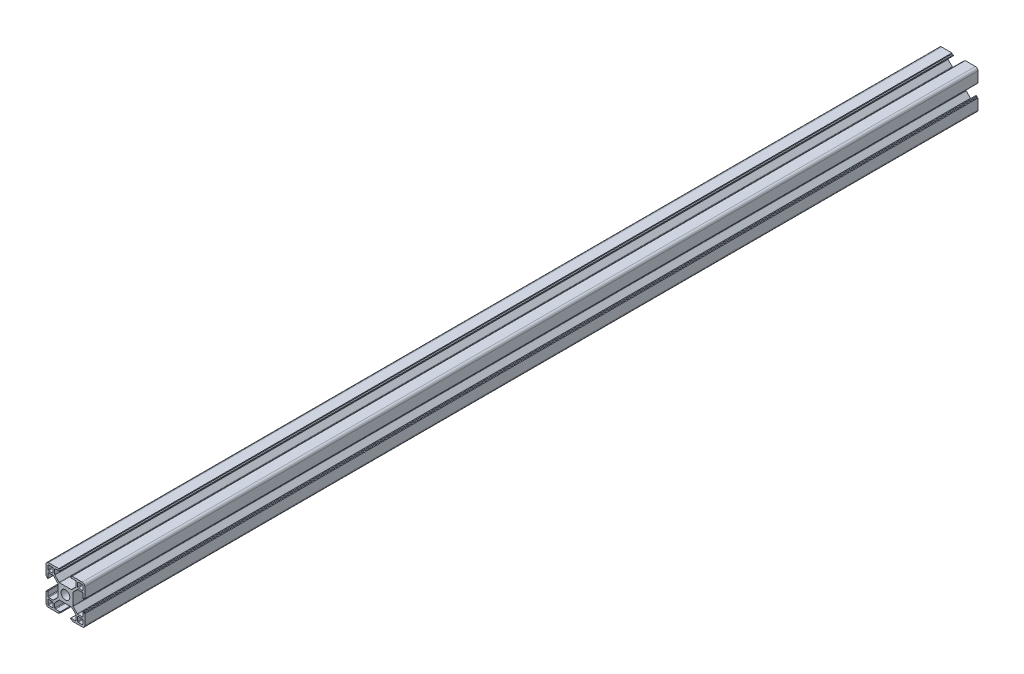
ISO-10303-21;
HEADER;
FILE_DESCRIPTION(('STEP AP214'),'2;1');
FILE_NAME('part.step','',(''),(''),'','','');
FILE_SCHEMA(('AUTOMOTIVE_DESIGN { 1 0 10303 214 1 1 1 1 }'));
ENDSEC;
DATA;
#1=APPLICATION_CONTEXT('core data for automotive mechanical design processes');
#2=APPLICATION_PROTOCOL_DEFINITION('international standard','automotive_design',2000,#1);
#3=PRODUCT_CONTEXT('',#1,'mechanical');
#4=PRODUCT('Part','Part','',(#3));
#5=PRODUCT_RELATED_PRODUCT_CATEGORY('part','',(#4));
#6=PRODUCT_DEFINITION_FORMATION('','',#4);
#7=PRODUCT_DEFINITION_CONTEXT('part definition',#1,'design');
#8=PRODUCT_DEFINITION('design','',#6,#7);
#9=PRODUCT_DEFINITION_SHAPE('','',#8);
#10=(LENGTH_UNIT() NAMED_UNIT(*) SI_UNIT(.MILLI.,.METRE.));
#11=(NAMED_UNIT(*) PLANE_ANGLE_UNIT() SI_UNIT($,.RADIAN.));
#12=(NAMED_UNIT(*) SI_UNIT($,.STERADIAN.) SOLID_ANGLE_UNIT());
#13=UNCERTAINTY_MEASURE_WITH_UNIT(LENGTH_MEASURE(1.E-05),#10,'distance_accuracy_value','');
#14=(GEOMETRIC_REPRESENTATION_CONTEXT(3) GLOBAL_UNCERTAINTY_ASSIGNED_CONTEXT((#13)) GLOBAL_UNIT_ASSIGNED_CONTEXT((#10,
#11,#12)) REPRESENTATION_CONTEXT('',''));
#15=CARTESIAN_POINT('',(0.,0.,0.));
#16=DIRECTION('',(0.,0.,1.));
#17=DIRECTION('',(1.,0.,0.));
#18=AXIS2_PLACEMENT_3D('',#15,#16,#17);
#19=CARTESIAN_POINT('',(19.0797659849,0.689378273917,0.));
#20=DIRECTION('',(0.,-1.,0.));
#21=DIRECTION('',(1.,0.,0.));
#22=AXIS2_PLACEMENT_3D('',#19,#20,#21);
#23=PLANE('',#22);
#24=DIRECTION('',(0.,0.,1.));
#25=VECTOR('',#24,1.);
#26=CARTESIAN_POINT('',(9.87976598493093,0.689378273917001,0.));
#27=LINE('',#26,#25);
#28=CARTESIAN_POINT('',(9.87976598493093,0.689378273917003,-170.));
#29=VERTEX_POINT('',#28);
#30=CARTESIAN_POINT('',(9.87976598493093,0.689378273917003,520.));
#31=VERTEX_POINT('',#30);
#32=EDGE_CURVE('E763',#29,#31,#27,.T.);
#33=ORIENTED_EDGE('',*,*,#32,.F.);
#34=DIRECTION('',(1.,0.,0.));
#35=VECTOR('',#34,1.);
#36=CARTESIAN_POINT('',(19.0797659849,0.689378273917,-170.));
#37=LINE('',#36,#35);
#38=CARTESIAN_POINT('',(10.8797659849,0.689378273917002,-170.));
#39=VERTEX_POINT('',#38);
#40=EDGE_CURVE('E47',#29,#39,#37,.T.);
#41=ORIENTED_EDGE('',*,*,#40,.T.);
#42=DIRECTION('',(0.,0.,-1.));
#43=VECTOR('',#42,1.);
#44=CARTESIAN_POINT('',(10.8797659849,0.689378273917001,0.));
#45=LINE('',#44,#43);
#46=CARTESIAN_POINT('',(10.8797659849,0.689378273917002,520.));
#47=VERTEX_POINT('',#46);
#48=EDGE_CURVE('E760',#47,#39,#45,.T.);
#49=ORIENTED_EDGE('',*,*,#48,.F.);
#50=DIRECTION('',(1.,0.,0.));
#51=VECTOR('',#50,1.);
#52=CARTESIAN_POINT('',(9.87976598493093,0.689378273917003,520.));
#53=LINE('',#52,#51);
#54=EDGE_CURVE('E1260',#31,#47,#53,.T.);
#55=ORIENTED_EDGE('',*,*,#54,.F.);
#56=EDGE_LOOP('',(#33,#41,#49,#55));
#57=FACE_BOUND('',#56,.T.);
#58=ADVANCED_FACE('F44',(#57),#23,.T.);
#59=CARTESIAN_POINT('',(19.0797659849,0.689378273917,0.));
#60=DIRECTION('',(0.,-1.,0.));
#61=DIRECTION('',(1.,0.,0.));
#62=AXIS2_PLACEMENT_3D('',#59,#60,#61);
#63=PLANE('',#62);
#64=DIRECTION('',(0.,0.,1.));
#65=VECTOR('',#64,1.);
#66=CARTESIAN_POINT('',(19.0797659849,0.689378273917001,0.));
#67=LINE('',#66,#65);
#68=CARTESIAN_POINT('',(19.0797659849,0.689378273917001,-170.));
#69=VERTEX_POINT('',#68);
#70=CARTESIAN_POINT('',(19.0797659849,0.689378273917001,520.));
#71=VERTEX_POINT('',#70);
#72=EDGE_CURVE('E745',#69,#71,#67,.T.);
#73=ORIENTED_EDGE('',*,*,#72,.F.);
#74=DIRECTION('',(1.,0.,0.));
#75=VECTOR('',#74,1.);
#76=CARTESIAN_POINT('',(19.0797659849,0.689378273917,-170.));
#77=LINE('',#76,#75);
#78=CARTESIAN_POINT('',(20.0797659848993,0.689378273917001,-170.));
#79=VERTEX_POINT('',#78);
#80=EDGE_CURVE('E775',#69,#79,#77,.T.);
#81=ORIENTED_EDGE('',*,*,#80,.T.);
#82=DIRECTION('',(0.,0.,1.));
#83=VECTOR('',#82,1.);
#84=CARTESIAN_POINT('',(20.0797659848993,0.689378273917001,0.));
#85=LINE('',#84,#83);
#86=CARTESIAN_POINT('',(20.0797659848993,0.689378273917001,520.));
#87=VERTEX_POINT('',#86);
#88=EDGE_CURVE('E741',#87,#79,#85,.F.);
#89=ORIENTED_EDGE('',*,*,#88,.F.);
#90=DIRECTION('',(1.,0.,0.));
#91=VECTOR('',#90,1.);
#92=CARTESIAN_POINT('',(19.0797659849,0.689378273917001,520.));
#93=LINE('',#92,#91);
#94=EDGE_CURVE('E1330',#71,#87,#93,.T.);
#95=ORIENTED_EDGE('',*,*,#94,.F.);
#96=EDGE_LOOP('',(#73,#81,#89,#95));
#97=FACE_BOUND('',#96,.T.);
#98=ADVANCED_FACE('F2144',(#97),#63,.T.);
#99=CARTESIAN_POINT('',(29.2297659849,19.0393782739,0.));
#100=DIRECTION('',(1.,0.,0.));
#101=DIRECTION('',(0.,0.,-1.));
#102=AXIS2_PLACEMENT_3D('',#99,#100,#101);
#103=PLANE('',#102);
#104=DIRECTION('',(0.,0.,1.));
#105=VECTOR('',#104,1.);
#106=CARTESIAN_POINT('',(29.2297659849,9.83937827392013,0.));
#107=LINE('',#106,#105);
#108=CARTESIAN_POINT('',(29.2297659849,9.83937827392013,-170.));
#109=VERTEX_POINT('',#108);
#110=CARTESIAN_POINT('',(29.2297659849,9.83937827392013,520.));
#111=VERTEX_POINT('',#110);
#112=EDGE_CURVE('E738',#109,#111,#107,.T.);
#113=ORIENTED_EDGE('',*,*,#112,.F.);
#114=DIRECTION('',(0.,1.,0.));
#115=VECTOR('',#114,1.);
#116=CARTESIAN_POINT('',(29.2297659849,19.0393782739,-170.));
#117=LINE('',#116,#115);
#118=CARTESIAN_POINT('',(29.2297659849,10.8393782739,-170.));
#119=VERTEX_POINT('',#118);
#120=EDGE_CURVE('E774',#109,#119,#117,.T.);
#121=ORIENTED_EDGE('',*,*,#120,.T.);
#122=DIRECTION('',(0.,0.,1.));
#123=VECTOR('',#122,1.);
#124=CARTESIAN_POINT('',(29.2297659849,10.8393782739,0.));
#125=LINE('',#124,#123);
#126=CARTESIAN_POINT('',(29.2297659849,10.8393782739,520.));
#127=VERTEX_POINT('',#126);
#128=EDGE_CURVE('E734',#127,#119,#125,.F.);
#129=ORIENTED_EDGE('',*,*,#128,.F.);
#130=DIRECTION('',(0.,1.,0.));
#131=VECTOR('',#130,1.);
#132=CARTESIAN_POINT('',(29.2297659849,9.83937827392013,520.));
#133=LINE('',#132,#131);
#134=EDGE_CURVE('E1354',#111,#127,#133,.T.);
#135=ORIENTED_EDGE('',*,*,#134,.F.);
#136=EDGE_LOOP('',(#113,#121,#129,#135));
#137=FACE_BOUND('',#136,.T.);
#138=ADVANCED_FACE('F2148',(#137),#103,.T.);
#139=CARTESIAN_POINT('',(29.2297659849,19.0393782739,0.));
#140=DIRECTION('',(1.,0.,0.));
#141=DIRECTION('',(0.,0.,-1.));
#142=AXIS2_PLACEMENT_3D('',#139,#140,#141);
#143=PLANE('',#142);
#144=DIRECTION('',(0.,0.,-1.));
#145=VECTOR('',#144,1.);
#146=CARTESIAN_POINT('',(29.2297659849,19.0393782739,0.));
#147=LINE('',#146,#145);
#148=CARTESIAN_POINT('',(29.2297659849,19.0393782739,-170.));
#149=VERTEX_POINT('',#148);
#150=CARTESIAN_POINT('',(29.2297659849,19.0393782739,520.));
#151=VERTEX_POINT('',#150);
#152=EDGE_CURVE('E719',#149,#151,#147,.F.);
#153=ORIENTED_EDGE('',*,*,#152,.F.);
#154=DIRECTION('',(0.,1.,0.));
#155=VECTOR('',#154,1.);
#156=CARTESIAN_POINT('',(29.2297659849,19.0393782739,-170.));
#157=LINE('',#156,#155);
#158=CARTESIAN_POINT('',(29.2297659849,20.0393782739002,-170.));
#159=VERTEX_POINT('',#158);
#160=EDGE_CURVE('E772',#149,#159,#157,.T.);
#161=ORIENTED_EDGE('',*,*,#160,.T.);
#162=DIRECTION('',(0.,0.,1.));
#163=VECTOR('',#162,1.);
#164=CARTESIAN_POINT('',(29.2297659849,20.0393782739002,0.));
#165=LINE('',#164,#163);
#166=CARTESIAN_POINT('',(29.2297659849,20.0393782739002,520.));
#167=VERTEX_POINT('',#166);
#168=EDGE_CURVE('E715',#167,#159,#165,.F.);
#169=ORIENTED_EDGE('',*,*,#168,.F.);
#170=DIRECTION('',(0.,1.,0.));
#171=VECTOR('',#170,1.);
#172=CARTESIAN_POINT('',(29.2297659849,19.0393782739,520.));
#173=LINE('',#172,#171);
#174=EDGE_CURVE('E1418',#151,#167,#173,.T.);
#175=ORIENTED_EDGE('',*,*,#174,.F.);
#176=EDGE_LOOP('',(#153,#161,#169,#175));
#177=FACE_BOUND('',#176,.T.);
#178=ADVANCED_FACE('F2152',(#177),#143,.T.);
#179=CARTESIAN_POINT('',(10.8797659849,29.1893782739,0.));
#180=DIRECTION('',(0.,1.,0.));
#181=DIRECTION('',(0.,0.,1.));
#182=AXIS2_PLACEMENT_3D('',#179,#180,#181);
#183=PLANE('',#182);
#184=DIRECTION('',(0.,0.,1.));
#185=VECTOR('',#184,1.);
#186=CARTESIAN_POINT('',(20.0797659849,29.1893782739,0.));
#187=LINE('',#186,#185);
#188=CARTESIAN_POINT('',(20.0797659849,29.1893782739,-170.));
#189=VERTEX_POINT('',#188);
#190=CARTESIAN_POINT('',(20.0797659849,29.1893782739,520.));
#191=VERTEX_POINT('',#190);
#192=EDGE_CURVE('E712',#189,#191,#187,.T.);
#193=ORIENTED_EDGE('',*,*,#192,.F.);
#194=DIRECTION('',(1.,0.,0.));
#195=VECTOR('',#194,1.);
#196=CARTESIAN_POINT('',(10.8797659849,29.1893782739,-170.));
#197=LINE('',#196,#195);
#198=CARTESIAN_POINT('',(19.0797659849,29.1893782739,-170.));
#199=VERTEX_POINT('',#198);
#200=EDGE_CURVE('E770',#189,#199,#197,.F.);
#201=ORIENTED_EDGE('',*,*,#200,.T.);
#202=DIRECTION('',(0.,0.,1.));
#203=VECTOR('',#202,1.);
#204=CARTESIAN_POINT('',(19.0797659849,29.1893782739,0.));
#205=LINE('',#204,#203);
#206=CARTESIAN_POINT('',(19.0797659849,29.1893782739,520.));
#207=VERTEX_POINT('',#206);
#208=EDGE_CURVE('E708',#207,#199,#205,.F.);
#209=ORIENTED_EDGE('',*,*,#208,.F.);
#210=DIRECTION('',(-1.,0.,0.));
#211=VECTOR('',#210,1.);
#212=CARTESIAN_POINT('',(20.0797659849,29.1893782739,520.));
#213=LINE('',#212,#211);
#214=EDGE_CURVE('E1442',#191,#207,#213,.T.);
#215=ORIENTED_EDGE('',*,*,#214,.F.);
#216=EDGE_LOOP('',(#193,#201,#209,#215));
#217=FACE_BOUND('',#216,.T.);
#218=ADVANCED_FACE('F2158',(#217),#183,.T.);
#219=CARTESIAN_POINT('',(10.8797659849,29.1893782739,0.));
#220=DIRECTION('',(0.,1.,0.));
#221=DIRECTION('',(0.,0.,1.));
#222=AXIS2_PLACEMENT_3D('',#219,#220,#221);
#223=PLANE('',#222);
#224=DIRECTION('',(0.,0.,-1.));
#225=VECTOR('',#224,1.);
#226=CARTESIAN_POINT('',(10.8797659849,29.1893782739,0.));
#227=LINE('',#226,#225);
#228=CARTESIAN_POINT('',(10.8797659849,29.1893782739,-170.));
#229=VERTEX_POINT('',#228);
#230=CARTESIAN_POINT('',(10.8797659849,29.1893782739,520.));
#231=VERTEX_POINT('',#230);
#232=EDGE_CURVE('E693',#229,#231,#227,.F.);
#233=ORIENTED_EDGE('',*,*,#232,.F.);
#234=DIRECTION('',(1.,0.,0.));
#235=VECTOR('',#234,1.);
#236=CARTESIAN_POINT('',(10.8797659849,29.1893782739,-170.));
#237=LINE('',#236,#235);
#238=CARTESIAN_POINT('',(9.87976598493,29.1893782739,-170.));
#239=VERTEX_POINT('',#238);
#240=EDGE_CURVE('E768',#229,#239,#237,.F.);
#241=ORIENTED_EDGE('',*,*,#240,.T.);
#242=DIRECTION('',(0.,0.,1.));
#243=VECTOR('',#242,1.);
#244=CARTESIAN_POINT('',(9.87976598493,29.1893782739,0.));
#245=LINE('',#244,#243);
#246=CARTESIAN_POINT('',(9.87976598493,29.1893782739,520.));
#247=VERTEX_POINT('',#246);
#248=EDGE_CURVE('E689',#247,#239,#245,.F.);
#249=ORIENTED_EDGE('',*,*,#248,.F.);
#250=DIRECTION('',(-1.,0.,0.));
#251=VECTOR('',#250,1.);
#252=CARTESIAN_POINT('',(10.8797659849,29.1893782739,520.));
#253=LINE('',#252,#251);
#254=EDGE_CURVE('E1506',#231,#247,#253,.T.);
#255=ORIENTED_EDGE('',*,*,#254,.F.);
#256=EDGE_LOOP('',(#233,#241,#249,#255));
#257=FACE_BOUND('',#256,.T.);
#258=ADVANCED_FACE('F2162',(#257),#223,.T.);
#259=CARTESIAN_POINT('',(0.729765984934,10.8393782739,0.));
#260=DIRECTION('',(-1.,0.,0.));
#261=DIRECTION('',(0.,0.,1.));
#262=AXIS2_PLACEMENT_3D('',#259,#260,#261);
#263=PLANE('',#262);
#264=DIRECTION('',(0.,0.,1.));
#265=VECTOR('',#264,1.);
#266=CARTESIAN_POINT('',(0.729765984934,20.0393782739,0.));
#267=LINE('',#266,#265);
#268=CARTESIAN_POINT('',(0.729765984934,20.0393782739,-170.));
#269=VERTEX_POINT('',#268);
#270=CARTESIAN_POINT('',(0.729765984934,20.0393782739,520.));
#271=VERTEX_POINT('',#270);
#272=EDGE_CURVE('E686',#269,#271,#267,.T.);
#273=ORIENTED_EDGE('',*,*,#272,.F.);
#274=DIRECTION('',(0.,1.,0.));
#275=VECTOR('',#274,1.);
#276=CARTESIAN_POINT('',(0.729765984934,10.8393782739,-170.));
#277=LINE('',#276,#275);
#278=CARTESIAN_POINT('',(0.729765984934,19.0393782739,-170.));
#279=VERTEX_POINT('',#278);
#280=EDGE_CURVE('E766',#269,#279,#277,.F.);
#281=ORIENTED_EDGE('',*,*,#280,.T.);
#282=DIRECTION('',(0.,0.,-1.));
#283=VECTOR('',#282,1.);
#284=CARTESIAN_POINT('',(0.729765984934,19.0393782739,0.));
#285=LINE('',#284,#283);
#286=CARTESIAN_POINT('',(0.729765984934,19.0393782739,520.));
#287=VERTEX_POINT('',#286);
#288=EDGE_CURVE('E682',#287,#279,#285,.T.);
#289=ORIENTED_EDGE('',*,*,#288,.F.);
#290=DIRECTION('',(0.,-1.,0.));
#291=VECTOR('',#290,1.);
#292=CARTESIAN_POINT('',(0.729765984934,20.0393782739,520.));
#293=LINE('',#292,#291);
#294=EDGE_CURVE('E1530',#271,#287,#293,.T.);
#295=ORIENTED_EDGE('',*,*,#294,.F.);
#296=EDGE_LOOP('',(#273,#281,#289,#295));
#297=FACE_BOUND('',#296,.T.);
#298=ADVANCED_FACE('F2166',(#297),#263,.T.);
#299=CARTESIAN_POINT('',(0.729765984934,10.8393782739,0.));
#300=DIRECTION('',(-1.,0.,0.));
#301=DIRECTION('',(0.,0.,1.));
#302=AXIS2_PLACEMENT_3D('',#299,#300,#301);
#303=PLANE('',#302);
#304=DIRECTION('',(0.,0.,1.));
#305=VECTOR('',#304,1.);
#306=CARTESIAN_POINT('',(0.729765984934,10.8393782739,0.));
#307=LINE('',#306,#305);
#308=CARTESIAN_POINT('',(0.729765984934,10.8393782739,-170.));
#309=VERTEX_POINT('',#308);
#310=CARTESIAN_POINT('',(0.729765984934,10.8393782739,520.));
#311=VERTEX_POINT('',#310);
#312=EDGE_CURVE('E667',#309,#311,#307,.T.);
#313=ORIENTED_EDGE('',*,*,#312,.F.);
#314=DIRECTION('',(0.,1.,0.));
#315=VECTOR('',#314,1.);
#316=CARTESIAN_POINT('',(0.729765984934,10.8393782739,-170.));
#317=LINE('',#316,#315);
#318=CARTESIAN_POINT('',(0.729765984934,9.83937827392,-170.));
#319=VERTEX_POINT('',#318);
#320=EDGE_CURVE('E764',#309,#319,#317,.F.);
#321=ORIENTED_EDGE('',*,*,#320,.T.);
#322=DIRECTION('',(0.,0.,1.));
#323=VECTOR('',#322,1.);
#324=CARTESIAN_POINT('',(0.729765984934,9.83937827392,0.));
#325=LINE('',#324,#323);
#326=CARTESIAN_POINT('',(0.729765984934,9.83937827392,520.));
#327=VERTEX_POINT('',#326);
#328=EDGE_CURVE('E663',#327,#319,#325,.F.);
#329=ORIENTED_EDGE('',*,*,#328,.F.);
#330=DIRECTION('',(0.,-1.,0.));
#331=VECTOR('',#330,1.);
#332=CARTESIAN_POINT('',(0.729765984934,10.8393782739,520.));
#333=LINE('',#332,#331);
#334=EDGE_CURVE('E780',#311,#327,#333,.T.);
#335=ORIENTED_EDGE('',*,*,#334,.F.);
#336=EDGE_LOOP('',(#313,#321,#329,#335));
#337=FACE_BOUND('',#336,.T.);
#338=ADVANCED_FACE('F1603',(#337),#303,.T.);
#339=CARTESIAN_POINT('',(9.87976598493,29.1893782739,0.));
#340=DIRECTION('',(1.,0.,0.));
#341=DIRECTION('',(0.,1.,0.));
#342=AXIS2_PLACEMENT_3D('',#339,#340,#341);
#343=PLANE('',#342);
#344=DIRECTION('',(0.,0.,-1.));
#345=VECTOR('',#344,1.);
#346=CARTESIAN_POINT('',(9.87976598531,-0.0606217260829,0.));
#347=LINE('',#346,#345);
#348=CARTESIAN_POINT('',(9.87976598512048,-0.0606217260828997,-170.));
#349=VERTEX_POINT('',#348);
#350=CARTESIAN_POINT('',(9.87976598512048,-0.0606217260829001,520.));
#351=VERTEX_POINT('',#350);
#352=EDGE_CURVE('E448',#349,#351,#347,.F.);
#353=ORIENTED_EDGE('',*,*,#352,.F.);
#354=DIRECTION('',(0.,1.,0.));
#355=VECTOR('',#354,1.);
#356=CARTESIAN_POINT('',(9.87976598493,29.1893782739,-170.));
#357=LINE('',#356,#355);
#358=EDGE_CURVE('E761',#349,#29,#357,.T.);
#359=ORIENTED_EDGE('',*,*,#358,.T.);
#360=ORIENTED_EDGE('',*,*,#32,.T.);
#361=DIRECTION('',(-2.52733019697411E-10,1.,0.));
#362=VECTOR('',#361,1.);
#363=CARTESIAN_POINT('',(9.87976598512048,-0.0606217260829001,520.));
#364=LINE('',#363,#362);
#365=EDGE_CURVE('E1250',#351,#31,#364,.T.);
#366=ORIENTED_EDGE('',*,*,#365,.F.);
#367=EDGE_LOOP('',(#353,#359,#360,#366));
#368=FACE_BOUND('',#367,.T.);
#369=ADVANCED_FACE('F1248',(#368),#343,.T.);
#370=CARTESIAN_POINT('',(10.8797659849,28.4393782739,0.));
#371=DIRECTION('',(1.,0.,0.));
#372=DIRECTION('',(0.,0.,-1.));
#373=AXIS2_PLACEMENT_3D('',#370,#371,#372);
#374=PLANE('',#373);
#375=ORIENTED_EDGE('',*,*,#48,.T.);
#376=DIRECTION('',(0.,1.,0.));
#377=VECTOR('',#376,1.);
#378=CARTESIAN_POINT('',(10.8797659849,28.4393782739,-170.));
#379=LINE('',#378,#377);
#380=CARTESIAN_POINT('',(10.8797659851,1.43937827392,-170.));
#381=VERTEX_POINT('',#380);
#382=EDGE_CURVE('E758',#39,#381,#379,.T.);
#383=ORIENTED_EDGE('',*,*,#382,.T.);
#384=DIRECTION('',(0.,0.,-1.));
#385=VECTOR('',#384,1.);
#386=CARTESIAN_POINT('',(10.8797659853,1.43937827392,0.));
#387=LINE('',#386,#385);
#388=CARTESIAN_POINT('',(10.8797659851,1.43937827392,520.));
#389=VERTEX_POINT('',#388);
#390=EDGE_CURVE('E1188',#381,#389,#387,.F.);
#391=ORIENTED_EDGE('',*,*,#390,.T.);
#392=DIRECTION('',(2.66666318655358E-10,1.,0.));
#393=VECTOR('',#392,1.);
#394=CARTESIAN_POINT('',(10.8797659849,0.689378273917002,520.));
#395=LINE('',#394,#393);
#396=EDGE_CURVE('E1268',#47,#389,#395,.T.);
#397=ORIENTED_EDGE('',*,*,#396,.F.);
#398=EDGE_LOOP('',(#375,#383,#391,#397));
#399=FACE_BOUND('',#398,.T.);
#400=ADVANCED_FACE('F2175',(#399),#374,.T.);
#401=CARTESIAN_POINT('',(7.22976598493,1.93937827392,0.));
#402=DIRECTION('',(0.,0.,1.));
#403=DIRECTION('',(1.,0.,0.));
#404=AXIS2_PLACEMENT_3D('',#401,#402,#403);
#405=CYLINDRICAL_SURFACE('',#404,0.5);
#406=DIRECTION('',(0.,0.,1.));
#407=VECTOR('',#406,1.);
#408=CARTESIAN_POINT('',(6.72976598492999,1.93937827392,0.));
#409=LINE('',#408,#407);
#410=CARTESIAN_POINT('',(6.72976598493,1.93937827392,520.));
#411=VERTEX_POINT('',#410);
#412=CARTESIAN_POINT('',(6.72976598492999,1.93937827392,-170.));
#413=VERTEX_POINT('',#412);
#414=EDGE_CURVE('E1176',#411,#413,#409,.F.);
#415=ORIENTED_EDGE('',*,*,#414,.F.);
#416=CARTESIAN_POINT('',(7.22976598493,1.93937827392,520.));
#417=DIRECTION('',(0.,0.,-1.));
#418=DIRECTION('',(1.,0.,0.));
#419=AXIS2_PLACEMENT_3D('',#416,#417,#418);
#420=CIRCLE('',#419,0.500000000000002);
#421=CARTESIAN_POINT('',(7.22976598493,1.43937827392,520.));
#422=VERTEX_POINT('',#421);
#423=EDGE_CURVE('E1278',#422,#411,#420,.T.);
#424=ORIENTED_EDGE('',*,*,#423,.F.);
#425=DIRECTION('',(0.,0.,-1.));
#426=VECTOR('',#425,1.);
#427=CARTESIAN_POINT('',(7.22976598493,1.43937827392,0.));
#428=LINE('',#427,#426);
#429=CARTESIAN_POINT('',(7.22976598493,1.43937827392,-170.));
#430=VERTEX_POINT('',#429);
#431=EDGE_CURVE('E1184',#422,#430,#428,.T.);
#432=ORIENTED_EDGE('',*,*,#431,.T.);
#433=CARTESIAN_POINT('',(7.22976598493,1.93937827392,-170.));
#434=DIRECTION('',(0.,0.,1.));
#435=DIRECTION('',(1.,0.,0.));
#436=AXIS2_PLACEMENT_3D('',#433,#434,#435);
#437=CIRCLE('',#436,0.5);
#438=EDGE_CURVE('E756',#413,#430,#437,.T.);
#439=ORIENTED_EDGE('',*,*,#438,.F.);
#440=EDGE_LOOP('',(#415,#424,#432,#439));
#441=FACE_BOUND('',#440,.T.);
#442=ADVANCED_FACE('F2178',(#441),#405,.F.);
#443=CARTESIAN_POINT('',(7.22976598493,5.42161132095,0.));
#444=DIRECTION('',(0.,0.,1.));
#445=DIRECTION('',(1.,0.,0.));
#446=AXIS2_PLACEMENT_3D('',#443,#444,#445);
#447=CYLINDRICAL_SURFACE('',#446,0.5);
#448=DIRECTION('',(0.,0.,1.));
#449=VECTOR('',#448,1.);
#450=CARTESIAN_POINT('',(6.87621259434,5.77516471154,0.));
#451=LINE('',#450,#449);
#452=CARTESIAN_POINT('',(6.87621259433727,5.77516471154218,520.));
#453=VERTEX_POINT('',#452);
#454=CARTESIAN_POINT('',(6.87621259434,5.77516471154,-170.));
#455=VERTEX_POINT('',#454);
#456=EDGE_CURVE('E1168',#453,#455,#451,.F.);
#457=ORIENTED_EDGE('',*,*,#456,.F.);
#458=CARTESIAN_POINT('',(7.22976598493,5.42161132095,520.));
#459=DIRECTION('',(0.,0.,-1.));
#460=DIRECTION('',(1.,0.,0.));
#461=AXIS2_PLACEMENT_3D('',#458,#459,#460);
#462=CIRCLE('',#461,0.499999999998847);
#463=CARTESIAN_POINT('',(6.72976598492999,5.421611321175,520.));
#464=VERTEX_POINT('',#463);
#465=EDGE_CURVE('E1286',#464,#453,#462,.T.);
#466=ORIENTED_EDGE('',*,*,#465,.F.);
#467=DIRECTION('',(0.,0.,1.));
#468=VECTOR('',#467,1.);
#469=CARTESIAN_POINT('',(6.72976598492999,5.4216113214,0.));
#470=LINE('',#469,#468);
#471=CARTESIAN_POINT('',(6.72976598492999,5.421611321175,-170.));
#472=VERTEX_POINT('',#471);
#473=EDGE_CURVE('E1180',#472,#464,#470,.T.);
#474=ORIENTED_EDGE('',*,*,#473,.F.);
#475=CARTESIAN_POINT('',(7.22976598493,5.42161132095,-170.));
#476=DIRECTION('',(0.,0.,1.));
#477=DIRECTION('',(1.,0.,0.));
#478=AXIS2_PLACEMENT_3D('',#475,#476,#477);
#479=CIRCLE('',#478,0.5);
#480=EDGE_CURVE('E754',#455,#472,#479,.T.);
#481=ORIENTED_EDGE('',*,*,#480,.F.);
#482=EDGE_LOOP('',(#457,#466,#474,#481));
#483=FACE_BOUND('',#482,.T.);
#484=ADVANCED_FACE('F2182',(#483),#447,.F.);
#485=CARTESIAN_POINT('',(10.4475329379,8.63937827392,0.));
#486=DIRECTION('',(0.,0.,1.));
#487=DIRECTION('',(1.,0.,0.));
#488=AXIS2_PLACEMENT_3D('',#485,#486,#487);
#489=CYLINDRICAL_SURFACE('',#488,0.5);
#490=DIRECTION('',(0.,0.,1.));
#491=VECTOR('',#490,1.);
#492=CARTESIAN_POINT('',(10.4475329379,9.13937827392,0.));
#493=LINE('',#492,#491);
#494=CARTESIAN_POINT('',(10.4475329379,9.13937827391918,520.));
#495=VERTEX_POINT('',#494);
#496=CARTESIAN_POINT('',(10.4475329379,9.13937827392,-170.));
#497=VERTEX_POINT('',#496);
#498=EDGE_CURVE('E1160',#495,#497,#493,.F.);
#499=ORIENTED_EDGE('',*,*,#498,.F.);
#500=CARTESIAN_POINT('',(10.4475329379,8.63937827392,520.));
#501=DIRECTION('',(0.,0.,-1.));
#502=DIRECTION('',(1.,0.,0.));
#503=AXIS2_PLACEMENT_3D('',#500,#501,#502);
#504=CIRCLE('',#503,0.499999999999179);
#505=CARTESIAN_POINT('',(10.0939795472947,8.99293166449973,520.));
#506=VERTEX_POINT('',#505);
#507=EDGE_CURVE('E1294',#506,#495,#504,.T.);
#508=ORIENTED_EDGE('',*,*,#507,.F.);
#509=DIRECTION('',(0.,0.,1.));
#510=VECTOR('',#509,1.);
#511=CARTESIAN_POINT('',(10.093979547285,8.992931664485,0.));
#512=LINE('',#511,#510);
#513=CARTESIAN_POINT('',(10.0939795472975,8.9929316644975,-170.));
#514=VERTEX_POINT('',#513);
#515=EDGE_CURVE('E1172',#514,#506,#512,.T.);
#516=ORIENTED_EDGE('',*,*,#515,.F.);
#517=CARTESIAN_POINT('',(10.4475329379,8.63937827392,-170.));
#518=DIRECTION('',(0.,0.,1.));
#519=DIRECTION('',(1.,0.,0.));
#520=AXIS2_PLACEMENT_3D('',#517,#518,#519);
#521=CIRCLE('',#520,0.5);
#522=EDGE_CURVE('E752',#497,#514,#521,.T.);
#523=ORIENTED_EDGE('',*,*,#522,.F.);
#524=EDGE_LOOP('',(#499,#508,#516,#523));
#525=FACE_BOUND('',#524,.T.);
#526=ADVANCED_FACE('F2186',(#525),#489,.F.);
#527=CARTESIAN_POINT('',(19.511999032,8.63937827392,0.));
#528=DIRECTION('',(0.,0.,1.));
#529=DIRECTION('',(1.,0.,0.));
#530=AXIS2_PLACEMENT_3D('',#527,#528,#529);
#531=CYLINDRICAL_SURFACE('',#530,0.5);
#532=DIRECTION('',(0.,0.,1.));
#533=VECTOR('',#532,1.);
#534=CARTESIAN_POINT('',(19.865552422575,8.992931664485,0.));
#535=LINE('',#534,#533);
#536=CARTESIAN_POINT('',(19.865552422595,8.99293166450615,520.));
#537=VERTEX_POINT('',#536);
#538=CARTESIAN_POINT('',(19.8655524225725,8.9929316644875,-170.));
#539=VERTEX_POINT('',#538);
#540=EDGE_CURVE('E1152',#537,#539,#535,.F.);
#541=ORIENTED_EDGE('',*,*,#540,.F.);
#542=CARTESIAN_POINT('',(19.511999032,8.63937827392,520.));
#543=DIRECTION('',(0.,0.,-1.));
#544=DIRECTION('',(1.,0.,0.));
#545=AXIS2_PLACEMENT_3D('',#542,#543,#544);
#546=CIRCLE('',#545,0.499999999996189);
#547=CARTESIAN_POINT('',(19.51199903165,9.13937827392,520.));
#548=VERTEX_POINT('',#547);
#549=EDGE_CURVE('E1302',#548,#537,#546,.T.);
#550=ORIENTED_EDGE('',*,*,#549,.F.);
#551=DIRECTION('',(0.,0.,1.));
#552=VECTOR('',#551,1.);
#553=CARTESIAN_POINT('',(19.5119990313,9.13937827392,0.));
#554=LINE('',#553,#552);
#555=CARTESIAN_POINT('',(19.51199903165,9.13937827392,-170.));
#556=VERTEX_POINT('',#555);
#557=EDGE_CURVE('E1164',#556,#548,#554,.T.);
#558=ORIENTED_EDGE('',*,*,#557,.F.);
#559=CARTESIAN_POINT('',(19.511999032,8.63937827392,-170.));
#560=DIRECTION('',(0.,0.,1.));
#561=DIRECTION('',(1.,0.,0.));
#562=AXIS2_PLACEMENT_3D('',#559,#560,#561);
#563=CIRCLE('',#562,0.5);
#564=EDGE_CURVE('E750',#539,#556,#563,.T.);
#565=ORIENTED_EDGE('',*,*,#564,.F.);
#566=EDGE_LOOP('',(#541,#550,#558,#565));
#567=FACE_BOUND('',#566,.T.);
#568=ADVANCED_FACE('F2190',(#567),#531,.F.);
#569=CARTESIAN_POINT('',(22.7297659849,5.42161132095,0.));
#570=DIRECTION('',(0.,0.,1.));
#571=DIRECTION('',(1.,0.,0.));
#572=AXIS2_PLACEMENT_3D('',#569,#570,#571);
#573=CYLINDRICAL_SURFACE('',#572,0.5);
#574=DIRECTION('',(0.,0.,1.));
#575=VECTOR('',#574,1.);
#576=CARTESIAN_POINT('',(23.2297659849,5.42161132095,0.));
#577=LINE('',#576,#575);
#578=CARTESIAN_POINT('',(23.2297659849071,5.42161132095,520.));
#579=VERTEX_POINT('',#578);
#580=CARTESIAN_POINT('',(23.2297659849,5.42161132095,-170.));
#581=VERTEX_POINT('',#580);
#582=EDGE_CURVE('E1144',#579,#581,#577,.F.);
#583=ORIENTED_EDGE('',*,*,#582,.F.);
#584=CARTESIAN_POINT('',(22.7297659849,5.42161132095,520.));
#585=DIRECTION('',(0.,0.,-1.));
#586=DIRECTION('',(1.,0.,0.));
#587=AXIS2_PLACEMENT_3D('',#584,#585,#586);
#588=CIRCLE('',#587,0.500000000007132);
#589=CARTESIAN_POINT('',(23.0833193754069,5.77516471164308,520.));
#590=VERTEX_POINT('',#589);
#591=EDGE_CURVE('E1310',#590,#579,#588,.T.);
#592=ORIENTED_EDGE('',*,*,#591,.F.);
#593=DIRECTION('',(0.,0.,1.));
#594=VECTOR('',#593,1.);
#595=CARTESIAN_POINT('',(23.083319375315,5.775164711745,0.));
#596=LINE('',#595,#594);
#597=CARTESIAN_POINT('',(23.08331937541,5.77516471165,-170.));
#598=VERTEX_POINT('',#597);
#599=EDGE_CURVE('E1156',#598,#590,#596,.T.);
#600=ORIENTED_EDGE('',*,*,#599,.F.);
#601=CARTESIAN_POINT('',(22.7297659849,5.42161132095,-170.));
#602=DIRECTION('',(0.,0.,1.));
#603=DIRECTION('',(1.,0.,0.));
#604=AXIS2_PLACEMENT_3D('',#601,#602,#603);
#605=CIRCLE('',#604,0.5);
#606=EDGE_CURVE('E748',#581,#598,#605,.T.);
#607=ORIENTED_EDGE('',*,*,#606,.F.);
#608=EDGE_LOOP('',(#583,#592,#600,#607));
#609=FACE_BOUND('',#608,.T.);
#610=ADVANCED_FACE('F2194',(#609),#573,.F.);
#611=CARTESIAN_POINT('',(22.7297659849,1.93937827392,0.));
#612=DIRECTION('',(0.,0.,1.));
#613=DIRECTION('',(1.,0.,0.));
#614=AXIS2_PLACEMENT_3D('',#611,#612,#613);
#615=CYLINDRICAL_SURFACE('',#614,0.5);
#616=DIRECTION('',(0.,0.,-1.));
#617=VECTOR('',#616,1.);
#618=CARTESIAN_POINT('',(22.7297659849,1.43937827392,0.));
#619=LINE('',#618,#617);
#620=CARTESIAN_POINT('',(22.7297659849,1.43937827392,-170.));
#621=VERTEX_POINT('',#620);
#622=CARTESIAN_POINT('',(22.7297659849,1.43937827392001,520.));
#623=VERTEX_POINT('',#622);
#624=EDGE_CURVE('E1140',#621,#623,#619,.F.);
#625=ORIENTED_EDGE('',*,*,#624,.T.);
#626=CARTESIAN_POINT('',(22.7297659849,1.93937827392,520.));
#627=DIRECTION('',(0.,0.,-1.));
#628=DIRECTION('',(1.,0.,0.));
#629=AXIS2_PLACEMENT_3D('',#626,#627,#628);
#630=CIRCLE('',#629,0.499999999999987);
#631=CARTESIAN_POINT('',(23.2297659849,1.93937827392,520.));
#632=VERTEX_POINT('',#631);
#633=EDGE_CURVE('E1318',#632,#623,#630,.T.);
#634=ORIENTED_EDGE('',*,*,#633,.F.);
#635=DIRECTION('',(0.,0.,1.));
#636=VECTOR('',#635,1.);
#637=CARTESIAN_POINT('',(23.2297659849,1.93937827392,0.));
#638=LINE('',#637,#636);
#639=CARTESIAN_POINT('',(23.2297659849,1.93937827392,-170.));
#640=VERTEX_POINT('',#639);
#641=EDGE_CURVE('E1148',#640,#632,#638,.T.);
#642=ORIENTED_EDGE('',*,*,#641,.F.);
#643=CARTESIAN_POINT('',(22.7297659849,1.93937827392,-170.));
#644=DIRECTION('',(0.,0.,1.));
#645=DIRECTION('',(1.,0.,0.));
#646=AXIS2_PLACEMENT_3D('',#643,#644,#645);
#647=CIRCLE('',#646,0.5);
#648=EDGE_CURVE('E746',#621,#640,#647,.T.);
#649=ORIENTED_EDGE('',*,*,#648,.F.);
#650=EDGE_LOOP('',(#625,#634,#642,#649));
#651=FACE_BOUND('',#650,.T.);
#652=ADVANCED_FACE('F2198',(#651),#615,.F.);
#653=CARTESIAN_POINT('',(19.0797659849,29.1893782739,0.));
#654=DIRECTION('',(-1.,0.,0.));
#655=DIRECTION('',(0.,0.,1.));
#656=AXIS2_PLACEMENT_3D('',#653,#654,#655);
#657=PLANE('',#656);
#658=DIRECTION('',(0.,0.,-1.));
#659=VECTOR('',#658,1.);
#660=CARTESIAN_POINT('',(19.0797659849,1.43937827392,0.));
#661=LINE('',#660,#659);
#662=CARTESIAN_POINT('',(19.0797659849,1.43937827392,520.));
#663=VERTEX_POINT('',#662);
#664=CARTESIAN_POINT('',(19.0797659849,1.43937827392,-170.));
#665=VERTEX_POINT('',#664);
#666=EDGE_CURVE('E1139',#663,#665,#661,.T.);
#667=ORIENTED_EDGE('',*,*,#666,.T.);
#668=DIRECTION('',(0.,1.,0.));
#669=VECTOR('',#668,1.);
#670=CARTESIAN_POINT('',(19.0797659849,29.1893782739,-170.));
#671=LINE('',#670,#669);
#672=EDGE_CURVE('E742',#665,#69,#671,.F.);
#673=ORIENTED_EDGE('',*,*,#672,.T.);
#674=ORIENTED_EDGE('',*,*,#72,.T.);
#675=DIRECTION('',(0.,-1.,0.));
#676=VECTOR('',#675,1.);
#677=CARTESIAN_POINT('',(19.0797659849,1.43937827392,520.));
#678=LINE('',#677,#676);
#679=EDGE_CURVE('E1326',#663,#71,#678,.T.);
#680=ORIENTED_EDGE('',*,*,#679,.F.);
#681=EDGE_LOOP('',(#667,#673,#674,#680));
#682=FACE_BOUND('',#681,.T.);
#683=ADVANCED_FACE('F2202',(#682),#657,.T.);
#684=CARTESIAN_POINT('',(20.0797659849,29.9393782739,0.));
#685=DIRECTION('',(-1.,0.,0.));
#686=DIRECTION('',(0.,-1.,0.));
#687=AXIS2_PLACEMENT_3D('',#684,#685,#686);
#688=PLANE('',#687);
#689=ORIENTED_EDGE('',*,*,#88,.T.);
#690=DIRECTION('',(0.,-1.,0.));
#691=VECTOR('',#690,1.);
#692=CARTESIAN_POINT('',(20.0797659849,29.9393782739,-170.));
#693=LINE('',#692,#691);
#694=CARTESIAN_POINT('',(20.0797659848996,-0.0606217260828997,-170.));
#695=VERTEX_POINT('',#694);
#696=EDGE_CURVE('E739',#79,#695,#693,.T.);
#697=ORIENTED_EDGE('',*,*,#696,.T.);
#698=DIRECTION('',(0.,0.,-1.));
#699=VECTOR('',#698,1.);
#700=CARTESIAN_POINT('',(20.0797659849,-0.0606217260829,0.));
#701=LINE('',#700,#699);
#702=CARTESIAN_POINT('',(20.0797659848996,-0.0606217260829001,520.));
#703=VERTEX_POINT('',#702);
#704=EDGE_CURVE('E1135',#703,#695,#701,.T.);
#705=ORIENTED_EDGE('',*,*,#704,.F.);
#706=DIRECTION('',(4.53341068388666E-13,-1.,0.));
#707=VECTOR('',#706,1.);
#708=CARTESIAN_POINT('',(20.0797659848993,0.689378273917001,520.));
#709=LINE('',#708,#707);
#710=EDGE_CURVE('E1334',#87,#703,#709,.T.);
#711=ORIENTED_EDGE('',*,*,#710,.F.);
#712=EDGE_LOOP('',(#689,#697,#705,#711));
#713=FACE_BOUND('',#712,.T.);
#714=ADVANCED_FACE('F2206',(#713),#688,.T.);
#715=CARTESIAN_POINT('',(0.729765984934,9.83937827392,0.));
#716=DIRECTION('',(0.,1.,0.));
#717=DIRECTION('',(-1.,0.,0.));
#718=AXIS2_PLACEMENT_3D('',#715,#716,#717);
#719=PLANE('',#718);
#720=DIRECTION('',(0.,0.,-1.));
#721=VECTOR('',#720,1.);
#722=CARTESIAN_POINT('',(29.9797659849,9.83937827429,0.));
#723=LINE('',#722,#721);
#724=CARTESIAN_POINT('',(29.9797659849,9.83937827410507,-170.));
#725=VERTEX_POINT('',#724);
#726=CARTESIAN_POINT('',(29.9797659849,9.83937827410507,520.));
#727=VERTEX_POINT('',#726);
#728=EDGE_CURVE('E1126',#725,#727,#723,.F.);
#729=ORIENTED_EDGE('',*,*,#728,.F.);
#730=DIRECTION('',(-1.,0.,0.));
#731=VECTOR('',#730,1.);
#732=CARTESIAN_POINT('',(0.729765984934,9.83937827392,-170.));
#733=LINE('',#732,#731);
#734=EDGE_CURVE('E735',#725,#109,#733,.T.);
#735=ORIENTED_EDGE('',*,*,#734,.T.);
#736=ORIENTED_EDGE('',*,*,#112,.T.);
#737=DIRECTION('',(-1.,-2.46585159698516E-10,0.));
#738=VECTOR('',#737,1.);
#739=CARTESIAN_POINT('',(29.9797659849,9.83937827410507,520.));
#740=LINE('',#739,#738);
#741=EDGE_CURVE('E1350',#727,#111,#740,.T.);
#742=ORIENTED_EDGE('',*,*,#741,.F.);
#743=EDGE_LOOP('',(#729,#735,#736,#742));
#744=FACE_BOUND('',#743,.T.);
#745=ADVANCED_FACE('F2210',(#744),#719,.T.);
#746=CARTESIAN_POINT('',(1.47976598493,10.8393782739,0.));
#747=DIRECTION('',(0.,1.,0.));
#748=DIRECTION('',(0.,0.,1.));
#749=AXIS2_PLACEMENT_3D('',#746,#747,#748);
#750=PLANE('',#749);
#751=ORIENTED_EDGE('',*,*,#128,.T.);
#752=DIRECTION('',(1.,0.,0.));
#753=VECTOR('',#752,1.);
#754=CARTESIAN_POINT('',(1.47976598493,10.8393782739,-170.));
#755=LINE('',#754,#753);
#756=CARTESIAN_POINT('',(28.4797659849,10.8393782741,-170.));
#757=VERTEX_POINT('',#756);
#758=EDGE_CURVE('E732',#119,#757,#755,.F.);
#759=ORIENTED_EDGE('',*,*,#758,.T.);
#760=DIRECTION('',(0.,0.,-1.));
#761=VECTOR('',#760,1.);
#762=CARTESIAN_POINT('',(28.4797659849,10.8393782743,0.));
#763=LINE('',#762,#761);
#764=CARTESIAN_POINT('',(28.4797659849,10.8393782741,520.));
#765=VERTEX_POINT('',#764);
#766=EDGE_CURVE('E1118',#757,#765,#763,.F.);
#767=ORIENTED_EDGE('',*,*,#766,.T.);
#768=DIRECTION('',(-1.,2.66666318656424E-10,0.));
#769=VECTOR('',#768,1.);
#770=CARTESIAN_POINT('',(29.2297659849,10.8393782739,520.));
#771=LINE('',#770,#769);
#772=EDGE_CURVE('E1358',#127,#765,#771,.T.);
#773=ORIENTED_EDGE('',*,*,#772,.F.);
#774=EDGE_LOOP('',(#751,#759,#767,#773));
#775=FACE_BOUND('',#774,.T.);
#776=ADVANCED_FACE('F2214',(#775),#750,.T.);
#777=CARTESIAN_POINT('',(27.9797659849,7.18937827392,0.));
#778=DIRECTION('',(0.,0.,1.));
#779=DIRECTION('',(1.,0.,0.));
#780=AXIS2_PLACEMENT_3D('',#777,#778,#779);
#781=CYLINDRICAL_SURFACE('',#780,0.5);
#782=DIRECTION('',(0.,0.,1.));
#783=VECTOR('',#782,1.);
#784=CARTESIAN_POINT('',(27.9797659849,6.68937827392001,0.));
#785=LINE('',#784,#783);
#786=CARTESIAN_POINT('',(27.9797659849,6.68937827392,520.));
#787=VERTEX_POINT('',#786);
#788=CARTESIAN_POINT('',(27.9797659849,6.68937827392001,-170.));
#789=VERTEX_POINT('',#788);
#790=EDGE_CURVE('E1106',#787,#789,#785,.F.);
#791=ORIENTED_EDGE('',*,*,#790,.F.);
#792=CARTESIAN_POINT('',(27.9797659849,7.18937827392,520.));
#793=DIRECTION('',(0.,0.,-1.));
#794=DIRECTION('',(1.,0.,0.));
#795=AXIS2_PLACEMENT_3D('',#792,#793,#794);
#796=CIRCLE('',#795,0.499999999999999);
#797=CARTESIAN_POINT('',(28.4797659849,7.18937827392,520.));
#798=VERTEX_POINT('',#797);
#799=EDGE_CURVE('E1366',#798,#787,#796,.T.);
#800=ORIENTED_EDGE('',*,*,#799,.F.);
#801=DIRECTION('',(0.,0.,-1.));
#802=VECTOR('',#801,1.);
#803=CARTESIAN_POINT('',(28.4797659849,7.18937827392,0.));
#804=LINE('',#803,#802);
#805=CARTESIAN_POINT('',(28.4797659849,7.18937827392,-170.));
#806=VERTEX_POINT('',#805);
#807=EDGE_CURVE('E1114',#798,#806,#804,.T.);
#808=ORIENTED_EDGE('',*,*,#807,.T.);
#809=CARTESIAN_POINT('',(27.9797659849,7.18937827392,-170.));
#810=DIRECTION('',(0.,0.,1.));
#811=DIRECTION('',(1.,0.,0.));
#812=AXIS2_PLACEMENT_3D('',#809,#810,#811);
#813=CIRCLE('',#812,0.5);
#814=EDGE_CURVE('E730',#789,#806,#813,.T.);
#815=ORIENTED_EDGE('',*,*,#814,.F.);
#816=EDGE_LOOP('',(#791,#800,#808,#815));
#817=FACE_BOUND('',#816,.T.);
#818=ADVANCED_FACE('F2218',(#817),#781,.F.);
#819=CARTESIAN_POINT('',(24.4975329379,7.18937827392,0.));
#820=DIRECTION('',(0.,0.,1.));
#821=DIRECTION('',(1.,0.,0.));
#822=AXIS2_PLACEMENT_3D('',#819,#820,#821);
#823=CYLINDRICAL_SURFACE('',#822,0.5);
#824=DIRECTION('',(0.,0.,1.));
#825=VECTOR('',#824,1.);
#826=CARTESIAN_POINT('',(24.14397954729,6.83582488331,0.));
#827=LINE('',#826,#825);
#828=CARTESIAN_POINT('',(24.1439795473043,6.83582488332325,520.));
#829=VERTEX_POINT('',#828);
#830=CARTESIAN_POINT('',(24.14397954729,6.83582488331,-170.));
#831=VERTEX_POINT('',#830);
#832=EDGE_CURVE('E1098',#829,#831,#827,.F.);
#833=ORIENTED_EDGE('',*,*,#832,.F.);
#834=CARTESIAN_POINT('',(24.4975329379,7.18937827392,520.));
#835=DIRECTION('',(0.,0.,-1.));
#836=DIRECTION('',(1.,0.,0.));
#837=AXIS2_PLACEMENT_3D('',#834,#835,#836);
#838=CIRCLE('',#837,0.500000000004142);
#839=CARTESIAN_POINT('',(24.49753293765,6.68937827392,520.));
#840=VERTEX_POINT('',#839);
#841=EDGE_CURVE('E1374',#840,#829,#838,.T.);
#842=ORIENTED_EDGE('',*,*,#841,.F.);
#843=DIRECTION('',(0.,0.,1.));
#844=VECTOR('',#843,1.);
#845=CARTESIAN_POINT('',(24.4975329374,6.68937827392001,0.));
#846=LINE('',#845,#844);
#847=CARTESIAN_POINT('',(24.49753293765,6.68937827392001,-170.));
#848=VERTEX_POINT('',#847);
#849=EDGE_CURVE('E1110',#848,#840,#846,.T.);
#850=ORIENTED_EDGE('',*,*,#849,.F.);
#851=CARTESIAN_POINT('',(24.4975329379,7.18937827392,-170.));
#852=DIRECTION('',(0.,0.,1.));
#853=DIRECTION('',(1.,0.,0.));
#854=AXIS2_PLACEMENT_3D('',#851,#852,#853);
#855=CIRCLE('',#854,0.5);
#856=EDGE_CURVE('E728',#831,#848,#855,.T.);
#857=ORIENTED_EDGE('',*,*,#856,.F.);
#858=EDGE_LOOP('',(#833,#842,#850,#857));
#859=FACE_BOUND('',#858,.T.);
#860=ADVANCED_FACE('F2222',(#859),#823,.F.);
#861=CARTESIAN_POINT('',(21.2797659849,10.4071452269,0.));
#862=DIRECTION('',(0.,0.,1.));
#863=DIRECTION('',(1.,0.,0.));
#864=AXIS2_PLACEMENT_3D('',#861,#862,#863);
#865=CYLINDRICAL_SURFACE('',#864,0.5);
#866=DIRECTION('',(0.,0.,-1.));
#867=VECTOR('',#866,1.);
#868=CARTESIAN_POINT('',(20.7797659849,10.4071452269,0.));
#869=LINE('',#868,#867);
#870=CARTESIAN_POINT('',(20.7797659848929,10.4071452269,520.));
#871=VERTEX_POINT('',#870);
#872=CARTESIAN_POINT('',(20.7797659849,10.4071452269,-170.));
#873=VERTEX_POINT('',#872);
#874=EDGE_CURVE('E1090',#871,#873,#869,.T.);
#875=ORIENTED_EDGE('',*,*,#874,.F.);
#876=CARTESIAN_POINT('',(21.2797659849,10.4071452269,520.));
#877=DIRECTION('',(0.,0.,-1.));
#878=DIRECTION('',(1.,0.,0.));
#879=AXIS2_PLACEMENT_3D('',#876,#877,#878);
#880=CIRCLE('',#879,0.500000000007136);
#881=CARTESIAN_POINT('',(20.9262125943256,10.0535918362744,520.));
#882=VERTEX_POINT('',#881);
#883=EDGE_CURVE('E1382',#882,#871,#880,.T.);
#884=ORIENTED_EDGE('',*,*,#883,.F.);
#885=DIRECTION('',(0.,0.,1.));
#886=VECTOR('',#885,1.);
#887=CARTESIAN_POINT('',(20.92621259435,10.05359183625,0.));
#888=LINE('',#887,#886);
#889=CARTESIAN_POINT('',(20.926212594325,10.053591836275,-170.));
#890=VERTEX_POINT('',#889);
#891=EDGE_CURVE('E1102',#890,#882,#888,.T.);
#892=ORIENTED_EDGE('',*,*,#891,.F.);
#893=CARTESIAN_POINT('',(21.2797659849,10.4071452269,-170.));
#894=DIRECTION('',(0.,0.,1.));
#895=DIRECTION('',(1.,0.,0.));
#896=AXIS2_PLACEMENT_3D('',#893,#894,#895);
#897=CIRCLE('',#896,0.5);
#898=EDGE_CURVE('E726',#873,#890,#897,.T.);
#899=ORIENTED_EDGE('',*,*,#898,.F.);
#900=EDGE_LOOP('',(#875,#884,#892,#899));
#901=FACE_BOUND('',#900,.T.);
#902=ADVANCED_FACE('F2226',(#901),#865,.F.);
#903=CARTESIAN_POINT('',(21.2797659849,19.471611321,0.));
#904=DIRECTION('',(0.,0.,1.));
#905=DIRECTION('',(1.,0.,0.));
#906=AXIS2_PLACEMENT_3D('',#903,#904,#905);
#907=CYLINDRICAL_SURFACE('',#906,0.5);
#908=DIRECTION('',(0.,0.,1.));
#909=VECTOR('',#908,1.);
#910=CARTESIAN_POINT('',(20.9262125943,19.8251647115,0.));
#911=LINE('',#910,#909);
#912=CARTESIAN_POINT('',(20.9262125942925,19.8251647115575,520.));
#913=VERTEX_POINT('',#912);
#914=CARTESIAN_POINT('',(20.926212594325,19.825164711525,-170.));
#915=VERTEX_POINT('',#914);
#916=EDGE_CURVE('E1082',#913,#915,#911,.F.);
#917=ORIENTED_EDGE('',*,*,#916,.F.);
#918=CARTESIAN_POINT('',(21.2797659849,19.471611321,520.));
#919=DIRECTION('',(0.,0.,-1.));
#920=DIRECTION('',(1.,0.,0.));
#921=AXIS2_PLACEMENT_3D('',#918,#919,#920);
#922=CIRCLE('',#921,0.499999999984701);
#923=CARTESIAN_POINT('',(20.7797659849,19.47161132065,520.));
#924=VERTEX_POINT('',#923);
#925=EDGE_CURVE('E1390',#924,#913,#922,.T.);
#926=ORIENTED_EDGE('',*,*,#925,.F.);
#927=DIRECTION('',(0.,0.,-1.));
#928=VECTOR('',#927,1.);
#929=CARTESIAN_POINT('',(20.7797659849,19.4716113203,0.));
#930=LINE('',#929,#928);
#931=CARTESIAN_POINT('',(20.7797659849,19.47161132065,-170.));
#932=VERTEX_POINT('',#931);
#933=EDGE_CURVE('E1094',#932,#924,#930,.F.);
#934=ORIENTED_EDGE('',*,*,#933,.F.);
#935=CARTESIAN_POINT('',(21.2797659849,19.471611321,-170.));
#936=DIRECTION('',(0.,0.,1.));
#937=DIRECTION('',(1.,0.,0.));
#938=AXIS2_PLACEMENT_3D('',#935,#936,#937);
#939=CIRCLE('',#938,0.5);
#940=EDGE_CURVE('E724',#915,#932,#939,.T.);
#941=ORIENTED_EDGE('',*,*,#940,.F.);
#942=EDGE_LOOP('',(#917,#926,#934,#941));
#943=FACE_BOUND('',#942,.T.);
#944=ADVANCED_FACE('F2230',(#943),#907,.F.);
#945=CARTESIAN_POINT('',(24.4975329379,22.6893782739,0.));
#946=DIRECTION('',(0.,0.,1.));
#947=DIRECTION('',(1.,0.,0.));
#948=AXIS2_PLACEMENT_3D('',#945,#946,#947);
#949=CYLINDRICAL_SURFACE('',#948,0.5);
#950=DIRECTION('',(0.,0.,-1.));
#951=VECTOR('',#950,1.);
#952=CARTESIAN_POINT('',(24.4975329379,23.1893782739,0.));
#953=LINE('',#952,#951);
#954=CARTESIAN_POINT('',(24.4975329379,23.1893782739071,520.));
#955=VERTEX_POINT('',#954);
#956=CARTESIAN_POINT('',(24.4975329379,23.1893782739,-170.));
#957=VERTEX_POINT('',#956);
#958=EDGE_CURVE('E1074',#955,#957,#953,.T.);
#959=ORIENTED_EDGE('',*,*,#958,.F.);
#960=CARTESIAN_POINT('',(24.4975329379,22.6893782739,520.));
#961=DIRECTION('',(0.,0.,-1.));
#962=DIRECTION('',(1.,0.,0.));
#963=AXIS2_PLACEMENT_3D('',#960,#961,#962);
#964=CIRCLE('',#963,0.500000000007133);
#965=CARTESIAN_POINT('',(24.143979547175,23.042931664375,520.));
#966=VERTEX_POINT('',#965);
#967=EDGE_CURVE('E1398',#966,#955,#964,.T.);
#968=ORIENTED_EDGE('',*,*,#967,.F.);
#969=DIRECTION('',(0.,0.,1.));
#970=VECTOR('',#969,1.);
#971=CARTESIAN_POINT('',(24.14397954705,23.04293166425,0.));
#972=LINE('',#971,#970);
#973=CARTESIAN_POINT('',(24.143979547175,23.042931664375,-170.));
#974=VERTEX_POINT('',#973);
#975=EDGE_CURVE('E1086',#974,#966,#972,.T.);
#976=ORIENTED_EDGE('',*,*,#975,.F.);
#977=CARTESIAN_POINT('',(24.4975329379,22.6893782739,-170.));
#978=DIRECTION('',(0.,0.,1.));
#979=DIRECTION('',(1.,0.,0.));
#980=AXIS2_PLACEMENT_3D('',#977,#978,#979);
#981=CIRCLE('',#980,0.5);
#982=EDGE_CURVE('E722',#957,#974,#981,.T.);
#983=ORIENTED_EDGE('',*,*,#982,.F.);
#984=EDGE_LOOP('',(#959,#968,#976,#983));
#985=FACE_BOUND('',#984,.T.);
#986=ADVANCED_FACE('F2234',(#985),#949,.F.);
#987=CARTESIAN_POINT('',(27.9797659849,22.6893782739,0.));
#988=DIRECTION('',(0.,0.,1.));
#989=DIRECTION('',(1.,0.,0.));
#990=AXIS2_PLACEMENT_3D('',#987,#988,#989);
#991=CYLINDRICAL_SURFACE('',#990,0.5);
#992=DIRECTION('',(0.,0.,-1.));
#993=VECTOR('',#992,1.);
#994=CARTESIAN_POINT('',(28.4797659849,22.6893782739,0.));
#995=LINE('',#994,#993);
#996=CARTESIAN_POINT('',(28.4797659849,22.6893782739,-170.));
#997=VERTEX_POINT('',#996);
#998=CARTESIAN_POINT('',(28.4797659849,22.6893782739,520.));
#999=VERTEX_POINT('',#998);
#1000=EDGE_CURVE('E1070',#997,#999,#995,.F.);
#1001=ORIENTED_EDGE('',*,*,#1000,.T.);
#1002=CARTESIAN_POINT('',(27.9797659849,22.6893782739,520.));
#1003=DIRECTION('',(0.,0.,-1.));
#1004=DIRECTION('',(1.,0.,0.));
#1005=AXIS2_PLACEMENT_3D('',#1002,#1003,#1004);
#1006=CIRCLE('',#1005,0.499999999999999);
#1007=CARTESIAN_POINT('',(27.9797659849,23.1893782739,520.));
#1008=VERTEX_POINT('',#1007);
#1009=EDGE_CURVE('E1406',#1008,#999,#1006,.T.);
#1010=ORIENTED_EDGE('',*,*,#1009,.F.);
#1011=DIRECTION('',(0.,0.,-1.));
#1012=VECTOR('',#1011,1.);
#1013=CARTESIAN_POINT('',(27.9797659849,23.1893782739,0.));
#1014=LINE('',#1013,#1012);
#1015=CARTESIAN_POINT('',(27.9797659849,23.1893782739,-170.));
#1016=VERTEX_POINT('',#1015);
#1017=EDGE_CURVE('E1078',#1016,#1008,#1014,.F.);
#1018=ORIENTED_EDGE('',*,*,#1017,.F.);
#1019=CARTESIAN_POINT('',(27.9797659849,22.6893782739,-170.));
#1020=DIRECTION('',(0.,0.,1.));
#1021=DIRECTION('',(1.,0.,0.));
#1022=AXIS2_PLACEMENT_3D('',#1019,#1020,#1021);
#1023=CIRCLE('',#1022,0.5);
#1024=EDGE_CURVE('E720',#997,#1016,#1023,.T.);
#1025=ORIENTED_EDGE('',*,*,#1024,.F.);
#1026=EDGE_LOOP('',(#1001,#1010,#1018,#1025));
#1027=FACE_BOUND('',#1026,.T.);
#1028=ADVANCED_FACE('F2238',(#1027),#991,.F.);
#1029=CARTESIAN_POINT('',(0.729765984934,19.0393782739,0.));
#1030=DIRECTION('',(0.,-1.,0.));
#1031=DIRECTION('',(0.,0.,-1.));
#1032=AXIS2_PLACEMENT_3D('',#1029,#1030,#1031);
#1033=PLANE('',#1032);
#1034=DIRECTION('',(0.,0.,-1.));
#1035=VECTOR('',#1034,1.);
#1036=CARTESIAN_POINT('',(28.4797659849,19.0393782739,0.));
#1037=LINE('',#1036,#1035);
#1038=CARTESIAN_POINT('',(28.4797659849,19.0393782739,520.));
#1039=VERTEX_POINT('',#1038);
#1040=CARTESIAN_POINT('',(28.4797659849,19.0393782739,-170.));
#1041=VERTEX_POINT('',#1040);
#1042=EDGE_CURVE('E1069',#1039,#1041,#1037,.T.);
#1043=ORIENTED_EDGE('',*,*,#1042,.T.);
#1044=DIRECTION('',(1.,0.,0.));
#1045=VECTOR('',#1044,1.);
#1046=CARTESIAN_POINT('',(0.729765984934,19.0393782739,-170.));
#1047=LINE('',#1046,#1045);
#1048=EDGE_CURVE('E716',#1041,#149,#1047,.T.);
#1049=ORIENTED_EDGE('',*,*,#1048,.T.);
#1050=ORIENTED_EDGE('',*,*,#152,.T.);
#1051=DIRECTION('',(1.,0.,0.));
#1052=VECTOR('',#1051,1.);
#1053=CARTESIAN_POINT('',(28.4797659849,19.0393782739,520.));
#1054=LINE('',#1053,#1052);
#1055=EDGE_CURVE('E1414',#1039,#151,#1054,.T.);
#1056=ORIENTED_EDGE('',*,*,#1055,.F.);
#1057=EDGE_LOOP('',(#1043,#1049,#1050,#1056));
#1058=FACE_BOUND('',#1057,.T.);
#1059=ADVANCED_FACE('F2242',(#1058),#1033,.T.);
#1060=CARTESIAN_POINT('',(-0.0202340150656,20.0393782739,0.));
#1061=DIRECTION('',(0.,-1.,0.));
#1062=DIRECTION('',(1.,0.,0.));
#1063=AXIS2_PLACEMENT_3D('',#1060,#1061,#1062);
#1064=PLANE('',#1063);
#1065=ORIENTED_EDGE('',*,*,#168,.T.);
#1066=DIRECTION('',(1.,0.,0.));
#1067=VECTOR('',#1066,1.);
#1068=CARTESIAN_POINT('',(-0.0202340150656,20.0393782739,-170.));
#1069=LINE('',#1068,#1067);
#1070=CARTESIAN_POINT('',(29.9797659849,20.0393782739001,-170.));
#1071=VERTEX_POINT('',#1070);
#1072=EDGE_CURVE('E713',#159,#1071,#1069,.T.);
#1073=ORIENTED_EDGE('',*,*,#1072,.T.);
#1074=DIRECTION('',(0.,0.,-1.));
#1075=VECTOR('',#1074,1.);
#1076=CARTESIAN_POINT('',(29.9797659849,20.0393782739,0.));
#1077=LINE('',#1076,#1075);
#1078=CARTESIAN_POINT('',(29.9797659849,20.0393782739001,520.));
#1079=VERTEX_POINT('',#1078);
#1080=EDGE_CURVE('E1065',#1079,#1071,#1077,.T.);
#1081=ORIENTED_EDGE('',*,*,#1080,.F.);
#1082=DIRECTION('',(1.,-1.15648231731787E-13,0.));
#1083=VECTOR('',#1082,1.);
#1084=CARTESIAN_POINT('',(29.2297659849,20.0393782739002,520.));
#1085=LINE('',#1084,#1083);
#1086=EDGE_CURVE('E1422',#167,#1079,#1085,.T.);
#1087=ORIENTED_EDGE('',*,*,#1086,.F.);
#1088=EDGE_LOOP('',(#1065,#1073,#1081,#1087));
#1089=FACE_BOUND('',#1088,.T.);
#1090=ADVANCED_FACE('F2246',(#1089),#1064,.T.);
#1091=CARTESIAN_POINT('',(20.0797659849,29.9393782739,0.));
#1092=DIRECTION('',(-1.,0.,0.));
#1093=DIRECTION('',(0.,-1.,0.));
#1094=AXIS2_PLACEMENT_3D('',#1091,#1092,#1093);
#1095=PLANE('',#1094);
#1096=DIRECTION('',(0.,0.,1.));
#1097=VECTOR('',#1096,1.);
#1098=CARTESIAN_POINT('',(20.0797659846,29.9393782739,0.));
#1099=LINE('',#1098,#1097);
#1100=CARTESIAN_POINT('',(20.07976598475,29.9393782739,-170.));
#1101=VERTEX_POINT('',#1100);
#1102=CARTESIAN_POINT('',(20.07976598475,29.9393782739,520.));
#1103=VERTEX_POINT('',#1102);
#1104=EDGE_CURVE('E1056',#1101,#1103,#1099,.T.);
#1105=ORIENTED_EDGE('',*,*,#1104,.F.);
#1106=DIRECTION('',(0.,-1.,0.));
#1107=VECTOR('',#1106,1.);
#1108=CARTESIAN_POINT('',(20.0797659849,29.9393782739,-170.));
#1109=LINE('',#1108,#1107);
#1110=EDGE_CURVE('E709',#1101,#189,#1109,.T.);
#1111=ORIENTED_EDGE('',*,*,#1110,.T.);
#1112=ORIENTED_EDGE('',*,*,#192,.T.);
#1113=DIRECTION('',(1.99974296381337E-10,-1.,0.));
#1114=VECTOR('',#1113,1.);
#1115=CARTESIAN_POINT('',(20.07976598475,29.9393782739,520.));
#1116=LINE('',#1115,#1114);
#1117=EDGE_CURVE('E1438',#1103,#191,#1116,.T.);
#1118=ORIENTED_EDGE('',*,*,#1117,.F.);
#1119=EDGE_LOOP('',(#1105,#1111,#1112,#1118));
#1120=FACE_BOUND('',#1119,.T.);
#1121=ADVANCED_FACE('F2250',(#1120),#1095,.T.);
#1122=CARTESIAN_POINT('',(19.0797659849,29.1893782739,0.));
#1123=DIRECTION('',(-1.,0.,0.));
#1124=DIRECTION('',(0.,0.,1.));
#1125=AXIS2_PLACEMENT_3D('',#1122,#1123,#1124);
#1126=PLANE('',#1125);
#1127=ORIENTED_EDGE('',*,*,#208,.T.);
#1128=DIRECTION('',(0.,1.,0.));
#1129=VECTOR('',#1128,1.);
#1130=CARTESIAN_POINT('',(19.0797659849,29.1893782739,-170.));
#1131=LINE('',#1130,#1129);
#1132=CARTESIAN_POINT('',(19.07976598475,28.4393782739,-170.));
#1133=VERTEX_POINT('',#1132);
#1134=EDGE_CURVE('E706',#199,#1133,#1131,.F.);
#1135=ORIENTED_EDGE('',*,*,#1134,.T.);
#1136=DIRECTION('',(0.,0.,1.));
#1137=VECTOR('',#1136,1.);
#1138=CARTESIAN_POINT('',(19.0797659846,28.4393782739,0.));
#1139=LINE('',#1138,#1137);
#1140=CARTESIAN_POINT('',(19.07976598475,28.4393782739,520.));
#1141=VERTEX_POINT('',#1140);
#1142=EDGE_CURVE('E1048',#1133,#1141,#1139,.T.);
#1143=ORIENTED_EDGE('',*,*,#1142,.T.);
#1144=DIRECTION('',(-1.99997426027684E-10,-1.,0.));
#1145=VECTOR('',#1144,1.);
#1146=CARTESIAN_POINT('',(19.0797659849,29.1893782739,520.));
#1147=LINE('',#1146,#1145);
#1148=EDGE_CURVE('E1446',#207,#1141,#1147,.T.);
#1149=ORIENTED_EDGE('',*,*,#1148,.F.);
#1150=EDGE_LOOP('',(#1127,#1135,#1143,#1149));
#1151=FACE_BOUND('',#1150,.T.);
#1152=ADVANCED_FACE('F2254',(#1151),#1126,.T.);
#1153=CARTESIAN_POINT('',(22.7297659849,27.9393782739,0.));
#1154=DIRECTION('',(0.,0.,1.));
#1155=DIRECTION('',(1.,0.,0.));
#1156=AXIS2_PLACEMENT_3D('',#1153,#1154,#1155);
#1157=CYLINDRICAL_SURFACE('',#1156,0.5);
#1158=DIRECTION('',(0.,0.,1.));
#1159=VECTOR('',#1158,1.);
#1160=CARTESIAN_POINT('',(23.2297659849,27.9393782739,0.));
#1161=LINE('',#1160,#1159);
#1162=CARTESIAN_POINT('',(23.2297659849,27.9393782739,520.));
#1163=VERTEX_POINT('',#1162);
#1164=CARTESIAN_POINT('',(23.2297659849,27.9393782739,-170.));
#1165=VERTEX_POINT('',#1164);
#1166=EDGE_CURVE('E1036',#1163,#1165,#1161,.F.);
#1167=ORIENTED_EDGE('',*,*,#1166,.F.);
#1168=CARTESIAN_POINT('',(22.7297659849,27.9393782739,520.));
#1169=DIRECTION('',(0.,0.,-1.));
#1170=DIRECTION('',(1.,0.,0.));
#1171=AXIS2_PLACEMENT_3D('',#1168,#1169,#1170);
#1172=CIRCLE('',#1171,0.500000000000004);
#1173=CARTESIAN_POINT('',(22.7297659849,28.4393782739,520.));
#1174=VERTEX_POINT('',#1173);
#1175=EDGE_CURVE('E1454',#1174,#1163,#1172,.T.);
#1176=ORIENTED_EDGE('',*,*,#1175,.F.);
#1177=DIRECTION('',(0.,0.,1.));
#1178=VECTOR('',#1177,1.);
#1179=CARTESIAN_POINT('',(22.7297659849,28.4393782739,0.));
#1180=LINE('',#1179,#1178);
#1181=CARTESIAN_POINT('',(22.7297659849,28.4393782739,-170.));
#1182=VERTEX_POINT('',#1181);
#1183=EDGE_CURVE('E1044',#1174,#1182,#1180,.F.);
#1184=ORIENTED_EDGE('',*,*,#1183,.T.);
#1185=CARTESIAN_POINT('',(22.7297659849,27.9393782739,-170.));
#1186=DIRECTION('',(0.,0.,1.));
#1187=DIRECTION('',(1.,0.,0.));
#1188=AXIS2_PLACEMENT_3D('',#1185,#1186,#1187);
#1189=CIRCLE('',#1188,0.5);
#1190=EDGE_CURVE('E704',#1165,#1182,#1189,.T.);
#1191=ORIENTED_EDGE('',*,*,#1190,.F.);
#1192=EDGE_LOOP('',(#1167,#1176,#1184,#1191));
#1193=FACE_BOUND('',#1192,.T.);
#1194=ADVANCED_FACE('F2258',(#1193),#1157,.F.);
#1195=CARTESIAN_POINT('',(22.7297659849,24.4571452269,0.));
#1196=DIRECTION('',(0.,0.,1.));
#1197=DIRECTION('',(1.,0.,0.));
#1198=AXIS2_PLACEMENT_3D('',#1195,#1196,#1197);
#1199=CYLINDRICAL_SURFACE('',#1198,0.5);
#1200=DIRECTION('',(0.,0.,1.));
#1201=VECTOR('',#1200,1.);
#1202=CARTESIAN_POINT('',(23.083319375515,24.103591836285,0.));
#1203=LINE('',#1202,#1201);
#1204=CARTESIAN_POINT('',(23.0833193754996,24.1035918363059,520.));
#1205=VERTEX_POINT('',#1204);
#1206=CARTESIAN_POINT('',(23.083319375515,24.103591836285,-170.));
#1207=VERTEX_POINT('',#1206);
#1208=EDGE_CURVE('E1028',#1205,#1207,#1203,.F.);
#1209=ORIENTED_EDGE('',*,*,#1208,.F.);
#1210=CARTESIAN_POINT('',(22.7297659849,24.4571452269,520.));
#1211=DIRECTION('',(0.,0.,-1.));
#1212=DIRECTION('',(1.,0.,0.));
#1213=AXIS2_PLACEMENT_3D('',#1210,#1211,#1212);
#1214=CIRCLE('',#1213,0.500000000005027);
#1215=CARTESIAN_POINT('',(23.2297659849,24.45714522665,520.));
#1216=VERTEX_POINT('',#1215);
#1217=EDGE_CURVE('E1462',#1216,#1205,#1214,.T.);
#1218=ORIENTED_EDGE('',*,*,#1217,.F.);
#1219=DIRECTION('',(0.,0.,1.));
#1220=VECTOR('',#1219,1.);
#1221=CARTESIAN_POINT('',(23.2297659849,24.4571452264,0.));
#1222=LINE('',#1221,#1220);
#1223=CARTESIAN_POINT('',(23.2297659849,24.45714522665,-170.));
#1224=VERTEX_POINT('',#1223);
#1225=EDGE_CURVE('E1040',#1224,#1216,#1222,.T.);
#1226=ORIENTED_EDGE('',*,*,#1225,.F.);
#1227=CARTESIAN_POINT('',(22.7297659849,24.4571452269,-170.));
#1228=DIRECTION('',(0.,0.,1.));
#1229=DIRECTION('',(1.,0.,0.));
#1230=AXIS2_PLACEMENT_3D('',#1227,#1228,#1229);
#1231=CIRCLE('',#1230,0.5);
#1232=EDGE_CURVE('E702',#1207,#1224,#1231,.T.);
#1233=ORIENTED_EDGE('',*,*,#1232,.F.);
#1234=EDGE_LOOP('',(#1209,#1218,#1226,#1233));
#1235=FACE_BOUND('',#1234,.T.);
#1236=ADVANCED_FACE('F2262',(#1235),#1199,.F.);
#1237=CARTESIAN_POINT('',(19.511999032,21.2393782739,0.));
#1238=DIRECTION('',(0.,0.,1.));
#1239=DIRECTION('',(1.,0.,0.));
#1240=AXIS2_PLACEMENT_3D('',#1237,#1238,#1239);
#1241=CYLINDRICAL_SURFACE('',#1240,0.5);
#1242=DIRECTION('',(0.,0.,1.));
#1243=VECTOR('',#1242,1.);
#1244=CARTESIAN_POINT('',(19.511999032,20.7393782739,0.));
#1245=LINE('',#1244,#1243);
#1246=CARTESIAN_POINT('',(19.511999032,20.7393782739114,520.));
#1247=VERTEX_POINT('',#1246);
#1248=CARTESIAN_POINT('',(19.511999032,20.7393782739,-170.));
#1249=VERTEX_POINT('',#1248);
#1250=EDGE_CURVE('E1020',#1247,#1249,#1245,.F.);
#1251=ORIENTED_EDGE('',*,*,#1250,.F.);
#1252=CARTESIAN_POINT('',(19.511999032,21.2393782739,520.));
#1253=DIRECTION('',(0.,0.,-1.));
#1254=DIRECTION('',(1.,0.,0.));
#1255=AXIS2_PLACEMENT_3D('',#1252,#1253,#1254);
#1256=CIRCLE('',#1255,0.499999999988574);
#1257=CARTESIAN_POINT('',(19.8655524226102,20.8858248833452,520.));
#1258=VERTEX_POINT('',#1257);
#1259=EDGE_CURVE('E1470',#1258,#1247,#1256,.T.);
#1260=ORIENTED_EDGE('',*,*,#1259,.F.);
#1261=DIRECTION('',(0.,0.,1.));
#1262=VECTOR('',#1261,1.);
#1263=CARTESIAN_POINT('',(19.865552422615,20.885824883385,0.));
#1264=LINE('',#1263,#1262);
#1265=CARTESIAN_POINT('',(19.86555242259,20.88582488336,-170.));
#1266=VERTEX_POINT('',#1265);
#1267=EDGE_CURVE('E1032',#1266,#1258,#1264,.T.);
#1268=ORIENTED_EDGE('',*,*,#1267,.F.);
#1269=CARTESIAN_POINT('',(19.511999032,21.2393782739,-170.));
#1270=DIRECTION('',(0.,0.,1.));
#1271=DIRECTION('',(1.,0.,0.));
#1272=AXIS2_PLACEMENT_3D('',#1269,#1270,#1271);
#1273=CIRCLE('',#1272,0.5);
#1274=EDGE_CURVE('E700',#1249,#1266,#1273,.T.);
#1275=ORIENTED_EDGE('',*,*,#1274,.F.);
#1276=EDGE_LOOP('',(#1251,#1260,#1268,#1275));
#1277=FACE_BOUND('',#1276,.T.);
#1278=ADVANCED_FACE('F2266',(#1277),#1241,.F.);
#1279=CARTESIAN_POINT('',(10.4475329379,21.2393782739,0.));
#1280=DIRECTION('',(0.,0.,1.));
#1281=DIRECTION('',(1.,0.,0.));
#1282=AXIS2_PLACEMENT_3D('',#1279,#1280,#1281);
#1283=CYLINDRICAL_SURFACE('',#1282,0.5);
#1284=DIRECTION('',(0.,0.,1.));
#1285=VECTOR('',#1284,1.);
#1286=CARTESIAN_POINT('',(10.0939795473,20.8858248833,0.));
#1287=LINE('',#1286,#1285);
#1288=CARTESIAN_POINT('',(10.0939795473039,20.8858248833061,520.));
#1289=VERTEX_POINT('',#1288);
#1290=CARTESIAN_POINT('',(10.0939795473,20.8858248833,-170.));
#1291=VERTEX_POINT('',#1290);
#1292=EDGE_CURVE('E1012',#1289,#1291,#1287,.F.);
#1293=ORIENTED_EDGE('',*,*,#1292,.F.);
#1294=CARTESIAN_POINT('',(10.4475329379,21.2393782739,520.));
#1295=DIRECTION('',(0.,0.,-1.));
#1296=DIRECTION('',(1.,0.,0.));
#1297=AXIS2_PLACEMENT_3D('',#1294,#1295,#1296);
#1298=CIRCLE('',#1297,0.500000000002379);
#1299=CARTESIAN_POINT('',(10.44753293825,20.7393782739,520.));
#1300=VERTEX_POINT('',#1299);
#1301=EDGE_CURVE('E1478',#1300,#1289,#1298,.T.);
#1302=ORIENTED_EDGE('',*,*,#1301,.F.);
#1303=DIRECTION('',(0.,0.,1.));
#1304=VECTOR('',#1303,1.);
#1305=CARTESIAN_POINT('',(10.4475329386,20.7393782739,0.));
#1306=LINE('',#1305,#1304);
#1307=CARTESIAN_POINT('',(10.44753293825,20.7393782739,-170.));
#1308=VERTEX_POINT('',#1307);
#1309=EDGE_CURVE('E1024',#1308,#1300,#1306,.T.);
#1310=ORIENTED_EDGE('',*,*,#1309,.F.);
#1311=CARTESIAN_POINT('',(10.4475329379,21.2393782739,-170.));
#1312=DIRECTION('',(0.,0.,1.));
#1313=DIRECTION('',(1.,0.,0.));
#1314=AXIS2_PLACEMENT_3D('',#1311,#1312,#1313);
#1315=CIRCLE('',#1314,0.5);
#1316=EDGE_CURVE('E698',#1291,#1308,#1315,.T.);
#1317=ORIENTED_EDGE('',*,*,#1316,.F.);
#1318=EDGE_LOOP('',(#1293,#1302,#1310,#1317));
#1319=FACE_BOUND('',#1318,.T.);
#1320=ADVANCED_FACE('F2270',(#1319),#1283,.F.);
#1321=CARTESIAN_POINT('',(7.22976598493,24.4571452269,0.));
#1322=DIRECTION('',(0.,0.,1.));
#1323=DIRECTION('',(1.,0.,0.));
#1324=AXIS2_PLACEMENT_3D('',#1321,#1322,#1323);
#1325=CYLINDRICAL_SURFACE('',#1324,0.5);
#1326=DIRECTION('',(0.,0.,1.));
#1327=VECTOR('',#1326,1.);
#1328=CARTESIAN_POINT('',(6.72976598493,24.4571452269,0.));
#1329=LINE('',#1328,#1327);
#1330=CARTESIAN_POINT('',(6.72976598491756,24.4571452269,520.));
#1331=VERTEX_POINT('',#1330);
#1332=CARTESIAN_POINT('',(6.72976598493,24.4571452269,-170.));
#1333=VERTEX_POINT('',#1332);
#1334=EDGE_CURVE('E1004',#1331,#1333,#1329,.F.);
#1335=ORIENTED_EDGE('',*,*,#1334,.F.);
#1336=CARTESIAN_POINT('',(7.22976598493,24.4571452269,520.));
#1337=DIRECTION('',(0.,0.,-1.));
#1338=DIRECTION('',(1.,0.,0.));
#1339=AXIS2_PLACEMENT_3D('',#1336,#1337,#1338);
#1340=CIRCLE('',#1339,0.500000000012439);
#1341=CARTESIAN_POINT('',(6.8762125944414,24.1035918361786,520.));
#1342=VERTEX_POINT('',#1341);
#1343=EDGE_CURVE('E1486',#1342,#1331,#1340,.T.);
#1344=ORIENTED_EDGE('',*,*,#1343,.F.);
#1345=DIRECTION('',(0.,0.,1.));
#1346=VECTOR('',#1345,1.);
#1347=CARTESIAN_POINT('',(6.87621259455,24.10359183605,0.));
#1348=LINE('',#1347,#1346);
#1349=CARTESIAN_POINT('',(6.8762125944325,24.1035918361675,-170.));
#1350=VERTEX_POINT('',#1349);
#1351=EDGE_CURVE('E1016',#1350,#1342,#1348,.T.);
#1352=ORIENTED_EDGE('',*,*,#1351,.F.);
#1353=CARTESIAN_POINT('',(7.22976598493,24.4571452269,-170.));
#1354=DIRECTION('',(0.,0.,1.));
#1355=DIRECTION('',(1.,0.,0.));
#1356=AXIS2_PLACEMENT_3D('',#1353,#1354,#1355);
#1357=CIRCLE('',#1356,0.5);
#1358=EDGE_CURVE('E696',#1333,#1350,#1357,.T.);
#1359=ORIENTED_EDGE('',*,*,#1358,.F.);
#1360=EDGE_LOOP('',(#1335,#1344,#1352,#1359));
#1361=FACE_BOUND('',#1360,.T.);
#1362=ADVANCED_FACE('F2274',(#1361),#1325,.F.);
#1363=CARTESIAN_POINT('',(7.22976598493,27.9393782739,0.));
#1364=DIRECTION('',(0.,0.,1.));
#1365=DIRECTION('',(1.,0.,0.));
#1366=AXIS2_PLACEMENT_3D('',#1363,#1364,#1365);
#1367=CYLINDRICAL_SURFACE('',#1366,0.5);
#1368=DIRECTION('',(0.,0.,1.));
#1369=VECTOR('',#1368,1.);
#1370=CARTESIAN_POINT('',(7.22976598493,28.4393782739,0.));
#1371=LINE('',#1370,#1369);
#1372=CARTESIAN_POINT('',(7.22976598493,28.4393782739,-170.));
#1373=VERTEX_POINT('',#1372);
#1374=CARTESIAN_POINT('',(7.22976598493,28.4393782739,520.));
#1375=VERTEX_POINT('',#1374);
#1376=EDGE_CURVE('E1000',#1373,#1375,#1371,.T.);
#1377=ORIENTED_EDGE('',*,*,#1376,.T.);
#1378=CARTESIAN_POINT('',(7.22976598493,27.9393782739,520.));
#1379=DIRECTION('',(0.,0.,-1.));
#1380=DIRECTION('',(1.,0.,0.));
#1381=AXIS2_PLACEMENT_3D('',#1378,#1379,#1380);
#1382=CIRCLE('',#1381,0.500000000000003);
#1383=CARTESIAN_POINT('',(6.72976598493,27.9393782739,520.));
#1384=VERTEX_POINT('',#1383);
#1385=EDGE_CURVE('E1494',#1384,#1375,#1382,.T.);
#1386=ORIENTED_EDGE('',*,*,#1385,.F.);
#1387=DIRECTION('',(0.,0.,1.));
#1388=VECTOR('',#1387,1.);
#1389=CARTESIAN_POINT('',(6.72976598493,27.9393782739,0.));
#1390=LINE('',#1389,#1388);
#1391=CARTESIAN_POINT('',(6.72976598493,27.9393782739,-170.));
#1392=VERTEX_POINT('',#1391);
#1393=EDGE_CURVE('E1008',#1392,#1384,#1390,.T.);
#1394=ORIENTED_EDGE('',*,*,#1393,.F.);
#1395=CARTESIAN_POINT('',(7.22976598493,27.9393782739,-170.));
#1396=DIRECTION('',(0.,0.,1.));
#1397=DIRECTION('',(1.,0.,0.));
#1398=AXIS2_PLACEMENT_3D('',#1395,#1396,#1397);
#1399=CIRCLE('',#1398,0.5);
#1400=EDGE_CURVE('E694',#1373,#1392,#1399,.T.);
#1401=ORIENTED_EDGE('',*,*,#1400,.F.);
#1402=EDGE_LOOP('',(#1377,#1386,#1394,#1401));
#1403=FACE_BOUND('',#1402,.T.);
#1404=ADVANCED_FACE('F2278',(#1403),#1367,.F.);
#1405=CARTESIAN_POINT('',(10.8797659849,28.4393782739,0.));
#1406=DIRECTION('',(1.,0.,0.));
#1407=DIRECTION('',(0.,0.,-1.));
#1408=AXIS2_PLACEMENT_3D('',#1405,#1406,#1407);
#1409=PLANE('',#1408);
#1410=DIRECTION('',(0.,0.,1.));
#1411=VECTOR('',#1410,1.);
#1412=CARTESIAN_POINT('',(10.8797659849,28.4393782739,0.));
#1413=LINE('',#1412,#1411);
#1414=CARTESIAN_POINT('',(10.8797659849,28.4393782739,520.));
#1415=VERTEX_POINT('',#1414);
#1416=CARTESIAN_POINT('',(10.8797659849,28.4393782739,-170.));
#1417=VERTEX_POINT('',#1416);
#1418=EDGE_CURVE('E999',#1415,#1417,#1413,.F.);
#1419=ORIENTED_EDGE('',*,*,#1418,.T.);
#1420=DIRECTION('',(0.,1.,0.));
#1421=VECTOR('',#1420,1.);
#1422=CARTESIAN_POINT('',(10.8797659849,28.4393782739,-170.));
#1423=LINE('',#1422,#1421);
#1424=EDGE_CURVE('E690',#1417,#229,#1423,.T.);
#1425=ORIENTED_EDGE('',*,*,#1424,.T.);
#1426=ORIENTED_EDGE('',*,*,#232,.T.);
#1427=DIRECTION('',(0.,1.,0.));
#1428=VECTOR('',#1427,1.);
#1429=CARTESIAN_POINT('',(10.8797659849,28.4393782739,520.));
#1430=LINE('',#1429,#1428);
#1431=EDGE_CURVE('E1502',#1415,#231,#1430,.T.);
#1432=ORIENTED_EDGE('',*,*,#1431,.F.);
#1433=EDGE_LOOP('',(#1419,#1425,#1426,#1432));
#1434=FACE_BOUND('',#1433,.T.);
#1435=ADVANCED_FACE('F2282',(#1434),#1409,.T.);
#1436=CARTESIAN_POINT('',(9.87976598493,29.1893782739,0.));
#1437=DIRECTION('',(1.,0.,0.));
#1438=DIRECTION('',(0.,1.,0.));
#1439=AXIS2_PLACEMENT_3D('',#1436,#1437,#1438);
#1440=PLANE('',#1439);
#1441=ORIENTED_EDGE('',*,*,#248,.T.);
#1442=DIRECTION('',(0.,1.,0.));
#1443=VECTOR('',#1442,1.);
#1444=CARTESIAN_POINT('',(9.87976598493,29.1893782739,-170.));
#1445=LINE('',#1444,#1443);
#1446=CARTESIAN_POINT('',(9.87976598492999,29.9393782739,-170.));
#1447=VERTEX_POINT('',#1446);
#1448=EDGE_CURVE('E687',#239,#1447,#1445,.T.);
#1449=ORIENTED_EDGE('',*,*,#1448,.T.);
#1450=DIRECTION('',(0.,0.,1.));
#1451=VECTOR('',#1450,1.);
#1452=CARTESIAN_POINT('',(9.87976598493,29.9393782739,0.));
#1453=LINE('',#1452,#1451);
#1454=CARTESIAN_POINT('',(9.87976598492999,29.9393782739,520.));
#1455=VERTEX_POINT('',#1454);
#1456=EDGE_CURVE('E995',#1455,#1447,#1453,.F.);
#1457=ORIENTED_EDGE('',*,*,#1456,.F.);
#1458=DIRECTION('',(0.,1.,0.));
#1459=VECTOR('',#1458,1.);
#1460=CARTESIAN_POINT('',(9.87976598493,29.1893782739,520.));
#1461=LINE('',#1460,#1459);
#1462=EDGE_CURVE('E1510',#247,#1455,#1461,.T.);
#1463=ORIENTED_EDGE('',*,*,#1462,.F.);
#1464=EDGE_LOOP('',(#1441,#1449,#1457,#1463));
#1465=FACE_BOUND('',#1464,.T.);
#1466=ADVANCED_FACE('F2286',(#1465),#1440,.T.);
#1467=CARTESIAN_POINT('',(-0.0202340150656,20.0393782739,0.));
#1468=DIRECTION('',(0.,-1.,0.));
#1469=DIRECTION('',(1.,0.,0.));
#1470=AXIS2_PLACEMENT_3D('',#1467,#1468,#1469);
#1471=PLANE('',#1470);
#1472=DIRECTION('',(0.,0.,1.));
#1473=VECTOR('',#1472,1.);
#1474=CARTESIAN_POINT('',(-0.0202340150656,20.0393782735,0.));
#1475=LINE('',#1474,#1473);
#1476=CARTESIAN_POINT('',(-0.0202340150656,20.0393782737,-170.));
#1477=VERTEX_POINT('',#1476);
#1478=CARTESIAN_POINT('',(-0.0202340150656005,20.0393782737,520.));
#1479=VERTEX_POINT('',#1478);
#1480=EDGE_CURVE('E986',#1477,#1479,#1475,.T.);
#1481=ORIENTED_EDGE('',*,*,#1480,.F.);
#1482=DIRECTION('',(1.,0.,0.));
#1483=VECTOR('',#1482,1.);
#1484=CARTESIAN_POINT('',(-0.0202340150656,20.0393782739,-170.));
#1485=LINE('',#1484,#1483);
#1486=EDGE_CURVE('E683',#1477,#269,#1485,.T.);
#1487=ORIENTED_EDGE('',*,*,#1486,.T.);
#1488=ORIENTED_EDGE('',*,*,#272,.T.);
#1489=DIRECTION('',(1.,2.66670944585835E-10,0.));
#1490=VECTOR('',#1489,1.);
#1491=CARTESIAN_POINT('',(-0.0202340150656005,20.0393782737,520.));
#1492=LINE('',#1491,#1490);
#1493=EDGE_CURVE('E1526',#1479,#271,#1492,.T.);
#1494=ORIENTED_EDGE('',*,*,#1493,.F.);
#1495=EDGE_LOOP('',(#1481,#1487,#1488,#1494));
#1496=FACE_BOUND('',#1495,.T.);
#1497=ADVANCED_FACE('F2290',(#1496),#1471,.T.);
#1498=CARTESIAN_POINT('',(0.729765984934,19.0393782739,0.));
#1499=DIRECTION('',(0.,-1.,0.));
#1500=DIRECTION('',(0.,0.,-1.));
#1501=AXIS2_PLACEMENT_3D('',#1498,#1499,#1500);
#1502=PLANE('',#1501);
#1503=ORIENTED_EDGE('',*,*,#288,.T.);
#1504=DIRECTION('',(1.,0.,0.));
#1505=VECTOR('',#1504,1.);
#1506=CARTESIAN_POINT('',(0.729765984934,19.0393782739,-170.));
#1507=LINE('',#1506,#1505);
#1508=CARTESIAN_POINT('',(1.47976598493,19.0393782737,-170.));
#1509=VERTEX_POINT('',#1508);
#1510=EDGE_CURVE('E680',#279,#1509,#1507,.T.);
#1511=ORIENTED_EDGE('',*,*,#1510,.T.);
#1512=DIRECTION('',(0.,0.,1.));
#1513=VECTOR('',#1512,1.);
#1514=CARTESIAN_POINT('',(1.47976598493,19.0393782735,0.));
#1515=LINE('',#1514,#1513);
#1516=CARTESIAN_POINT('',(1.47976598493,19.0393782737,520.));
#1517=VERTEX_POINT('',#1516);
#1518=EDGE_CURVE('E978',#1509,#1517,#1515,.T.);
#1519=ORIENTED_EDGE('',*,*,#1518,.T.);
#1520=DIRECTION('',(1.,-2.66666318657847E-10,0.));
#1521=VECTOR('',#1520,1.);
#1522=CARTESIAN_POINT('',(0.729765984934,19.0393782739,520.));
#1523=LINE('',#1522,#1521);
#1524=EDGE_CURVE('E1534',#287,#1517,#1523,.T.);
#1525=ORIENTED_EDGE('',*,*,#1524,.F.);
#1526=EDGE_LOOP('',(#1503,#1511,#1519,#1525));
#1527=FACE_BOUND('',#1526,.T.);
#1528=ADVANCED_FACE('F2294',(#1527),#1502,.T.);
#1529=CARTESIAN_POINT('',(1.97976598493,22.6893782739,0.));
#1530=DIRECTION('',(0.,0.,1.));
#1531=DIRECTION('',(1.,0.,0.));
#1532=AXIS2_PLACEMENT_3D('',#1529,#1530,#1531);
#1533=CYLINDRICAL_SURFACE('',#1532,0.5);
#1534=DIRECTION('',(0.,0.,-1.));
#1535=VECTOR('',#1534,1.);
#1536=CARTESIAN_POINT('',(1.97976598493,23.1893782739,0.));
#1537=LINE('',#1536,#1535);
#1538=CARTESIAN_POINT('',(1.97976598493,23.1893782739,520.));
#1539=VERTEX_POINT('',#1538);
#1540=CARTESIAN_POINT('',(1.97976598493,23.1893782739,-170.));
#1541=VERTEX_POINT('',#1540);
#1542=EDGE_CURVE('E966',#1539,#1541,#1537,.T.);
#1543=ORIENTED_EDGE('',*,*,#1542,.F.);
#1544=CARTESIAN_POINT('',(1.97976598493,22.6893782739,520.));
#1545=DIRECTION('',(0.,0.,-1.));
#1546=DIRECTION('',(1.,0.,0.));
#1547=AXIS2_PLACEMENT_3D('',#1544,#1545,#1546);
#1548=CIRCLE('',#1547,0.500000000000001);
#1549=CARTESIAN_POINT('',(1.47976598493,22.6893782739,520.));
#1550=VERTEX_POINT('',#1549);
#1551=EDGE_CURVE('E1542',#1550,#1539,#1548,.T.);
#1552=ORIENTED_EDGE('',*,*,#1551,.F.);
#1553=DIRECTION('',(0.,0.,1.));
#1554=VECTOR('',#1553,1.);
#1555=CARTESIAN_POINT('',(1.47976598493,22.6893782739,0.));
#1556=LINE('',#1555,#1554);
#1557=CARTESIAN_POINT('',(1.47976598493,22.6893782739,-170.));
#1558=VERTEX_POINT('',#1557);
#1559=EDGE_CURVE('E974',#1550,#1558,#1556,.F.);
#1560=ORIENTED_EDGE('',*,*,#1559,.T.);
#1561=CARTESIAN_POINT('',(1.97976598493,22.6893782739,-170.));
#1562=DIRECTION('',(0.,0.,1.));
#1563=DIRECTION('',(1.,0.,0.));
#1564=AXIS2_PLACEMENT_3D('',#1561,#1562,#1563);
#1565=CIRCLE('',#1564,0.5);
#1566=EDGE_CURVE('E678',#1541,#1558,#1565,.T.);
#1567=ORIENTED_EDGE('',*,*,#1566,.F.);
#1568=EDGE_LOOP('',(#1543,#1552,#1560,#1567));
#1569=FACE_BOUND('',#1568,.T.);
#1570=ADVANCED_FACE('F2298',(#1569),#1533,.F.);
#1571=CARTESIAN_POINT('',(5.46199903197,22.6893782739,0.));
#1572=DIRECTION('',(0.,0.,1.));
#1573=DIRECTION('',(1.,0.,0.));
#1574=AXIS2_PLACEMENT_3D('',#1571,#1572,#1573);
#1575=CYLINDRICAL_SURFACE('',#1574,0.5);
#1576=DIRECTION('',(0.,0.,1.));
#1577=VECTOR('',#1576,1.);
#1578=CARTESIAN_POINT('',(5.81555242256,23.0429316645,0.));
#1579=LINE('',#1578,#1577);
#1580=CARTESIAN_POINT('',(5.81555242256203,23.0429316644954,520.));
#1581=VERTEX_POINT('',#1580);
#1582=CARTESIAN_POINT('',(5.8155524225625,23.0429316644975,-170.));
#1583=VERTEX_POINT('',#1582);
#1584=EDGE_CURVE('E958',#1581,#1583,#1579,.F.);
#1585=ORIENTED_EDGE('',*,*,#1584,.F.);
#1586=CARTESIAN_POINT('',(5.46199903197,22.6893782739,520.));
#1587=DIRECTION('',(0.,0.,-1.));
#1588=DIRECTION('',(1.,0.,0.));
#1589=AXIS2_PLACEMENT_3D('',#1586,#1587,#1588);
#1590=CIRCLE('',#1589,0.500000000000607);
#1591=CARTESIAN_POINT('',(5.461999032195,23.1893782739,520.));
#1592=VERTEX_POINT('',#1591);
#1593=EDGE_CURVE('E1550',#1592,#1581,#1590,.T.);
#1594=ORIENTED_EDGE('',*,*,#1593,.F.);
#1595=DIRECTION('',(0.,0.,-1.));
#1596=VECTOR('',#1595,1.);
#1597=CARTESIAN_POINT('',(5.46199903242,23.1893782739,0.));
#1598=LINE('',#1597,#1596);
#1599=CARTESIAN_POINT('',(5.461999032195,23.1893782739,-170.));
#1600=VERTEX_POINT('',#1599);
#1601=EDGE_CURVE('E970',#1600,#1592,#1598,.F.);
#1602=ORIENTED_EDGE('',*,*,#1601,.F.);
#1603=CARTESIAN_POINT('',(5.46199903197,22.6893782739,-170.));
#1604=DIRECTION('',(0.,0.,1.));
#1605=DIRECTION('',(1.,0.,0.));
#1606=AXIS2_PLACEMENT_3D('',#1603,#1604,#1605);
#1607=CIRCLE('',#1606,0.5);
#1608=EDGE_CURVE('E676',#1583,#1600,#1607,.T.);
#1609=ORIENTED_EDGE('',*,*,#1608,.F.);
#1610=EDGE_LOOP('',(#1585,#1594,#1602,#1609));
#1611=FACE_BOUND('',#1610,.T.);
#1612=ADVANCED_FACE('F2302',(#1611),#1575,.F.);
#1613=CARTESIAN_POINT('',(8.67976598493,19.471611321,0.));
#1614=DIRECTION('',(0.,0.,1.));
#1615=DIRECTION('',(1.,0.,0.));
#1616=AXIS2_PLACEMENT_3D('',#1613,#1614,#1615);
#1617=CYLINDRICAL_SURFACE('',#1616,0.5);
#1618=DIRECTION('',(0.,0.,1.));
#1619=VECTOR('',#1618,1.);
#1620=CARTESIAN_POINT('',(9.17976598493,19.471611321,0.));
#1621=LINE('',#1620,#1619);
#1622=CARTESIAN_POINT('',(9.17976598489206,19.471611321,520.));
#1623=VERTEX_POINT('',#1622);
#1624=CARTESIAN_POINT('',(9.17976598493,19.471611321,-170.));
#1625=VERTEX_POINT('',#1624);
#1626=EDGE_CURVE('E950',#1623,#1625,#1621,.F.);
#1627=ORIENTED_EDGE('',*,*,#1626,.F.);
#1628=CARTESIAN_POINT('',(8.67976598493,19.471611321,520.));
#1629=DIRECTION('',(0.,0.,-1.));
#1630=DIRECTION('',(1.,0.,0.));
#1631=AXIS2_PLACEMENT_3D('',#1628,#1629,#1630);
#1632=CIRCLE('',#1631,0.499999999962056);
#1633=CARTESIAN_POINT('',(9.03331937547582,19.8251647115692,520.));
#1634=VERTEX_POINT('',#1633);
#1635=EDGE_CURVE('E1558',#1634,#1623,#1632,.T.);
#1636=ORIENTED_EDGE('',*,*,#1635,.F.);
#1637=DIRECTION('',(0.,0.,1.));
#1638=VECTOR('',#1637,1.);
#1639=CARTESIAN_POINT('',(9.03331937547,19.82516471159,0.));
#1640=LINE('',#1639,#1638);
#1641=CARTESIAN_POINT('',(9.0333193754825,19.8251647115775,-170.));
#1642=VERTEX_POINT('',#1641);
#1643=EDGE_CURVE('E962',#1642,#1634,#1640,.T.);
#1644=ORIENTED_EDGE('',*,*,#1643,.F.);
#1645=CARTESIAN_POINT('',(8.67976598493,19.471611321,-170.));
#1646=DIRECTION('',(0.,0.,1.));
#1647=DIRECTION('',(1.,0.,0.));
#1648=AXIS2_PLACEMENT_3D('',#1645,#1646,#1647);
#1649=CIRCLE('',#1648,0.5);
#1650=EDGE_CURVE('E674',#1625,#1642,#1649,.T.);
#1651=ORIENTED_EDGE('',*,*,#1650,.F.);
#1652=EDGE_LOOP('',(#1627,#1636,#1644,#1651));
#1653=FACE_BOUND('',#1652,.T.);
#1654=ADVANCED_FACE('F2306',(#1653),#1617,.F.);
#1655=CARTESIAN_POINT('',(8.67976598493,10.4071452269,0.));
#1656=DIRECTION('',(0.,0.,1.));
#1657=DIRECTION('',(1.,0.,0.));
#1658=AXIS2_PLACEMENT_3D('',#1655,#1656,#1657);
#1659=CYLINDRICAL_SURFACE('',#1658,0.5);
#1660=DIRECTION('',(0.,0.,1.));
#1661=VECTOR('',#1660,1.);
#1662=CARTESIAN_POINT('',(9.03331937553,10.0535918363,0.));
#1663=LINE('',#1662,#1661);
#1664=CARTESIAN_POINT('',(9.03331937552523,10.0535918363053,520.));
#1665=VERTEX_POINT('',#1664);
#1666=CARTESIAN_POINT('',(9.03331937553,10.0535918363,-170.));
#1667=VERTEX_POINT('',#1666);
#1668=EDGE_CURVE('E942',#1665,#1667,#1663,.F.);
#1669=ORIENTED_EDGE('',*,*,#1668,.F.);
#1670=CARTESIAN_POINT('',(8.67976598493,10.4071452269,520.));
#1671=DIRECTION('',(0.,0.,-1.));
#1672=DIRECTION('',(1.,0.,0.));
#1673=AXIS2_PLACEMENT_3D('',#1670,#1671,#1672);
#1674=CIRCLE('',#1673,0.500000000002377);
#1675=CARTESIAN_POINT('',(9.17976598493,10.4071452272,520.));
#1676=VERTEX_POINT('',#1675);
#1677=EDGE_CURVE('E1566',#1676,#1665,#1674,.T.);
#1678=ORIENTED_EDGE('',*,*,#1677,.F.);
#1679=DIRECTION('',(0.,0.,1.));
#1680=VECTOR('',#1679,1.);
#1681=CARTESIAN_POINT('',(9.17976598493,10.4071452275,0.));
#1682=LINE('',#1681,#1680);
#1683=CARTESIAN_POINT('',(9.17976598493,10.4071452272,-170.));
#1684=VERTEX_POINT('',#1683);
#1685=EDGE_CURVE('E954',#1684,#1676,#1682,.T.);
#1686=ORIENTED_EDGE('',*,*,#1685,.F.);
#1687=CARTESIAN_POINT('',(8.67976598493,10.4071452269,-170.));
#1688=DIRECTION('',(0.,0.,1.));
#1689=DIRECTION('',(1.,0.,0.));
#1690=AXIS2_PLACEMENT_3D('',#1687,#1688,#1689);
#1691=CIRCLE('',#1690,0.5);
#1692=EDGE_CURVE('E672',#1667,#1684,#1691,.T.);
#1693=ORIENTED_EDGE('',*,*,#1692,.F.);
#1694=EDGE_LOOP('',(#1669,#1678,#1686,#1693));
#1695=FACE_BOUND('',#1694,.T.);
#1696=ADVANCED_FACE('F2310',(#1695),#1659,.F.);
#1697=CARTESIAN_POINT('',(5.46199903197,7.18937827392,0.));
#1698=DIRECTION('',(0.,0.,1.));
#1699=DIRECTION('',(1.,0.,0.));
#1700=AXIS2_PLACEMENT_3D('',#1697,#1698,#1699);
#1701=CYLINDRICAL_SURFACE('',#1700,0.5);
#1702=DIRECTION('',(0.,0.,1.));
#1703=VECTOR('',#1702,1.);
#1704=CARTESIAN_POINT('',(5.46199903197,6.68937827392,0.));
#1705=LINE('',#1704,#1703);
#1706=CARTESIAN_POINT('',(5.46199903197,6.68937827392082,520.));
#1707=VERTEX_POINT('',#1706);
#1708=CARTESIAN_POINT('',(5.46199903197,6.68937827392,-170.));
#1709=VERTEX_POINT('',#1708);
#1710=EDGE_CURVE('E934',#1707,#1709,#1705,.F.);
#1711=ORIENTED_EDGE('',*,*,#1710,.F.);
#1712=CARTESIAN_POINT('',(5.46199903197,7.18937827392,520.));
#1713=DIRECTION('',(0.,0.,-1.));
#1714=DIRECTION('',(1.,0.,0.));
#1715=AXIS2_PLACEMENT_3D('',#1712,#1713,#1714);
#1716=CIRCLE('',#1715,0.499999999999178);
#1717=CARTESIAN_POINT('',(5.81555242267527,6.83582488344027,520.));
#1718=VERTEX_POINT('',#1717);
#1719=EDGE_CURVE('E1573',#1718,#1707,#1716,.T.);
#1720=ORIENTED_EDGE('',*,*,#1719,.F.);
#1721=DIRECTION('',(0.,0.,1.));
#1722=VECTOR('',#1721,1.);
#1723=CARTESIAN_POINT('',(5.815552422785,6.835824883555,0.));
#1724=LINE('',#1723,#1722);
#1725=CARTESIAN_POINT('',(5.8155524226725,6.8358248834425,-170.));
#1726=VERTEX_POINT('',#1725);
#1727=EDGE_CURVE('E946',#1726,#1718,#1724,.T.);
#1728=ORIENTED_EDGE('',*,*,#1727,.F.);
#1729=CARTESIAN_POINT('',(5.46199903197,7.18937827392,-170.));
#1730=DIRECTION('',(0.,0.,1.));
#1731=DIRECTION('',(1.,0.,0.));
#1732=AXIS2_PLACEMENT_3D('',#1729,#1730,#1731);
#1733=CIRCLE('',#1732,0.5);
#1734=EDGE_CURVE('E670',#1709,#1726,#1733,.T.);
#1735=ORIENTED_EDGE('',*,*,#1734,.F.);
#1736=EDGE_LOOP('',(#1711,#1720,#1728,#1735));
#1737=FACE_BOUND('',#1736,.T.);
#1738=ADVANCED_FACE('F2314',(#1737),#1701,.F.);
#1739=CARTESIAN_POINT('',(1.97976598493,7.18937827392,0.));
#1740=DIRECTION('',(0.,0.,1.));
#1741=DIRECTION('',(1.,0.,0.));
#1742=AXIS2_PLACEMENT_3D('',#1739,#1740,#1741);
#1743=CYLINDRICAL_SURFACE('',#1742,0.5);
#1744=DIRECTION('',(0.,0.,1.));
#1745=VECTOR('',#1744,1.);
#1746=CARTESIAN_POINT('',(1.47976598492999,7.18937827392,0.));
#1747=LINE('',#1746,#1745);
#1748=CARTESIAN_POINT('',(1.47976598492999,7.18937827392,-170.));
#1749=VERTEX_POINT('',#1748);
#1750=CARTESIAN_POINT('',(1.47976598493,7.18937827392,520.));
#1751=VERTEX_POINT('',#1750);
#1752=EDGE_CURVE('E930',#1749,#1751,#1747,.T.);
#1753=ORIENTED_EDGE('',*,*,#1752,.T.);
#1754=CARTESIAN_POINT('',(1.97976598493,7.18937827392,520.));
#1755=DIRECTION('',(0.,0.,-1.));
#1756=DIRECTION('',(1.,0.,0.));
#1757=AXIS2_PLACEMENT_3D('',#1754,#1755,#1756);
#1758=CIRCLE('',#1757,0.500000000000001);
#1759=CARTESIAN_POINT('',(1.97976598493,6.68937827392,520.));
#1760=VERTEX_POINT('',#1759);
#1761=EDGE_CURVE('E1581',#1760,#1751,#1758,.T.);
#1762=ORIENTED_EDGE('',*,*,#1761,.F.);
#1763=DIRECTION('',(0.,0.,1.));
#1764=VECTOR('',#1763,1.);
#1765=CARTESIAN_POINT('',(1.97976598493,6.68937827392,0.));
#1766=LINE('',#1765,#1764);
#1767=CARTESIAN_POINT('',(1.97976598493,6.68937827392,-170.));
#1768=VERTEX_POINT('',#1767);
#1769=EDGE_CURVE('E938',#1768,#1760,#1766,.T.);
#1770=ORIENTED_EDGE('',*,*,#1769,.F.);
#1771=CARTESIAN_POINT('',(1.97976598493,7.18937827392,-170.));
#1772=DIRECTION('',(0.,0.,1.));
#1773=DIRECTION('',(1.,0.,0.));
#1774=AXIS2_PLACEMENT_3D('',#1771,#1772,#1773);
#1775=CIRCLE('',#1774,0.5);
#1776=EDGE_CURVE('E668',#1749,#1768,#1775,.T.);
#1777=ORIENTED_EDGE('',*,*,#1776,.F.);
#1778=EDGE_LOOP('',(#1753,#1762,#1770,#1777));
#1779=FACE_BOUND('',#1778,.T.);
#1780=ADVANCED_FACE('F2318',(#1779),#1743,.F.);
#1781=CARTESIAN_POINT('',(1.47976598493,10.8393782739,0.));
#1782=DIRECTION('',(0.,1.,0.));
#1783=DIRECTION('',(0.,0.,1.));
#1784=AXIS2_PLACEMENT_3D('',#1781,#1782,#1783);
#1785=PLANE('',#1784);
#1786=DIRECTION('',(0.,0.,1.));
#1787=VECTOR('',#1786,1.);
#1788=CARTESIAN_POINT('',(1.47976598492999,10.8393782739,0.));
#1789=LINE('',#1788,#1787);
#1790=CARTESIAN_POINT('',(1.47976598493,10.8393782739,520.));
#1791=VERTEX_POINT('',#1790);
#1792=CARTESIAN_POINT('',(1.47976598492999,10.8393782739,-170.));
#1793=VERTEX_POINT('',#1792);
#1794=EDGE_CURVE('E929',#1791,#1793,#1789,.F.);
#1795=ORIENTED_EDGE('',*,*,#1794,.T.);
#1796=DIRECTION('',(1.,0.,0.));
#1797=VECTOR('',#1796,1.);
#1798=CARTESIAN_POINT('',(1.47976598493,10.8393782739,-170.));
#1799=LINE('',#1798,#1797);
#1800=EDGE_CURVE('E664',#1793,#309,#1799,.F.);
#1801=ORIENTED_EDGE('',*,*,#1800,.T.);
#1802=ORIENTED_EDGE('',*,*,#312,.T.);
#1803=DIRECTION('',(-1.,0.,0.));
#1804=VECTOR('',#1803,1.);
#1805=CARTESIAN_POINT('',(1.47976598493,10.8393782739,520.));
#1806=LINE('',#1805,#1804);
#1807=EDGE_CURVE('E787',#1791,#311,#1806,.T.);
#1808=ORIENTED_EDGE('',*,*,#1807,.F.);
#1809=EDGE_LOOP('',(#1795,#1801,#1802,#1808));
#1810=FACE_BOUND('',#1809,.T.);
#1811=ADVANCED_FACE('F1598',(#1810),#1785,.T.);
#1812=CARTESIAN_POINT('',(0.729765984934,9.83937827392,0.));
#1813=DIRECTION('',(0.,1.,0.));
#1814=DIRECTION('',(-1.,0.,0.));
#1815=AXIS2_PLACEMENT_3D('',#1812,#1813,#1814);
#1816=PLANE('',#1815);
#1817=ORIENTED_EDGE('',*,*,#328,.T.);
#1818=DIRECTION('',(-1.,0.,0.));
#1819=VECTOR('',#1818,1.);
#1820=CARTESIAN_POINT('',(0.729765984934,9.83937827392,-170.));
#1821=LINE('',#1820,#1819);
#1822=CARTESIAN_POINT('',(-0.0202340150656,9.83937827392,-170.));
#1823=VERTEX_POINT('',#1822);
#1824=EDGE_CURVE('E661',#319,#1823,#1821,.T.);
#1825=ORIENTED_EDGE('',*,*,#1824,.T.);
#1826=DIRECTION('',(0.,0.,1.));
#1827=VECTOR('',#1826,1.);
#1828=CARTESIAN_POINT('',(-0.0202340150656,9.83937827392,0.));
#1829=LINE('',#1828,#1827);
#1830=CARTESIAN_POINT('',(-0.0202340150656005,9.83937827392,520.));
#1831=VERTEX_POINT('',#1830);
#1832=EDGE_CURVE('E923',#1831,#1823,#1829,.F.);
#1833=ORIENTED_EDGE('',*,*,#1832,.F.);
#1834=DIRECTION('',(-1.,0.,0.));
#1835=VECTOR('',#1834,1.);
#1836=CARTESIAN_POINT('',(0.729765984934,9.83937827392,520.));
#1837=LINE('',#1836,#1835);
#1838=EDGE_CURVE('E1612',#327,#1831,#1837,.T.);
#1839=ORIENTED_EDGE('',*,*,#1838,.F.);
#1840=EDGE_LOOP('',(#1817,#1825,#1833,#1839));
#1841=FACE_BOUND('',#1840,.T.);
#1842=ADVANCED_FACE('F1610',(#1841),#1816,.T.);
#1843=CARTESIAN_POINT('',(4.97976598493,4.93937827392,0.));
#1844=DIRECTION('',(0.,0.,1.));
#1845=DIRECTION('',(1.,0.,0.));
#1846=AXIS2_PLACEMENT_3D('',#1843,#1844,#1845);
#1847=CYLINDRICAL_SURFACE('',#1846,0.5);
#1848=CARTESIAN_POINT('',(4.97976598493,4.93937827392,-170.));
#1849=DIRECTION('',(0.,0.,1.));
#1850=DIRECTION('',(1.,0.,0.));
#1851=AXIS2_PLACEMENT_3D('',#1848,#1849,#1850);
#1852=CIRCLE('',#1851,0.5);
#1853=CARTESIAN_POINT('',(5.47976598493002,4.93937827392,-170.));
#1854=VERTEX_POINT('',#1853);
#1855=CARTESIAN_POINT('',(4.97976598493,5.43937827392,-170.));
#1856=VERTEX_POINT('',#1855);
#1857=EDGE_CURVE('E659',#1854,#1856,#1852,.T.);
#1858=ORIENTED_EDGE('',*,*,#1857,.F.);
#1859=DIRECTION('',(0.,0.,1.));
#1860=VECTOR('',#1859,1.);
#1861=CARTESIAN_POINT('',(5.47976598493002,4.93937827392,0.));
#1862=LINE('',#1861,#1860);
#1863=CARTESIAN_POINT('',(5.47976598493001,4.93937827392,520.));
#1864=VERTEX_POINT('',#1863);
#1865=EDGE_CURVE('E902',#1854,#1864,#1862,.T.);
#1866=ORIENTED_EDGE('',*,*,#1865,.T.);
#1867=CARTESIAN_POINT('',(4.97976598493,4.93937827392,520.));
#1868=DIRECTION('',(0.,0.,1.));
#1869=DIRECTION('',(1.,0.,0.));
#1870=AXIS2_PLACEMENT_3D('',#1867,#1868,#1869);
#1871=CIRCLE('',#1870,0.500000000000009);
#1872=CARTESIAN_POINT('',(4.97976598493,5.43937827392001,520.));
#1873=VERTEX_POINT('',#1872);
#1874=EDGE_CURVE('E2071',#1864,#1873,#1871,.T.);
#1875=ORIENTED_EDGE('',*,*,#1874,.T.);
#1876=DIRECTION('',(0.,0.,1.));
#1877=VECTOR('',#1876,1.);
#1878=CARTESIAN_POINT('',(4.97976598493,5.43937827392,0.));
#1879=LINE('',#1878,#1877);
#1880=EDGE_CURVE('E914',#1873,#1856,#1879,.F.);
#1881=ORIENTED_EDGE('',*,*,#1880,.T.);
#1882=EDGE_LOOP('',(#1858,#1866,#1875,#1881));
#1883=FACE_BOUND('',#1882,.T.);
#1884=ADVANCED_FACE('F2327',(#1883),#1847,.F.);
#1885=CARTESIAN_POINT('',(4.97976598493,1.93937827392,0.));
#1886=DIRECTION('',(0.,0.,1.));
#1887=DIRECTION('',(1.,0.,0.));
#1888=AXIS2_PLACEMENT_3D('',#1885,#1886,#1887);
#1889=CYLINDRICAL_SURFACE('',#1888,0.5);
#1890=CARTESIAN_POINT('',(4.97976598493,1.93937827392,-170.));
#1891=DIRECTION('',(0.,0.,1.));
#1892=DIRECTION('',(1.,0.,0.));
#1893=AXIS2_PLACEMENT_3D('',#1890,#1891,#1892);
#1894=CIRCLE('',#1893,0.5);
#1895=CARTESIAN_POINT('',(4.97976598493,1.43937827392,-170.));
#1896=VERTEX_POINT('',#1895);
#1897=CARTESIAN_POINT('',(5.47976598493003,1.93937827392,-170.));
#1898=VERTEX_POINT('',#1897);
#1899=EDGE_CURVE('E657',#1896,#1898,#1894,.T.);
#1900=ORIENTED_EDGE('',*,*,#1899,.F.);
#1901=DIRECTION('',(0.,0.,-1.));
#1902=VECTOR('',#1901,1.);
#1903=CARTESIAN_POINT('',(4.97976598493,1.43937827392,0.));
#1904=LINE('',#1903,#1902);
#1905=CARTESIAN_POINT('',(4.97976598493,1.43937827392,520.));
#1906=VERTEX_POINT('',#1905);
#1907=EDGE_CURVE('E894',#1896,#1906,#1904,.F.);
#1908=ORIENTED_EDGE('',*,*,#1907,.T.);
#1909=CARTESIAN_POINT('',(4.97976598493,1.93937827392,520.));
#1910=DIRECTION('',(0.,0.,1.));
#1911=DIRECTION('',(1.,0.,0.));
#1912=AXIS2_PLACEMENT_3D('',#1909,#1910,#1911);
#1913=CIRCLE('',#1912,0.500000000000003);
#1914=CARTESIAN_POINT('',(5.47976598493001,1.93937827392,520.));
#1915=VERTEX_POINT('',#1914);
#1916=EDGE_CURVE('E2063',#1906,#1915,#1913,.T.);
#1917=ORIENTED_EDGE('',*,*,#1916,.T.);
#1918=DIRECTION('',(0.,0.,1.));
#1919=VECTOR('',#1918,1.);
#1920=CARTESIAN_POINT('',(5.47976598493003,1.93937827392,0.));
#1921=LINE('',#1920,#1919);
#1922=EDGE_CURVE('E906',#1915,#1898,#1921,.F.);
#1923=ORIENTED_EDGE('',*,*,#1922,.T.);
#1924=EDGE_LOOP('',(#1900,#1908,#1917,#1923));
#1925=FACE_BOUND('',#1924,.T.);
#1926=ADVANCED_FACE('F2330',(#1925),#1889,.F.);
#1927=CARTESIAN_POINT('',(1.97976598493,4.93937827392,0.));
#1928=DIRECTION('',(0.,0.,1.));
#1929=DIRECTION('',(1.,0.,0.));
#1930=AXIS2_PLACEMENT_3D('',#1927,#1928,#1929);
#1931=CYLINDRICAL_SURFACE('',#1930,0.5);
#1932=CARTESIAN_POINT('',(1.97976598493,4.93937827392,-170.));
#1933=DIRECTION('',(0.,0.,1.));
#1934=DIRECTION('',(1.,0.,0.));
#1935=AXIS2_PLACEMENT_3D('',#1932,#1933,#1934);
#1936=CIRCLE('',#1935,0.5);
#1937=CARTESIAN_POINT('',(1.97976598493,5.43937827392,-170.));
#1938=VERTEX_POINT('',#1937);
#1939=CARTESIAN_POINT('',(1.47976598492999,4.93937827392,-170.));
#1940=VERTEX_POINT('',#1939);
#1941=EDGE_CURVE('E655',#1938,#1940,#1936,.T.);
#1942=ORIENTED_EDGE('',*,*,#1941,.F.);
#1943=DIRECTION('',(0.,0.,1.));
#1944=VECTOR('',#1943,1.);
#1945=CARTESIAN_POINT('',(1.97976598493,5.43937827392,0.));
#1946=LINE('',#1945,#1944);
#1947=CARTESIAN_POINT('',(1.97976598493,5.43937827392,520.));
#1948=VERTEX_POINT('',#1947);
#1949=EDGE_CURVE('E910',#1938,#1948,#1946,.T.);
#1950=ORIENTED_EDGE('',*,*,#1949,.T.);
#1951=CARTESIAN_POINT('',(1.97976598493,4.93937827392,520.));
#1952=DIRECTION('',(0.,0.,1.));
#1953=DIRECTION('',(1.,0.,0.));
#1954=AXIS2_PLACEMENT_3D('',#1951,#1952,#1953);
#1955=CIRCLE('',#1954,0.500000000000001);
#1956=CARTESIAN_POINT('',(1.47976598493,4.93937827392,520.));
#1957=VERTEX_POINT('',#1956);
#1958=EDGE_CURVE('E1935',#1948,#1957,#1955,.T.);
#1959=ORIENTED_EDGE('',*,*,#1958,.T.);
#1960=DIRECTION('',(0.,0.,1.));
#1961=VECTOR('',#1960,1.);
#1962=CARTESIAN_POINT('',(1.47976598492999,4.93937827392,0.));
#1963=LINE('',#1962,#1961);
#1964=EDGE_CURVE('E890',#1957,#1940,#1963,.F.);
#1965=ORIENTED_EDGE('',*,*,#1964,.T.);
#1966=EDGE_LOOP('',(#1942,#1950,#1959,#1965));
#1967=FACE_BOUND('',#1966,.T.);
#1968=ADVANCED_FACE('F1936',(#1967),#1931,.F.);
#1969=CARTESIAN_POINT('',(1.97976598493,1.93937827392,0.));
#1970=DIRECTION('',(0.,0.,1.));
#1971=DIRECTION('',(1.,0.,0.));
#1972=AXIS2_PLACEMENT_3D('',#1969,#1970,#1971);
#1973=CYLINDRICAL_SURFACE('',#1972,0.5);
#1974=CARTESIAN_POINT('',(1.97976598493,1.93937827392,-170.));
#1975=DIRECTION('',(0.,0.,1.));
#1976=DIRECTION('',(1.,0.,0.));
#1977=AXIS2_PLACEMENT_3D('',#1974,#1975,#1976);
#1978=CIRCLE('',#1977,0.5);
#1979=CARTESIAN_POINT('',(1.47976598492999,1.93937827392,-170.));
#1980=VERTEX_POINT('',#1979);
#1981=CARTESIAN_POINT('',(1.97976598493,1.43937827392,-170.));
#1982=VERTEX_POINT('',#1981);
#1983=EDGE_CURVE('E653',#1980,#1982,#1978,.T.);
#1984=ORIENTED_EDGE('',*,*,#1983,.F.);
#1985=DIRECTION('',(0.,0.,1.));
#1986=VECTOR('',#1985,1.);
#1987=CARTESIAN_POINT('',(1.47976598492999,1.93937827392,0.));
#1988=LINE('',#1987,#1986);
#1989=CARTESIAN_POINT('',(1.47976598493,1.93937827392,520.));
#1990=VERTEX_POINT('',#1989);
#1991=EDGE_CURVE('E886',#1980,#1990,#1988,.T.);
#1992=ORIENTED_EDGE('',*,*,#1991,.T.);
#1993=CARTESIAN_POINT('',(1.97976598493,1.93937827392,520.));
#1994=DIRECTION('',(0.,0.,1.));
#1995=DIRECTION('',(1.,0.,0.));
#1996=AXIS2_PLACEMENT_3D('',#1993,#1994,#1995);
#1997=CIRCLE('',#1996,0.500000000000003);
#1998=CARTESIAN_POINT('',(1.97976598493,1.43937827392,520.));
#1999=VERTEX_POINT('',#1998);
#2000=EDGE_CURVE('E1948',#1990,#1999,#1997,.T.);
#2001=ORIENTED_EDGE('',*,*,#2000,.T.);
#2002=DIRECTION('',(0.,0.,-1.));
#2003=VECTOR('',#2002,1.);
#2004=CARTESIAN_POINT('',(1.97976598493,1.43937827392,0.));
#2005=LINE('',#2004,#2003);
#2006=EDGE_CURVE('E898',#1999,#1982,#2005,.T.);
#2007=ORIENTED_EDGE('',*,*,#2006,.T.);
#2008=EDGE_LOOP('',(#1984,#1992,#2001,#2007));
#2009=FACE_BOUND('',#2008,.T.);
#2010=ADVANCED_FACE('F2337',(#2009),#1973,.F.);
#2011=CARTESIAN_POINT('',(4.97976598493,24.9393782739,0.));
#2012=DIRECTION('',(0.,0.,1.));
#2013=DIRECTION('',(1.,0.,0.));
#2014=AXIS2_PLACEMENT_3D('',#2011,#2012,#2013);
#2015=CYLINDRICAL_SURFACE('',#2014,0.5);
#2016=CARTESIAN_POINT('',(4.97976598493,24.9393782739,-170.));
#2017=DIRECTION('',(0.,0.,1.));
#2018=DIRECTION('',(1.,0.,0.));
#2019=AXIS2_PLACEMENT_3D('',#2016,#2017,#2018);
#2020=CIRCLE('',#2019,0.5);
#2021=CARTESIAN_POINT('',(4.97976598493,24.4393782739,-170.));
#2022=VERTEX_POINT('',#2021);
#2023=CARTESIAN_POINT('',(5.47976598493,24.9393782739,-170.));
#2024=VERTEX_POINT('',#2023);
#2025=EDGE_CURVE('E651',#2022,#2024,#2020,.T.);
#2026=ORIENTED_EDGE('',*,*,#2025,.F.);
#2027=DIRECTION('',(0.,0.,-1.));
#2028=VECTOR('',#2027,1.);
#2029=CARTESIAN_POINT('',(4.97976598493,24.4393782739,0.));
#2030=LINE('',#2029,#2028);
#2031=CARTESIAN_POINT('',(4.97976598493,24.4393782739,520.));
#2032=VERTEX_POINT('',#2031);
#2033=EDGE_CURVE('E870',#2022,#2032,#2030,.F.);
#2034=ORIENTED_EDGE('',*,*,#2033,.T.);
#2035=CARTESIAN_POINT('',(4.97976598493,24.9393782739,520.));
#2036=DIRECTION('',(0.,0.,1.));
#2037=DIRECTION('',(1.,0.,0.));
#2038=AXIS2_PLACEMENT_3D('',#2035,#2036,#2037);
#2039=CIRCLE('',#2038,0.5);
#2040=CARTESIAN_POINT('',(5.47976598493,24.9393782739,520.));
#2041=VERTEX_POINT('',#2040);
#2042=EDGE_CURVE('E2041',#2032,#2041,#2039,.T.);
#2043=ORIENTED_EDGE('',*,*,#2042,.T.);
#2044=DIRECTION('',(0.,0.,1.));
#2045=VECTOR('',#2044,1.);
#2046=CARTESIAN_POINT('',(5.47976598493,24.9393782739,0.));
#2047=LINE('',#2046,#2045);
#2048=EDGE_CURVE('E882',#2041,#2024,#2047,.F.);
#2049=ORIENTED_EDGE('',*,*,#2048,.T.);
#2050=EDGE_LOOP('',(#2026,#2034,#2043,#2049));
#2051=FACE_BOUND('',#2050,.T.);
#2052=ADVANCED_FACE('F2340',(#2051),#2015,.F.);
#2053=CARTESIAN_POINT('',(1.97976598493,24.9393782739,0.));
#2054=DIRECTION('',(0.,0.,1.));
#2055=DIRECTION('',(1.,0.,0.));
#2056=AXIS2_PLACEMENT_3D('',#2053,#2054,#2055);
#2057=CYLINDRICAL_SURFACE('',#2056,0.5);
#2058=CARTESIAN_POINT('',(1.97976598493,24.9393782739,-170.));
#2059=DIRECTION('',(0.,0.,1.));
#2060=DIRECTION('',(1.,0.,0.));
#2061=AXIS2_PLACEMENT_3D('',#2058,#2059,#2060);
#2062=CIRCLE('',#2061,0.5);
#2063=CARTESIAN_POINT('',(1.47976598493,24.9393782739,-170.));
#2064=VERTEX_POINT('',#2063);
#2065=CARTESIAN_POINT('',(1.97976598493,24.4393782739,-170.));
#2066=VERTEX_POINT('',#2065);
#2067=EDGE_CURVE('E649',#2064,#2066,#2062,.T.);
#2068=ORIENTED_EDGE('',*,*,#2067,.F.);
#2069=DIRECTION('',(0.,0.,1.));
#2070=VECTOR('',#2069,1.);
#2071=CARTESIAN_POINT('',(1.47976598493,24.9393782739,0.));
#2072=LINE('',#2071,#2070);
#2073=CARTESIAN_POINT('',(1.47976598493,24.9393782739,520.));
#2074=VERTEX_POINT('',#2073);
#2075=EDGE_CURVE('E862',#2064,#2074,#2072,.T.);
#2076=ORIENTED_EDGE('',*,*,#2075,.T.);
#2077=CARTESIAN_POINT('',(1.97976598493,24.9393782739,520.));
#2078=DIRECTION('',(0.,0.,1.));
#2079=DIRECTION('',(1.,0.,0.));
#2080=AXIS2_PLACEMENT_3D('',#2077,#2078,#2079);
#2081=CIRCLE('',#2080,0.500000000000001);
#2082=CARTESIAN_POINT('',(1.97976598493,24.4393782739,520.));
#2083=VERTEX_POINT('',#2082);
#2084=EDGE_CURVE('E2033',#2074,#2083,#2081,.T.);
#2085=ORIENTED_EDGE('',*,*,#2084,.T.);
#2086=DIRECTION('',(0.,0.,-1.));
#2087=VECTOR('',#2086,1.);
#2088=CARTESIAN_POINT('',(1.97976598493,24.4393782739,0.));
#2089=LINE('',#2088,#2087);
#2090=EDGE_CURVE('E874',#2083,#2066,#2089,.T.);
#2091=ORIENTED_EDGE('',*,*,#2090,.T.);
#2092=EDGE_LOOP('',(#2068,#2076,#2085,#2091));
#2093=FACE_BOUND('',#2092,.T.);
#2094=ADVANCED_FACE('F2344',(#2093),#2057,.F.);
#2095=CARTESIAN_POINT('',(4.97976598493,27.9393782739,0.));
#2096=DIRECTION('',(0.,0.,1.));
#2097=DIRECTION('',(1.,0.,0.));
#2098=AXIS2_PLACEMENT_3D('',#2095,#2096,#2097);
#2099=CYLINDRICAL_SURFACE('',#2098,0.5);
#2100=CARTESIAN_POINT('',(4.97976598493,27.9393782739,-170.));
#2101=DIRECTION('',(0.,0.,1.));
#2102=DIRECTION('',(1.,0.,0.));
#2103=AXIS2_PLACEMENT_3D('',#2100,#2101,#2102);
#2104=CIRCLE('',#2103,0.5);
#2105=CARTESIAN_POINT('',(5.47976598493,27.9393782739,-170.));
#2106=VERTEX_POINT('',#2105);
#2107=CARTESIAN_POINT('',(4.97976598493,28.4393782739,-170.));
#2108=VERTEX_POINT('',#2107);
#2109=EDGE_CURVE('E647',#2106,#2108,#2104,.T.);
#2110=ORIENTED_EDGE('',*,*,#2109,.F.);
#2111=DIRECTION('',(0.,0.,1.));
#2112=VECTOR('',#2111,1.);
#2113=CARTESIAN_POINT('',(5.47976598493,27.9393782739,0.));
#2114=LINE('',#2113,#2112);
#2115=CARTESIAN_POINT('',(5.47976598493,27.9393782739,520.));
#2116=VERTEX_POINT('',#2115);
#2117=EDGE_CURVE('E878',#2106,#2116,#2114,.T.);
#2118=ORIENTED_EDGE('',*,*,#2117,.T.);
#2119=CARTESIAN_POINT('',(4.97976598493,27.9393782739,520.));
#2120=DIRECTION('',(0.,0.,1.));
#2121=DIRECTION('',(1.,0.,0.));
#2122=AXIS2_PLACEMENT_3D('',#2119,#2120,#2121);
#2123=CIRCLE('',#2122,0.500000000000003);
#2124=CARTESIAN_POINT('',(4.97976598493,28.4393782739,520.));
#2125=VERTEX_POINT('',#2124);
#2126=EDGE_CURVE('E2049',#2116,#2125,#2123,.T.);
#2127=ORIENTED_EDGE('',*,*,#2126,.T.);
#2128=DIRECTION('',(0.,0.,1.));
#2129=VECTOR('',#2128,1.);
#2130=CARTESIAN_POINT('',(4.97976598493,28.4393782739,0.));
#2131=LINE('',#2130,#2129);
#2132=EDGE_CURVE('E858',#2125,#2108,#2131,.F.);
#2133=ORIENTED_EDGE('',*,*,#2132,.T.);
#2134=EDGE_LOOP('',(#2110,#2118,#2127,#2133));
#2135=FACE_BOUND('',#2134,.T.);
#2136=ADVANCED_FACE('F2348',(#2135),#2099,.F.);
#2137=CARTESIAN_POINT('',(1.97976598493,27.9393782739,0.));
#2138=DIRECTION('',(0.,0.,1.));
#2139=DIRECTION('',(1.,0.,0.));
#2140=AXIS2_PLACEMENT_3D('',#2137,#2138,#2139);
#2141=CYLINDRICAL_SURFACE('',#2140,0.5);
#2142=CARTESIAN_POINT('',(1.97976598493,27.9393782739,-170.));
#2143=DIRECTION('',(0.,0.,1.));
#2144=DIRECTION('',(1.,0.,0.));
#2145=AXIS2_PLACEMENT_3D('',#2142,#2143,#2144);
#2146=CIRCLE('',#2145,0.5);
#2147=CARTESIAN_POINT('',(1.97976598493,28.4393782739,-170.));
#2148=VERTEX_POINT('',#2147);
#2149=CARTESIAN_POINT('',(1.47976598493,27.9393782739,-170.));
#2150=VERTEX_POINT('',#2149);
#2151=EDGE_CURVE('E645',#2148,#2150,#2146,.T.);
#2152=ORIENTED_EDGE('',*,*,#2151,.F.);
#2153=DIRECTION('',(0.,0.,1.));
#2154=VECTOR('',#2153,1.);
#2155=CARTESIAN_POINT('',(1.97976598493,28.4393782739,0.));
#2156=LINE('',#2155,#2154);
#2157=CARTESIAN_POINT('',(1.97976598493,28.4393782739,520.));
#2158=VERTEX_POINT('',#2157);
#2159=EDGE_CURVE('E854',#2148,#2158,#2156,.T.);
#2160=ORIENTED_EDGE('',*,*,#2159,.T.);
#2161=CARTESIAN_POINT('',(1.97976598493,27.9393782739,520.));
#2162=DIRECTION('',(0.,0.,1.));
#2163=DIRECTION('',(1.,0.,0.));
#2164=AXIS2_PLACEMENT_3D('',#2161,#2162,#2163);
#2165=CIRCLE('',#2164,0.500000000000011);
#2166=CARTESIAN_POINT('',(1.47976598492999,27.9393782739,520.));
#2167=VERTEX_POINT('',#2166);
#2168=EDGE_CURVE('E2021',#2158,#2167,#2165,.T.);
#2169=ORIENTED_EDGE('',*,*,#2168,.T.);
#2170=DIRECTION('',(0.,0.,1.));
#2171=VECTOR('',#2170,1.);
#2172=CARTESIAN_POINT('',(1.47976598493,27.9393782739,0.));
#2173=LINE('',#2172,#2171);
#2174=EDGE_CURVE('E866',#2167,#2150,#2173,.F.);
#2175=ORIENTED_EDGE('',*,*,#2174,.T.);
#2176=EDGE_LOOP('',(#2152,#2160,#2169,#2175));
#2177=FACE_BOUND('',#2176,.T.);
#2178=ADVANCED_FACE('F2352',(#2177),#2141,.F.);
#2179=CARTESIAN_POINT('',(24.9797659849,24.9393782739,0.));
#2180=DIRECTION('',(0.,0.,1.));
#2181=DIRECTION('',(1.,0.,0.));
#2182=AXIS2_PLACEMENT_3D('',#2179,#2180,#2181);
#2183=CYLINDRICAL_SURFACE('',#2182,0.5);
#2184=CARTESIAN_POINT('',(24.9797659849,24.9393782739,-170.));
#2185=DIRECTION('',(0.,0.,1.));
#2186=DIRECTION('',(1.,0.,0.));
#2187=AXIS2_PLACEMENT_3D('',#2184,#2185,#2186);
#2188=CIRCLE('',#2187,0.5);
#2189=CARTESIAN_POINT('',(24.4797659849,24.9393782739,-170.));
#2190=VERTEX_POINT('',#2189);
#2191=CARTESIAN_POINT('',(24.9797659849,24.4393782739,-170.));
#2192=VERTEX_POINT('',#2191);
#2193=EDGE_CURVE('E643',#2190,#2192,#2188,.T.);
#2194=ORIENTED_EDGE('',*,*,#2193,.F.);
#2195=DIRECTION('',(0.,0.,1.));
#2196=VECTOR('',#2195,1.);
#2197=CARTESIAN_POINT('',(24.4797659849,24.9393782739,0.));
#2198=LINE('',#2197,#2196);
#2199=CARTESIAN_POINT('',(24.4797659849,24.9393782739,520.));
#2200=VERTEX_POINT('',#2199);
#2201=EDGE_CURVE('E838',#2190,#2200,#2198,.T.);
#2202=ORIENTED_EDGE('',*,*,#2201,.T.);
#2203=CARTESIAN_POINT('',(24.9797659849,24.9393782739,520.));
#2204=DIRECTION('',(0.,0.,1.));
#2205=DIRECTION('',(1.,0.,0.));
#2206=AXIS2_PLACEMENT_3D('',#2203,#2204,#2205);
#2207=CIRCLE('',#2206,0.5);
#2208=CARTESIAN_POINT('',(24.9797659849,24.4393782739,520.));
#2209=VERTEX_POINT('',#2208);
#2210=EDGE_CURVE('E2010',#2200,#2209,#2207,.T.);
#2211=ORIENTED_EDGE('',*,*,#2210,.T.);
#2212=DIRECTION('',(0.,0.,-1.));
#2213=VECTOR('',#2212,1.);
#2214=CARTESIAN_POINT('',(24.9797659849,24.4393782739,0.));
#2215=LINE('',#2214,#2213);
#2216=EDGE_CURVE('E850',#2209,#2192,#2215,.T.);
#2217=ORIENTED_EDGE('',*,*,#2216,.T.);
#2218=EDGE_LOOP('',(#2194,#2202,#2211,#2217));
#2219=FACE_BOUND('',#2218,.T.);
#2220=ADVANCED_FACE('F2356',(#2219),#2183,.F.);
#2221=CARTESIAN_POINT('',(24.9797659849,27.9393782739,0.));
#2222=DIRECTION('',(0.,0.,1.));
#2223=DIRECTION('',(1.,0.,0.));
#2224=AXIS2_PLACEMENT_3D('',#2221,#2222,#2223);
#2225=CYLINDRICAL_SURFACE('',#2224,0.5);
#2226=CARTESIAN_POINT('',(24.9797659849,27.9393782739,-170.));
#2227=DIRECTION('',(0.,0.,1.));
#2228=DIRECTION('',(1.,0.,0.));
#2229=AXIS2_PLACEMENT_3D('',#2226,#2227,#2228);
#2230=CIRCLE('',#2229,0.5);
#2231=CARTESIAN_POINT('',(24.9797659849,28.4393782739,-170.));
#2232=VERTEX_POINT('',#2231);
#2233=CARTESIAN_POINT('',(24.4797659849,27.9393782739,-170.));
#2234=VERTEX_POINT('',#2233);
#2235=EDGE_CURVE('E641',#2232,#2234,#2230,.T.);
#2236=ORIENTED_EDGE('',*,*,#2235,.F.);
#2237=DIRECTION('',(0.,0.,1.));
#2238=VECTOR('',#2237,1.);
#2239=CARTESIAN_POINT('',(24.9797659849,28.4393782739,0.));
#2240=LINE('',#2239,#2238);
#2241=CARTESIAN_POINT('',(24.9797659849,28.4393782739,520.));
#2242=VERTEX_POINT('',#2241);
#2243=EDGE_CURVE('E830',#2232,#2242,#2240,.T.);
#2244=ORIENTED_EDGE('',*,*,#2243,.T.);
#2245=CARTESIAN_POINT('',(24.9797659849,27.9393782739,520.));
#2246=DIRECTION('',(0.,0.,1.));
#2247=DIRECTION('',(1.,0.,0.));
#2248=AXIS2_PLACEMENT_3D('',#2245,#2246,#2247);
#2249=CIRCLE('',#2248,0.5);
#2250=CARTESIAN_POINT('',(24.4797659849,27.9393782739,520.));
#2251=VERTEX_POINT('',#2250);
#2252=EDGE_CURVE('E1991',#2242,#2251,#2249,.T.);
#2253=ORIENTED_EDGE('',*,*,#2252,.T.);
#2254=DIRECTION('',(0.,0.,1.));
#2255=VECTOR('',#2254,1.);
#2256=CARTESIAN_POINT('',(24.4797659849,27.9393782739,0.));
#2257=LINE('',#2256,#2255);
#2258=EDGE_CURVE('E842',#2251,#2234,#2257,.F.);
#2259=ORIENTED_EDGE('',*,*,#2258,.T.);
#2260=EDGE_LOOP('',(#2236,#2244,#2253,#2259));
#2261=FACE_BOUND('',#2260,.T.);
#2262=ADVANCED_FACE('F2360',(#2261),#2225,.F.);
#2263=CARTESIAN_POINT('',(27.9797659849,24.9393782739,0.));
#2264=DIRECTION('',(0.,0.,1.));
#2265=DIRECTION('',(1.,0.,0.));
#2266=AXIS2_PLACEMENT_3D('',#2263,#2264,#2265);
#2267=CYLINDRICAL_SURFACE('',#2266,0.5);
#2268=CARTESIAN_POINT('',(27.9797659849,24.9393782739,-170.));
#2269=DIRECTION('',(0.,0.,1.));
#2270=DIRECTION('',(1.,0.,0.));
#2271=AXIS2_PLACEMENT_3D('',#2268,#2269,#2270);
#2272=CIRCLE('',#2271,0.5);
#2273=CARTESIAN_POINT('',(27.9797659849,24.4393782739,-170.));
#2274=VERTEX_POINT('',#2273);
#2275=CARTESIAN_POINT('',(28.4797659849,24.9393782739,-170.));
#2276=VERTEX_POINT('',#2275);
#2277=EDGE_CURVE('E639',#2274,#2276,#2272,.T.);
#2278=ORIENTED_EDGE('',*,*,#2277,.F.);
#2279=DIRECTION('',(0.,0.,-1.));
#2280=VECTOR('',#2279,1.);
#2281=CARTESIAN_POINT('',(27.9797659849,24.4393782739,0.));
#2282=LINE('',#2281,#2280);
#2283=CARTESIAN_POINT('',(27.9797659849,24.4393782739,520.));
#2284=VERTEX_POINT('',#2283);
#2285=EDGE_CURVE('E846',#2274,#2284,#2282,.F.);
#2286=ORIENTED_EDGE('',*,*,#2285,.T.);
#2287=CARTESIAN_POINT('',(27.9797659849,24.9393782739,520.));
#2288=DIRECTION('',(0.,0.,1.));
#2289=DIRECTION('',(1.,0.,0.));
#2290=AXIS2_PLACEMENT_3D('',#2287,#2288,#2289);
#2291=CIRCLE('',#2290,0.5);
#2292=CARTESIAN_POINT('',(28.4797659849,24.9393782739,520.));
#2293=VERTEX_POINT('',#2292);
#2294=EDGE_CURVE('E2001',#2284,#2293,#2291,.T.);
#2295=ORIENTED_EDGE('',*,*,#2294,.T.);
#2296=DIRECTION('',(0.,0.,-1.));
#2297=VECTOR('',#2296,1.);
#2298=CARTESIAN_POINT('',(28.4797659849,24.9393782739,0.));
#2299=LINE('',#2298,#2297);
#2300=EDGE_CURVE('E413',#2293,#2276,#2299,.T.);
#2301=ORIENTED_EDGE('',*,*,#2300,.T.);
#2302=EDGE_LOOP('',(#2278,#2286,#2295,#2301));
#2303=FACE_BOUND('',#2302,.T.);
#2304=ADVANCED_FACE('F2364',(#2303),#2267,.F.);
#2305=CARTESIAN_POINT('',(27.9797659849,27.9393782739,0.));
#2306=DIRECTION('',(0.,0.,1.));
#2307=DIRECTION('',(1.,0.,0.));
#2308=AXIS2_PLACEMENT_3D('',#2305,#2306,#2307);
#2309=CYLINDRICAL_SURFACE('',#2308,0.5);
#2310=CARTESIAN_POINT('',(27.9797659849,27.9393782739,-170.));
#2311=DIRECTION('',(0.,0.,1.));
#2312=DIRECTION('',(1.,0.,0.));
#2313=AXIS2_PLACEMENT_3D('',#2310,#2311,#2312);
#2314=CIRCLE('',#2313,0.5);
#2315=CARTESIAN_POINT('',(28.4797659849,27.9393782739,-170.));
#2316=VERTEX_POINT('',#2315);
#2317=CARTESIAN_POINT('',(27.9797659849,28.4393782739,-170.));
#2318=VERTEX_POINT('',#2317);
#2319=EDGE_CURVE('E637',#2316,#2318,#2314,.T.);
#2320=ORIENTED_EDGE('',*,*,#2319,.F.);
#2321=DIRECTION('',(0.,0.,-1.));
#2322=VECTOR('',#2321,1.);
#2323=CARTESIAN_POINT('',(28.4797659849,27.9393782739,0.));
#2324=LINE('',#2323,#2322);
#2325=CARTESIAN_POINT('',(28.4797659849,27.9393782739,520.));
#2326=VERTEX_POINT('',#2325);
#2327=EDGE_CURVE('E824',#2316,#2326,#2324,.F.);
#2328=ORIENTED_EDGE('',*,*,#2327,.T.);
#2329=CARTESIAN_POINT('',(27.9797659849,27.9393782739,520.));
#2330=DIRECTION('',(0.,0.,1.));
#2331=DIRECTION('',(1.,0.,0.));
#2332=AXIS2_PLACEMENT_3D('',#2329,#2330,#2331);
#2333=CIRCLE('',#2332,0.5);
#2334=CARTESIAN_POINT('',(27.9797659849,28.4393782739,520.));
#2335=VERTEX_POINT('',#2334);
#2336=EDGE_CURVE('E1992',#2326,#2335,#2333,.T.);
#2337=ORIENTED_EDGE('',*,*,#2336,.T.);
#2338=DIRECTION('',(0.,0.,1.));
#2339=VECTOR('',#2338,1.);
#2340=CARTESIAN_POINT('',(27.9797659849,28.4393782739,0.));
#2341=LINE('',#2340,#2339);
#2342=EDGE_CURVE('E834',#2335,#2318,#2341,.F.);
#2343=ORIENTED_EDGE('',*,*,#2342,.T.);
#2344=EDGE_LOOP('',(#2320,#2328,#2337,#2343));
#2345=FACE_BOUND('',#2344,.T.);
#2346=ADVANCED_FACE('F2368',(#2345),#2309,.F.);
#2347=CARTESIAN_POINT('',(24.9797659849,4.93937827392,0.));
#2348=DIRECTION('',(0.,0.,1.));
#2349=DIRECTION('',(1.,0.,0.));
#2350=AXIS2_PLACEMENT_3D('',#2347,#2348,#2349);
#2351=CYLINDRICAL_SURFACE('',#2350,0.5);
#2352=CARTESIAN_POINT('',(24.9797659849,4.93937827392,-170.));
#2353=DIRECTION('',(0.,0.,1.));
#2354=DIRECTION('',(1.,0.,0.));
#2355=AXIS2_PLACEMENT_3D('',#2352,#2353,#2354);
#2356=CIRCLE('',#2355,0.5);
#2357=CARTESIAN_POINT('',(24.9797659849,5.43937827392,-170.));
#2358=VERTEX_POINT('',#2357);
#2359=CARTESIAN_POINT('',(24.4797659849,4.93937827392,-170.));
#2360=VERTEX_POINT('',#2359);
#2361=EDGE_CURVE('E635',#2358,#2360,#2356,.T.);
#2362=ORIENTED_EDGE('',*,*,#2361,.F.);
#2363=DIRECTION('',(0.,0.,1.));
#2364=VECTOR('',#2363,1.);
#2365=CARTESIAN_POINT('',(24.9797659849,5.43937827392,0.));
#2366=LINE('',#2365,#2364);
#2367=CARTESIAN_POINT('',(24.9797659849,5.43937827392,520.));
#2368=VERTEX_POINT('',#2367);
#2369=EDGE_CURVE('E462',#2358,#2368,#2366,.T.);
#2370=ORIENTED_EDGE('',*,*,#2369,.T.);
#2371=CARTESIAN_POINT('',(24.9797659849,4.93937827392,520.));
#2372=DIRECTION('',(0.,0.,1.));
#2373=DIRECTION('',(1.,0.,0.));
#2374=AXIS2_PLACEMENT_3D('',#2371,#2372,#2373);
#2375=CIRCLE('',#2374,0.5);
#2376=CARTESIAN_POINT('',(24.4797659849,4.93937827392,520.));
#2377=VERTEX_POINT('',#2376);
#2378=EDGE_CURVE('E1967',#2368,#2377,#2375,.T.);
#2379=ORIENTED_EDGE('',*,*,#2378,.T.);
#2380=DIRECTION('',(0.,0.,1.));
#2381=VECTOR('',#2380,1.);
#2382=CARTESIAN_POINT('',(24.4797659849,4.93937827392,0.));
#2383=LINE('',#2382,#2381);
#2384=EDGE_CURVE('E820',#2377,#2360,#2383,.F.);
#2385=ORIENTED_EDGE('',*,*,#2384,.T.);
#2386=EDGE_LOOP('',(#2362,#2370,#2379,#2385));
#2387=FACE_BOUND('',#2386,.T.);
#2388=ADVANCED_FACE('F2372',(#2387),#2351,.F.);
#2389=CARTESIAN_POINT('',(27.9797659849,4.93937827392,0.));
#2390=DIRECTION('',(0.,0.,1.));
#2391=DIRECTION('',(1.,0.,0.));
#2392=AXIS2_PLACEMENT_3D('',#2389,#2390,#2391);
#2393=CYLINDRICAL_SURFACE('',#2392,0.5);
#2394=CARTESIAN_POINT('',(27.9797659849,4.93937827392,-170.));
#2395=DIRECTION('',(0.,0.,1.));
#2396=DIRECTION('',(1.,0.,0.));
#2397=AXIS2_PLACEMENT_3D('',#2394,#2395,#2396);
#2398=CIRCLE('',#2397,0.5);
#2399=CARTESIAN_POINT('',(28.4797659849,4.93937827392,-170.));
#2400=VERTEX_POINT('',#2399);
#2401=CARTESIAN_POINT('',(27.9797659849,5.43937827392,-170.));
#2402=VERTEX_POINT('',#2401);
#2403=EDGE_CURVE('E633',#2400,#2402,#2398,.T.);
#2404=ORIENTED_EDGE('',*,*,#2403,.F.);
#2405=DIRECTION('',(0.,0.,-1.));
#2406=VECTOR('',#2405,1.);
#2407=CARTESIAN_POINT('',(28.4797659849,4.93937827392,0.));
#2408=LINE('',#2407,#2406);
#2409=CARTESIAN_POINT('',(28.4797659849,4.93937827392,520.));
#2410=VERTEX_POINT('',#2409);
#2411=EDGE_CURVE('E461',#2400,#2410,#2408,.F.);
#2412=ORIENTED_EDGE('',*,*,#2411,.T.);
#2413=CARTESIAN_POINT('',(27.9797659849,4.93937827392,520.));
#2414=DIRECTION('',(0.,0.,1.));
#2415=DIRECTION('',(1.,0.,0.));
#2416=AXIS2_PLACEMENT_3D('',#2413,#2414,#2415);
#2417=CIRCLE('',#2416,0.5);
#2418=CARTESIAN_POINT('',(27.9797659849,5.43937827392,520.));
#2419=VERTEX_POINT('',#2418);
#2420=EDGE_CURVE('E1959',#2410,#2419,#2417,.T.);
#2421=ORIENTED_EDGE('',*,*,#2420,.T.);
#2422=DIRECTION('',(0.,0.,1.));
#2423=VECTOR('',#2422,1.);
#2424=CARTESIAN_POINT('',(27.9797659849,5.43937827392,0.));
#2425=LINE('',#2424,#2423);
#2426=EDGE_CURVE('E812',#2419,#2402,#2425,.F.);
#2427=ORIENTED_EDGE('',*,*,#2426,.T.);
#2428=EDGE_LOOP('',(#2404,#2412,#2421,#2427));
#2429=FACE_BOUND('',#2428,.T.);
#2430=ADVANCED_FACE('F2376',(#2429),#2393,.F.);
#2431=CARTESIAN_POINT('',(24.9797659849,1.93937827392,0.));
#2432=DIRECTION('',(0.,0.,1.));
#2433=DIRECTION('',(1.,0.,0.));
#2434=AXIS2_PLACEMENT_3D('',#2431,#2432,#2433);
#2435=CYLINDRICAL_SURFACE('',#2434,0.5);
#2436=CARTESIAN_POINT('',(24.9797659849,1.93937827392,-170.));
#2437=DIRECTION('',(0.,0.,1.));
#2438=DIRECTION('',(1.,0.,0.));
#2439=AXIS2_PLACEMENT_3D('',#2436,#2437,#2438);
#2440=CIRCLE('',#2439,0.5);
#2441=CARTESIAN_POINT('',(24.4797659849,1.93937827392,-170.));
#2442=VERTEX_POINT('',#2441);
#2443=CARTESIAN_POINT('',(24.9797659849,1.43937827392,-170.));
#2444=VERTEX_POINT('',#2443);
#2445=EDGE_CURVE('E62',#2442,#2444,#2440,.T.);
#2446=ORIENTED_EDGE('',*,*,#2445,.F.);
#2447=DIRECTION('',(0.,0.,1.));
#2448=VECTOR('',#2447,1.);
#2449=CARTESIAN_POINT('',(24.4797659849,1.93937827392,0.));
#2450=LINE('',#2449,#2448);
#2451=CARTESIAN_POINT('',(24.4797659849,1.93937827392,520.));
#2452=VERTEX_POINT('',#2451);
#2453=EDGE_CURVE('E816',#2442,#2452,#2450,.T.);
#2454=ORIENTED_EDGE('',*,*,#2453,.T.);
#2455=CARTESIAN_POINT('',(24.9797659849,1.93937827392,520.));
#2456=DIRECTION('',(0.,0.,1.));
#2457=DIRECTION('',(1.,0.,0.));
#2458=AXIS2_PLACEMENT_3D('',#2455,#2456,#2457);
#2459=CIRCLE('',#2458,0.5);
#2460=CARTESIAN_POINT('',(24.9797659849,1.43937827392,520.));
#2461=VERTEX_POINT('',#2460);
#2462=EDGE_CURVE('E1975',#2452,#2461,#2459,.T.);
#2463=ORIENTED_EDGE('',*,*,#2462,.T.);
#2464=DIRECTION('',(0.,0.,-1.));
#2465=VECTOR('',#2464,1.);
#2466=CARTESIAN_POINT('',(24.9797659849,1.43937827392,0.));
#2467=LINE('',#2466,#2465);
#2468=EDGE_CURVE('E804',#2461,#2444,#2467,.T.);
#2469=ORIENTED_EDGE('',*,*,#2468,.T.);
#2470=EDGE_LOOP('',(#2446,#2454,#2463,#2469));
#2471=FACE_BOUND('',#2470,.T.);
#2472=ADVANCED_FACE('F2111',(#2471),#2435,.F.);
#2473=CARTESIAN_POINT('',(27.9797659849,1.93937827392,0.));
#2474=DIRECTION('',(0.,0.,1.));
#2475=DIRECTION('',(1.,0.,0.));
#2476=AXIS2_PLACEMENT_3D('',#2473,#2474,#2475);
#2477=CYLINDRICAL_SURFACE('',#2476,0.5);
#2478=CARTESIAN_POINT('',(27.9797659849,1.93937827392,-170.));
#2479=DIRECTION('',(0.,0.,1.));
#2480=DIRECTION('',(1.,0.,0.));
#2481=AXIS2_PLACEMENT_3D('',#2478,#2479,#2480);
#2482=CIRCLE('',#2481,0.5);
#2483=CARTESIAN_POINT('',(27.9797659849,1.43937827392,-170.));
#2484=VERTEX_POINT('',#2483);
#2485=CARTESIAN_POINT('',(28.4797659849,1.93937827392,-170.));
#2486=VERTEX_POINT('',#2485);
#2487=EDGE_CURVE('E438',#2484,#2486,#2482,.T.);
#2488=ORIENTED_EDGE('',*,*,#2487,.F.);
#2489=DIRECTION('',(0.,0.,-1.));
#2490=VECTOR('',#2489,1.);
#2491=CARTESIAN_POINT('',(27.9797659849,1.43937827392,0.));
#2492=LINE('',#2491,#2490);
#2493=CARTESIAN_POINT('',(27.9797659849,1.43937827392,520.));
#2494=VERTEX_POINT('',#2493);
#2495=EDGE_CURVE('E630',#2484,#2494,#2492,.F.);
#2496=ORIENTED_EDGE('',*,*,#2495,.T.);
#2497=CARTESIAN_POINT('',(27.9797659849,1.93937827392,520.));
#2498=DIRECTION('',(0.,0.,1.));
#2499=DIRECTION('',(1.,0.,0.));
#2500=AXIS2_PLACEMENT_3D('',#2497,#2498,#2499);
#2501=CIRCLE('',#2500,0.5);
#2502=CARTESIAN_POINT('',(28.4797659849,1.93937827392,520.));
#2503=VERTEX_POINT('',#2502);
#2504=EDGE_CURVE('E456',#2494,#2503,#2501,.T.);
#2505=ORIENTED_EDGE('',*,*,#2504,.T.);
#2506=DIRECTION('',(0.,0.,-1.));
#2507=VECTOR('',#2506,1.);
#2508=CARTESIAN_POINT('',(28.4797659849,1.93937827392,0.));
#2509=LINE('',#2508,#2507);
#2510=EDGE_CURVE('E452',#2503,#2486,#2509,.T.);
#2511=ORIENTED_EDGE('',*,*,#2510,.T.);
#2512=EDGE_LOOP('',(#2488,#2496,#2505,#2511));
#2513=FACE_BOUND('',#2512,.T.);
#2514=ADVANCED_FACE('F453',(#2513),#2477,.F.);
#2515=CARTESIAN_POINT('',(20.0797659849,-0.0606217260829,0.));
#2516=DIRECTION('',(0.,-1.,0.));
#2517=DIRECTION('',(0.,0.,-1.));
#2518=AXIS2_PLACEMENT_3D('',#2515,#2516,#2517);
#2519=PLANE('',#2518);
#2520=DIRECTION('',(0.,0.,1.));
#2521=VECTOR('',#2520,1.);
#2522=CARTESIAN_POINT('',(1.97976598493,-0.06062172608,0.));
#2523=LINE('',#2522,#2521);
#2524=CARTESIAN_POINT('',(1.97976598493,-0.06062172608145,-170.));
#2525=VERTEX_POINT('',#2524);
#2526=CARTESIAN_POINT('',(1.97976598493,-0.0606217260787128,520.));
#2527=VERTEX_POINT('',#2526);
#2528=EDGE_CURVE('E919',#2525,#2527,#2523,.T.);
#2529=ORIENTED_EDGE('',*,*,#2528,.F.);
#2530=DIRECTION('',(1.,0.,0.));
#2531=VECTOR('',#2530,1.);
#2532=CARTESIAN_POINT('',(20.0797659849,-0.0606217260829,-170.));
#2533=LINE('',#2532,#2531);
#2534=EDGE_CURVE('E511',#2525,#349,#2533,.T.);
#2535=ORIENTED_EDGE('',*,*,#2534,.T.);
#2536=ORIENTED_EDGE('',*,*,#352,.T.);
#2537=DIRECTION('',(1.,-4.14528060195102E-13,0.));
#2538=VECTOR('',#2537,1.);
#2539=CARTESIAN_POINT('',(1.97976598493,-0.0606217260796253,520.));
#2540=LINE('',#2539,#2538);
#2541=EDGE_CURVE('E1264',#2527,#351,#2540,.T.);
#2542=ORIENTED_EDGE('',*,*,#2541,.F.);
#2543=EDGE_LOOP('',(#2529,#2535,#2536,#2542));
#2544=FACE_BOUND('',#2543,.T.);
#2545=ADVANCED_FACE('F2385',(#2544),#2519,.T.);
#2546=CARTESIAN_POINT('',(24.9797659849,1.43937827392,0.));
#2547=DIRECTION('',(0.,-1.,0.));
#2548=DIRECTION('',(0.,0.,-1.));
#2549=AXIS2_PLACEMENT_3D('',#2546,#2547,#2548);
#2550=PLANE('',#2549);
#2551=ORIENTED_EDGE('',*,*,#431,.F.);
#2552=DIRECTION('',(-1.,0.,0.));
#2553=VECTOR('',#2552,1.);
#2554=CARTESIAN_POINT('',(10.8797659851,1.43937827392,520.));
#2555=LINE('',#2554,#2553);
#2556=EDGE_CURVE('E1271',#389,#422,#2555,.T.);
#2557=ORIENTED_EDGE('',*,*,#2556,.F.);
#2558=ORIENTED_EDGE('',*,*,#390,.F.);
#2559=DIRECTION('',(1.,0.,0.));
#2560=VECTOR('',#2559,1.);
#2561=CARTESIAN_POINT('',(24.9797659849,1.43937827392,-170.));
#2562=LINE('',#2561,#2560);
#2563=EDGE_CURVE('E628',#381,#430,#2562,.F.);
#2564=ORIENTED_EDGE('',*,*,#2563,.T.);
#2565=EDGE_LOOP('',(#2551,#2557,#2558,#2564));
#2566=FACE_BOUND('',#2565,.T.);
#2567=ADVANCED_FACE('F2388',(#2566),#2550,.F.);
#2568=CARTESIAN_POINT('',(6.72976598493,24.4571452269,0.));
#2569=DIRECTION('',(1.,0.,0.));
#2570=DIRECTION('',(0.,1.,0.));
#2571=AXIS2_PLACEMENT_3D('',#2568,#2569,#2570);
#2572=PLANE('',#2571);
#2573=ORIENTED_EDGE('',*,*,#414,.T.);
#2574=DIRECTION('',(0.,1.,0.));
#2575=VECTOR('',#2574,1.);
#2576=CARTESIAN_POINT('',(6.72976598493,24.4571452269,-170.));
#2577=LINE('',#2576,#2575);
#2578=EDGE_CURVE('E625',#413,#472,#2577,.T.);
#2579=ORIENTED_EDGE('',*,*,#2578,.T.);
#2580=ORIENTED_EDGE('',*,*,#473,.T.);
#2581=DIRECTION('',(0.,1.,0.));
#2582=VECTOR('',#2581,1.);
#2583=CARTESIAN_POINT('',(6.72976598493,1.93937827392,520.));
#2584=LINE('',#2583,#2582);
#2585=EDGE_CURVE('E1282',#411,#464,#2584,.T.);
#2586=ORIENTED_EDGE('',*,*,#2585,.F.);
#2587=EDGE_LOOP('',(#2573,#2579,#2580,#2586));
#2588=FACE_BOUND('',#2587,.T.);
#2589=ADVANCED_FACE('F2392',(#2588),#2572,.T.);
#2590=CARTESIAN_POINT('',(20.9262125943,19.8251647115,0.));
#2591=DIRECTION('',(0.707106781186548,-0.707106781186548,0.));
#2592=DIRECTION('',(0.707106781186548,0.707106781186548,0.));
#2593=AXIS2_PLACEMENT_3D('',#2590,#2591,#2592);
#2594=PLANE('',#2593);
#2595=ORIENTED_EDGE('',*,*,#456,.T.);
#2596=DIRECTION('',(0.707106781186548,0.707106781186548,0.));
#2597=VECTOR('',#2596,1.);
#2598=CARTESIAN_POINT('',(20.9262125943,19.8251647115,-170.));
#2599=LINE('',#2598,#2597);
#2600=EDGE_CURVE('E622',#455,#514,#2599,.T.);
#2601=ORIENTED_EDGE('',*,*,#2600,.T.);
#2602=ORIENTED_EDGE('',*,*,#515,.T.);
#2603=DIRECTION('',(0.707106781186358,0.707106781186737,0.));
#2604=VECTOR('',#2603,1.);
#2605=CARTESIAN_POINT('',(6.87621259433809,5.77516471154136,520.));
#2606=LINE('',#2605,#2604);
#2607=EDGE_CURVE('E1290',#453,#506,#2606,.T.);
#2608=ORIENTED_EDGE('',*,*,#2607,.F.);
#2609=EDGE_LOOP('',(#2595,#2601,#2602,#2608));
#2610=FACE_BOUND('',#2609,.T.);
#2611=ADVANCED_FACE('F2396',(#2610),#2594,.T.);
#2612=CARTESIAN_POINT('',(10.4475329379,9.13937827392,0.));
#2613=DIRECTION('',(0.,-1.,0.));
#2614=DIRECTION('',(1.,0.,0.));
#2615=AXIS2_PLACEMENT_3D('',#2612,#2613,#2614);
#2616=PLANE('',#2615);
#2617=ORIENTED_EDGE('',*,*,#498,.T.);
#2618=DIRECTION('',(1.,0.,0.));
#2619=VECTOR('',#2618,1.);
#2620=CARTESIAN_POINT('',(10.4475329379,9.13937827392,-170.));
#2621=LINE('',#2620,#2619);
#2622=EDGE_CURVE('E619',#497,#556,#2621,.T.);
#2623=ORIENTED_EDGE('',*,*,#2622,.T.);
#2624=ORIENTED_EDGE('',*,*,#557,.T.);
#2625=DIRECTION('',(1.,0.,0.));
#2626=VECTOR('',#2625,1.);
#2627=CARTESIAN_POINT('',(10.4475329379,9.13937827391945,520.));
#2628=LINE('',#2627,#2626);
#2629=EDGE_CURVE('E1298',#495,#548,#2628,.T.);
#2630=ORIENTED_EDGE('',*,*,#2629,.F.);
#2631=EDGE_LOOP('',(#2617,#2623,#2624,#2630));
#2632=FACE_BOUND('',#2631,.T.);
#2633=ADVANCED_FACE('F2400',(#2632),#2616,.T.);
#2634=CARTESIAN_POINT('',(5.81555242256,23.0429316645,0.));
#2635=DIRECTION('',(-0.707106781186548,-0.707106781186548,0.));
#2636=DIRECTION('',(0.707106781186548,-0.707106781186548,0.));
#2637=AXIS2_PLACEMENT_3D('',#2634,#2635,#2636);
#2638=PLANE('',#2637);
#2639=ORIENTED_EDGE('',*,*,#540,.T.);
#2640=DIRECTION('',(0.707106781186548,-0.707106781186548,0.));
#2641=VECTOR('',#2640,1.);
#2642=CARTESIAN_POINT('',(5.81555242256,23.0429316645,-170.));
#2643=LINE('',#2642,#2641);
#2644=EDGE_CURVE('E616',#539,#598,#2643,.T.);
#2645=ORIENTED_EDGE('',*,*,#2644,.T.);
#2646=ORIENTED_EDGE('',*,*,#599,.T.);
#2647=DIRECTION('',(0.707106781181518,-0.707106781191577,0.));
#2648=VECTOR('',#2647,1.);
#2649=CARTESIAN_POINT('',(19.8655524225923,8.99293166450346,520.));
#2650=LINE('',#2649,#2648);
#2651=EDGE_CURVE('E1306',#537,#590,#2650,.T.);
#2652=ORIENTED_EDGE('',*,*,#2651,.F.);
#2653=EDGE_LOOP('',(#2639,#2645,#2646,#2652));
#2654=FACE_BOUND('',#2653,.T.);
#2655=ADVANCED_FACE('F2404',(#2654),#2638,.T.);
#2656=CARTESIAN_POINT('',(23.2297659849,27.9393782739,0.));
#2657=DIRECTION('',(-1.,0.,0.));
#2658=DIRECTION('',(0.,-1.,0.));
#2659=AXIS2_PLACEMENT_3D('',#2656,#2657,#2658);
#2660=PLANE('',#2659);
#2661=ORIENTED_EDGE('',*,*,#582,.T.);
#2662=DIRECTION('',(0.,-1.,0.));
#2663=VECTOR('',#2662,1.);
#2664=CARTESIAN_POINT('',(23.2297659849,27.9393782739,-170.));
#2665=LINE('',#2664,#2663);
#2666=EDGE_CURVE('E613',#581,#640,#2665,.T.);
#2667=ORIENTED_EDGE('',*,*,#2666,.T.);
#2668=ORIENTED_EDGE('',*,*,#641,.T.);
#2669=DIRECTION('',(-1.36895493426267E-12,-1.,0.));
#2670=VECTOR('',#2669,1.);
#2671=CARTESIAN_POINT('',(23.2297659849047,5.42161132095,520.));
#2672=LINE('',#2671,#2670);
#2673=EDGE_CURVE('E1314',#579,#632,#2672,.T.);
#2674=ORIENTED_EDGE('',*,*,#2673,.F.);
#2675=EDGE_LOOP('',(#2661,#2667,#2668,#2674));
#2676=FACE_BOUND('',#2675,.T.);
#2677=ADVANCED_FACE('F2408',(#2676),#2660,.T.);
#2678=CARTESIAN_POINT('',(24.9797659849,1.43937827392,0.));
#2679=DIRECTION('',(0.,-1.,0.));
#2680=DIRECTION('',(0.,0.,-1.));
#2681=AXIS2_PLACEMENT_3D('',#2678,#2679,#2680);
#2682=PLANE('',#2681);
#2683=ORIENTED_EDGE('',*,*,#666,.F.);
#2684=DIRECTION('',(-1.,0.,0.));
#2685=VECTOR('',#2684,1.);
#2686=CARTESIAN_POINT('',(22.7297659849,1.43937827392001,520.));
#2687=LINE('',#2686,#2685);
#2688=EDGE_CURVE('E1322',#623,#663,#2687,.T.);
#2689=ORIENTED_EDGE('',*,*,#2688,.F.);
#2690=ORIENTED_EDGE('',*,*,#624,.F.);
#2691=DIRECTION('',(1.,0.,0.));
#2692=VECTOR('',#2691,1.);
#2693=CARTESIAN_POINT('',(24.9797659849,1.43937827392,-170.));
#2694=LINE('',#2693,#2692);
#2695=EDGE_CURVE('E610',#621,#665,#2694,.F.);
#2696=ORIENTED_EDGE('',*,*,#2695,.T.);
#2697=EDGE_LOOP('',(#2683,#2689,#2690,#2696));
#2698=FACE_BOUND('',#2697,.T.);
#2699=ADVANCED_FACE('F2412',(#2698),#2682,.F.);
#2700=CARTESIAN_POINT('',(20.0797659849,-0.0606217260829,0.));
#2701=DIRECTION('',(0.,-1.,0.));
#2702=DIRECTION('',(0.,0.,-1.));
#2703=AXIS2_PLACEMENT_3D('',#2700,#2701,#2702);
#2704=PLANE('',#2703);
#2705=ORIENTED_EDGE('',*,*,#704,.T.);
#2706=DIRECTION('',(1.,0.,0.));
#2707=VECTOR('',#2706,1.);
#2708=CARTESIAN_POINT('',(20.0797659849,-0.0606217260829,-170.));
#2709=LINE('',#2708,#2707);
#2710=CARTESIAN_POINT('',(27.9797659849,-0.06062172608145,-170.));
#2711=VERTEX_POINT('',#2710);
#2712=EDGE_CURVE('E607',#695,#2711,#2709,.T.);
#2713=ORIENTED_EDGE('',*,*,#2712,.T.);
#2714=DIRECTION('',(0.,0.,1.));
#2715=VECTOR('',#2714,1.);
#2716=CARTESIAN_POINT('',(27.9797659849,-0.06062172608,0.));
#2717=LINE('',#2716,#2715);
#2718=CARTESIAN_POINT('',(27.9797659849,-0.0606217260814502,520.));
#2719=VERTEX_POINT('',#2718);
#2720=EDGE_CURVE('E1130',#2719,#2711,#2717,.F.);
#2721=ORIENTED_EDGE('',*,*,#2720,.F.);
#2722=DIRECTION('',(1.,1.83524377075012E-13,0.));
#2723=VECTOR('',#2722,1.);
#2724=CARTESIAN_POINT('',(20.0797659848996,-0.0606217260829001,520.));
#2725=LINE('',#2724,#2723);
#2726=EDGE_CURVE('E1338',#703,#2719,#2725,.T.);
#2727=ORIENTED_EDGE('',*,*,#2726,.F.);
#2728=EDGE_LOOP('',(#2705,#2713,#2721,#2727));
#2729=FACE_BOUND('',#2728,.T.);
#2730=ADVANCED_FACE('F2416',(#2729),#2704,.T.);
#2731=CARTESIAN_POINT('',(27.9797659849,1.93937827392,0.));
#2732=DIRECTION('',(0.,0.,1.));
#2733=DIRECTION('',(1.,0.,0.));
#2734=AXIS2_PLACEMENT_3D('',#2731,#2732,#2733);
#2735=CYLINDRICAL_SURFACE('',#2734,2.);
#2736=ORIENTED_EDGE('',*,*,#2720,.T.);
#2737=CARTESIAN_POINT('',(27.9797659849,1.93937827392,-170.));
#2738=DIRECTION('',(0.,0.,1.));
#2739=DIRECTION('',(1.,0.,0.));
#2740=AXIS2_PLACEMENT_3D('',#2737,#2738,#2739);
#2741=CIRCLE('',#2740,2.);
#2742=CARTESIAN_POINT('',(29.9797659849,1.93937827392,-170.));
#2743=VERTEX_POINT('',#2742);
#2744=EDGE_CURVE('E604',#2711,#2743,#2741,.T.);
#2745=ORIENTED_EDGE('',*,*,#2744,.T.);
#2746=DIRECTION('',(0.,0.,-1.));
#2747=VECTOR('',#2746,1.);
#2748=CARTESIAN_POINT('',(29.9797659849,1.93937827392,0.));
#2749=LINE('',#2748,#2747);
#2750=CARTESIAN_POINT('',(29.9797659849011,1.93937827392,520.));
#2751=VERTEX_POINT('',#2750);
#2752=EDGE_CURVE('E1122',#2751,#2743,#2749,.T.);
#2753=ORIENTED_EDGE('',*,*,#2752,.F.);
#2754=CARTESIAN_POINT('',(27.9797659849,1.93937827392,520.));
#2755=DIRECTION('',(0.,0.,1.));
#2756=DIRECTION('',(1.,0.,0.));
#2757=AXIS2_PLACEMENT_3D('',#2754,#2755,#2756);
#2758=CIRCLE('',#2757,2.00000000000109);
#2759=EDGE_CURVE('E1342',#2719,#2751,#2758,.T.);
#2760=ORIENTED_EDGE('',*,*,#2759,.F.);
#2761=EDGE_LOOP('',(#2736,#2745,#2753,#2760));
#2762=FACE_BOUND('',#2761,.T.);
#2763=ADVANCED_FACE('F2420',(#2762),#2735,.T.);
#2764=CARTESIAN_POINT('',(29.9797659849,20.0393782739,0.));
#2765=DIRECTION('',(1.,0.,0.));
#2766=DIRECTION('',(0.,0.,-1.));
#2767=AXIS2_PLACEMENT_3D('',#2764,#2765,#2766);
#2768=PLANE('',#2767);
#2769=ORIENTED_EDGE('',*,*,#2752,.T.);
#2770=DIRECTION('',(0.,1.,0.));
#2771=VECTOR('',#2770,1.);
#2772=CARTESIAN_POINT('',(29.9797659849,20.0393782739,-170.));
#2773=LINE('',#2772,#2771);
#2774=EDGE_CURVE('E601',#2743,#725,#2773,.T.);
#2775=ORIENTED_EDGE('',*,*,#2774,.T.);
#2776=ORIENTED_EDGE('',*,*,#728,.T.);
#2777=DIRECTION('',(0.,1.,0.));
#2778=VECTOR('',#2777,1.);
#2779=CARTESIAN_POINT('',(29.9797659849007,1.93937827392,520.));
#2780=LINE('',#2779,#2778);
#2781=EDGE_CURVE('E1346',#2751,#727,#2780,.T.);
#2782=ORIENTED_EDGE('',*,*,#2781,.F.);
#2783=EDGE_LOOP('',(#2769,#2775,#2776,#2782));
#2784=FACE_BOUND('',#2783,.T.);
#2785=ADVANCED_FACE('F2424',(#2784),#2768,.T.);
#2786=CARTESIAN_POINT('',(28.4797659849,1.93937827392,0.));
#2787=DIRECTION('',(1.,0.,0.));
#2788=DIRECTION('',(0.,0.,-1.));
#2789=AXIS2_PLACEMENT_3D('',#2786,#2787,#2788);
#2790=PLANE('',#2789);
#2791=ORIENTED_EDGE('',*,*,#807,.F.);
#2792=DIRECTION('',(0.,-1.,0.));
#2793=VECTOR('',#2792,1.);
#2794=CARTESIAN_POINT('',(28.4797659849,10.8393782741,520.));
#2795=LINE('',#2794,#2793);
#2796=EDGE_CURVE('E1362',#765,#798,#2795,.T.);
#2797=ORIENTED_EDGE('',*,*,#2796,.F.);
#2798=ORIENTED_EDGE('',*,*,#766,.F.);
#2799=DIRECTION('',(0.,1.,0.));
#2800=VECTOR('',#2799,1.);
#2801=CARTESIAN_POINT('',(28.4797659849,1.93937827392,-170.));
#2802=LINE('',#2801,#2800);
#2803=EDGE_CURVE('E598',#757,#806,#2802,.F.);
#2804=ORIENTED_EDGE('',*,*,#2803,.T.);
#2805=EDGE_LOOP('',(#2791,#2797,#2798,#2804));
#2806=FACE_BOUND('',#2805,.T.);
#2807=ADVANCED_FACE('F2428',(#2806),#2790,.F.);
#2808=CARTESIAN_POINT('',(5.46199903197,6.68937827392,0.));
#2809=DIRECTION('',(0.,1.,0.));
#2810=DIRECTION('',(-1.,0.,0.));
#2811=AXIS2_PLACEMENT_3D('',#2808,#2809,#2810);
#2812=PLANE('',#2811);
#2813=ORIENTED_EDGE('',*,*,#790,.T.);
#2814=DIRECTION('',(-1.,0.,0.));
#2815=VECTOR('',#2814,1.);
#2816=CARTESIAN_POINT('',(5.46199903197,6.68937827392,-170.));
#2817=LINE('',#2816,#2815);
#2818=EDGE_CURVE('E595',#789,#848,#2817,.T.);
#2819=ORIENTED_EDGE('',*,*,#2818,.T.);
#2820=ORIENTED_EDGE('',*,*,#849,.T.);
#2821=DIRECTION('',(-1.,0.,0.));
#2822=VECTOR('',#2821,1.);
#2823=CARTESIAN_POINT('',(27.9797659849,6.68937827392,520.));
#2824=LINE('',#2823,#2822);
#2825=EDGE_CURVE('E1370',#787,#840,#2824,.T.);
#2826=ORIENTED_EDGE('',*,*,#2825,.F.);
#2827=EDGE_LOOP('',(#2813,#2819,#2820,#2826));
#2828=FACE_BOUND('',#2827,.T.);
#2829=ADVANCED_FACE('F2432',(#2828),#2812,.T.);
#2830=CARTESIAN_POINT('',(10.0939795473,20.8858248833,0.));
#2831=DIRECTION('',(0.707106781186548,0.707106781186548,0.));
#2832=DIRECTION('',(-0.707106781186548,0.707106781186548,0.));
#2833=AXIS2_PLACEMENT_3D('',#2830,#2831,#2832);
#2834=PLANE('',#2833);
#2835=ORIENTED_EDGE('',*,*,#832,.T.);
#2836=DIRECTION('',(-0.707106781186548,0.707106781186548,0.));
#2837=VECTOR('',#2836,1.);
#2838=CARTESIAN_POINT('',(10.0939795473,20.8858248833,-170.));
#2839=LINE('',#2838,#2837);
#2840=EDGE_CURVE('E592',#831,#890,#2839,.T.);
#2841=ORIENTED_EDGE('',*,*,#2840,.T.);
#2842=ORIENTED_EDGE('',*,*,#891,.T.);
#2843=DIRECTION('',(-0.707106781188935,0.70710678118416,0.));
#2844=VECTOR('',#2843,1.);
#2845=CARTESIAN_POINT('',(24.1439795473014,6.83582488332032,520.));
#2846=LINE('',#2845,#2844);
#2847=EDGE_CURVE('E1378',#829,#882,#2846,.T.);
#2848=ORIENTED_EDGE('',*,*,#2847,.F.);
#2849=EDGE_LOOP('',(#2835,#2841,#2842,#2848));
#2850=FACE_BOUND('',#2849,.T.);
#2851=ADVANCED_FACE('F2436',(#2850),#2834,.T.);
#2852=CARTESIAN_POINT('',(20.7797659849,10.4071452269,0.));
#2853=DIRECTION('',(1.,0.,0.));
#2854=DIRECTION('',(0.,0.,-1.));
#2855=AXIS2_PLACEMENT_3D('',#2852,#2853,#2854);
#2856=PLANE('',#2855);
#2857=ORIENTED_EDGE('',*,*,#874,.T.);
#2858=DIRECTION('',(0.,1.,0.));
#2859=VECTOR('',#2858,1.);
#2860=CARTESIAN_POINT('',(20.7797659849,10.4071452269,-170.));
#2861=LINE('',#2860,#2859);
#2862=EDGE_CURVE('E589',#873,#932,#2861,.T.);
#2863=ORIENTED_EDGE('',*,*,#2862,.T.);
#2864=ORIENTED_EDGE('',*,*,#933,.T.);
#2865=DIRECTION('',(5.24753661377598E-13,1.,0.));
#2866=VECTOR('',#2865,1.);
#2867=CARTESIAN_POINT('',(20.7797659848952,10.4071452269,520.));
#2868=LINE('',#2867,#2866);
#2869=EDGE_CURVE('E1386',#871,#924,#2868,.T.);
#2870=ORIENTED_EDGE('',*,*,#2869,.F.);
#2871=EDGE_LOOP('',(#2857,#2863,#2864,#2870));
#2872=FACE_BOUND('',#2871,.T.);
#2873=ADVANCED_FACE('F2440',(#2872),#2856,.T.);
#2874=CARTESIAN_POINT('',(20.9262125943,19.8251647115,0.));
#2875=DIRECTION('',(0.707106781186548,-0.707106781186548,0.));
#2876=DIRECTION('',(0.707106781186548,0.707106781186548,0.));
#2877=AXIS2_PLACEMENT_3D('',#2874,#2875,#2876);
#2878=PLANE('',#2877);
#2879=ORIENTED_EDGE('',*,*,#916,.T.);
#2880=DIRECTION('',(0.707106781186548,0.707106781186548,0.));
#2881=VECTOR('',#2880,1.);
#2882=CARTESIAN_POINT('',(20.9262125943,19.8251647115,-170.));
#2883=LINE('',#2882,#2881);
#2884=EDGE_CURVE('E586',#915,#974,#2883,.T.);
#2885=ORIENTED_EDGE('',*,*,#2884,.T.);
#2886=ORIENTED_EDGE('',*,*,#975,.T.);
#2887=DIRECTION('',(0.707106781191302,0.707106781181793,0.));
#2888=VECTOR('',#2887,1.);
#2889=CARTESIAN_POINT('',(20.9262125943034,19.8251647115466,520.));
#2890=LINE('',#2889,#2888);
#2891=EDGE_CURVE('E1394',#913,#966,#2890,.T.);
#2892=ORIENTED_EDGE('',*,*,#2891,.F.);
#2893=EDGE_LOOP('',(#2879,#2885,#2886,#2892));
#2894=FACE_BOUND('',#2893,.T.);
#2895=ADVANCED_FACE('F2444',(#2894),#2878,.T.);
#2896=CARTESIAN_POINT('',(1.97976598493,23.1893782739,0.));
#2897=DIRECTION('',(0.,-1.,0.));
#2898=DIRECTION('',(0.,0.,-1.));
#2899=AXIS2_PLACEMENT_3D('',#2896,#2897,#2898);
#2900=PLANE('',#2899);
#2901=ORIENTED_EDGE('',*,*,#958,.T.);
#2902=DIRECTION('',(1.,0.,0.));
#2903=VECTOR('',#2902,1.);
#2904=CARTESIAN_POINT('',(1.97976598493,23.1893782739,-170.));
#2905=LINE('',#2904,#2903);
#2906=EDGE_CURVE('E583',#957,#1016,#2905,.T.);
#2907=ORIENTED_EDGE('',*,*,#2906,.T.);
#2908=ORIENTED_EDGE('',*,*,#1017,.T.);
#2909=DIRECTION('',(1.,-1.36596594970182E-12,0.));
#2910=VECTOR('',#2909,1.);
#2911=CARTESIAN_POINT('',(24.4975329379,23.1893782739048,520.));
#2912=LINE('',#2911,#2910);
#2913=EDGE_CURVE('E1402',#955,#1008,#2912,.T.);
#2914=ORIENTED_EDGE('',*,*,#2913,.F.);
#2915=EDGE_LOOP('',(#2901,#2907,#2908,#2914));
#2916=FACE_BOUND('',#2915,.T.);
#2917=ADVANCED_FACE('F2448',(#2916),#2900,.T.);
#2918=CARTESIAN_POINT('',(28.4797659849,1.93937827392,0.));
#2919=DIRECTION('',(1.,0.,0.));
#2920=DIRECTION('',(0.,0.,-1.));
#2921=AXIS2_PLACEMENT_3D('',#2918,#2919,#2920);
#2922=PLANE('',#2921);
#2923=ORIENTED_EDGE('',*,*,#1042,.F.);
#2924=DIRECTION('',(0.,-1.,0.));
#2925=VECTOR('',#2924,1.);
#2926=CARTESIAN_POINT('',(28.4797659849,22.6893782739,520.));
#2927=LINE('',#2926,#2925);
#2928=EDGE_CURVE('E1410',#999,#1039,#2927,.T.);
#2929=ORIENTED_EDGE('',*,*,#2928,.F.);
#2930=ORIENTED_EDGE('',*,*,#1000,.F.);
#2931=DIRECTION('',(0.,1.,0.));
#2932=VECTOR('',#2931,1.);
#2933=CARTESIAN_POINT('',(28.4797659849,1.93937827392,-170.));
#2934=LINE('',#2933,#2932);
#2935=EDGE_CURVE('E580',#997,#1041,#2934,.F.);
#2936=ORIENTED_EDGE('',*,*,#2935,.T.);
#2937=EDGE_LOOP('',(#2923,#2929,#2930,#2936));
#2938=FACE_BOUND('',#2937,.T.);
#2939=ADVANCED_FACE('F2452',(#2938),#2922,.F.);
#2940=CARTESIAN_POINT('',(29.9797659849,20.0393782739,0.));
#2941=DIRECTION('',(1.,0.,0.));
#2942=DIRECTION('',(0.,0.,-1.));
#2943=AXIS2_PLACEMENT_3D('',#2940,#2941,#2942);
#2944=PLANE('',#2943);
#2945=ORIENTED_EDGE('',*,*,#1080,.T.);
#2946=DIRECTION('',(0.,1.,0.));
#2947=VECTOR('',#2946,1.);
#2948=CARTESIAN_POINT('',(29.9797659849,20.0393782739,-170.));
#2949=LINE('',#2948,#2947);
#2950=CARTESIAN_POINT('',(29.9797659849,27.9393782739,-170.));
#2951=VERTEX_POINT('',#2950);
#2952=EDGE_CURVE('E577',#1071,#2951,#2949,.T.);
#2953=ORIENTED_EDGE('',*,*,#2952,.T.);
#2954=DIRECTION('',(0.,0.,1.));
#2955=VECTOR('',#2954,1.);
#2956=CARTESIAN_POINT('',(29.9797659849,27.9393782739,0.));
#2957=LINE('',#2956,#2955);
#2958=CARTESIAN_POINT('',(29.9797659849,27.9393782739,520.));
#2959=VERTEX_POINT('',#2958);
#2960=EDGE_CURVE('E1060',#2959,#2951,#2957,.F.);
#2961=ORIENTED_EDGE('',*,*,#2960,.F.);
#2962=DIRECTION('',(0.,1.,0.));
#2963=VECTOR('',#2962,1.);
#2964=CARTESIAN_POINT('',(29.9797659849,20.0393782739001,520.));
#2965=LINE('',#2964,#2963);
#2966=EDGE_CURVE('E1426',#1079,#2959,#2965,.T.);
#2967=ORIENTED_EDGE('',*,*,#2966,.F.);
#2968=EDGE_LOOP('',(#2945,#2953,#2961,#2967));
#2969=FACE_BOUND('',#2968,.T.);
#2970=ADVANCED_FACE('F2456',(#2969),#2944,.T.);
#2971=CARTESIAN_POINT('',(27.9797659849,27.9393782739,0.));
#2972=DIRECTION('',(0.,0.,1.));
#2973=DIRECTION('',(1.,0.,0.));
#2974=AXIS2_PLACEMENT_3D('',#2971,#2972,#2973);
#2975=CYLINDRICAL_SURFACE('',#2974,2.);
#2976=ORIENTED_EDGE('',*,*,#2960,.T.);
#2977=CARTESIAN_POINT('',(27.9797659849,27.9393782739,-170.));
#2978=DIRECTION('',(0.,0.,1.));
#2979=DIRECTION('',(1.,0.,0.));
#2980=AXIS2_PLACEMENT_3D('',#2977,#2978,#2979);
#2981=CIRCLE('',#2980,2.);
#2982=CARTESIAN_POINT('',(27.9797659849,29.9393782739,-170.));
#2983=VERTEX_POINT('',#2982);
#2984=EDGE_CURVE('E574',#2951,#2983,#2981,.T.);
#2985=ORIENTED_EDGE('',*,*,#2984,.T.);
#2986=DIRECTION('',(0.,0.,1.));
#2987=VECTOR('',#2986,1.);
#2988=CARTESIAN_POINT('',(27.9797659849,29.9393782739,0.));
#2989=LINE('',#2988,#2987);
#2990=CARTESIAN_POINT('',(27.9797659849,29.9393782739,520.));
#2991=VERTEX_POINT('',#2990);
#2992=EDGE_CURVE('E1052',#2991,#2983,#2989,.F.);
#2993=ORIENTED_EDGE('',*,*,#2992,.F.);
#2994=CARTESIAN_POINT('',(27.9797659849,27.9393782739,520.));
#2995=DIRECTION('',(0.,0.,1.));
#2996=DIRECTION('',(1.,0.,0.));
#2997=AXIS2_PLACEMENT_3D('',#2994,#2995,#2996);
#2998=CIRCLE('',#2997,2.);
#2999=EDGE_CURVE('E1430',#2959,#2991,#2998,.T.);
#3000=ORIENTED_EDGE('',*,*,#2999,.F.);
#3001=EDGE_LOOP('',(#2976,#2985,#2993,#3000));
#3002=FACE_BOUND('',#3001,.T.);
#3003=ADVANCED_FACE('F2460',(#3002),#2975,.T.);
#3004=CARTESIAN_POINT('',(9.87976598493,29.9393782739,0.));
#3005=DIRECTION('',(0.,1.,0.));
#3006=DIRECTION('',(0.,0.,1.));
#3007=AXIS2_PLACEMENT_3D('',#3004,#3005,#3006);
#3008=PLANE('',#3007);
#3009=ORIENTED_EDGE('',*,*,#2992,.T.);
#3010=DIRECTION('',(1.,0.,0.));
#3011=VECTOR('',#3010,1.);
#3012=CARTESIAN_POINT('',(9.87976598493,29.9393782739,-170.));
#3013=LINE('',#3012,#3011);
#3014=EDGE_CURVE('E571',#2983,#1101,#3013,.F.);
#3015=ORIENTED_EDGE('',*,*,#3014,.T.);
#3016=ORIENTED_EDGE('',*,*,#1104,.T.);
#3017=DIRECTION('',(-1.,0.,0.));
#3018=VECTOR('',#3017,1.);
#3019=CARTESIAN_POINT('',(27.9797659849,29.9393782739,520.));
#3020=LINE('',#3019,#3018);
#3021=EDGE_CURVE('E1434',#2991,#1103,#3020,.T.);
#3022=ORIENTED_EDGE('',*,*,#3021,.F.);
#3023=EDGE_LOOP('',(#3009,#3015,#3016,#3022));
#3024=FACE_BOUND('',#3023,.T.);
#3025=ADVANCED_FACE('F2464',(#3024),#3008,.T.);
#3026=CARTESIAN_POINT('',(27.9797659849,28.4393782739,0.));
#3027=DIRECTION('',(0.,1.,0.));
#3028=DIRECTION('',(-1.,0.,0.));
#3029=AXIS2_PLACEMENT_3D('',#3026,#3027,#3028);
#3030=PLANE('',#3029);
#3031=ORIENTED_EDGE('',*,*,#1183,.F.);
#3032=DIRECTION('',(1.,0.,0.));
#3033=VECTOR('',#3032,1.);
#3034=CARTESIAN_POINT('',(19.07976598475,28.4393782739,520.));
#3035=LINE('',#3034,#3033);
#3036=EDGE_CURVE('E1450',#1141,#1174,#3035,.T.);
#3037=ORIENTED_EDGE('',*,*,#3036,.F.);
#3038=ORIENTED_EDGE('',*,*,#1142,.F.);
#3039=DIRECTION('',(-1.,0.,0.));
#3040=VECTOR('',#3039,1.);
#3041=CARTESIAN_POINT('',(27.9797659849,28.4393782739,-170.));
#3042=LINE('',#3041,#3040);
#3043=EDGE_CURVE('E568',#1133,#1182,#3042,.F.);
#3044=ORIENTED_EDGE('',*,*,#3043,.T.);
#3045=EDGE_LOOP('',(#3031,#3037,#3038,#3044));
#3046=FACE_BOUND('',#3045,.T.);
#3047=ADVANCED_FACE('F2468',(#3046),#3030,.F.);
#3048=CARTESIAN_POINT('',(23.2297659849,27.9393782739,0.));
#3049=DIRECTION('',(-1.,0.,0.));
#3050=DIRECTION('',(0.,-1.,0.));
#3051=AXIS2_PLACEMENT_3D('',#3048,#3049,#3050);
#3052=PLANE('',#3051);
#3053=ORIENTED_EDGE('',*,*,#1166,.T.);
#3054=DIRECTION('',(0.,-1.,0.));
#3055=VECTOR('',#3054,1.);
#3056=CARTESIAN_POINT('',(23.2297659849,27.9393782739,-170.));
#3057=LINE('',#3056,#3055);
#3058=EDGE_CURVE('E565',#1165,#1224,#3057,.T.);
#3059=ORIENTED_EDGE('',*,*,#3058,.T.);
#3060=ORIENTED_EDGE('',*,*,#1225,.T.);
#3061=DIRECTION('',(0.,-1.,0.));
#3062=VECTOR('',#3061,1.);
#3063=CARTESIAN_POINT('',(23.2297659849,27.9393782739,520.));
#3064=LINE('',#3063,#3062);
#3065=EDGE_CURVE('E1458',#1163,#1216,#3064,.T.);
#3066=ORIENTED_EDGE('',*,*,#3065,.F.);
#3067=EDGE_LOOP('',(#3053,#3059,#3060,#3066));
#3068=FACE_BOUND('',#3067,.T.);
#3069=ADVANCED_FACE('F2472',(#3068),#3052,.T.);
#3070=CARTESIAN_POINT('',(9.03331937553,10.0535918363,0.));
#3071=DIRECTION('',(-0.707106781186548,0.707106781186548,0.));
#3072=DIRECTION('',(-0.707106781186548,-0.707106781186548,0.));
#3073=AXIS2_PLACEMENT_3D('',#3070,#3071,#3072);
#3074=PLANE('',#3073);
#3075=ORIENTED_EDGE('',*,*,#1208,.T.);
#3076=DIRECTION('',(-0.707106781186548,-0.707106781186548,0.));
#3077=VECTOR('',#3076,1.);
#3078=CARTESIAN_POINT('',(9.03331937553,10.0535918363,-170.));
#3079=LINE('',#3078,#3077);
#3080=EDGE_CURVE('E562',#1207,#1266,#3079,.T.);
#3081=ORIENTED_EDGE('',*,*,#3080,.T.);
#3082=ORIENTED_EDGE('',*,*,#1267,.T.);
#3083=DIRECTION('',(-0.70710678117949,-0.707106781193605,0.));
#3084=VECTOR('',#3083,1.);
#3085=CARTESIAN_POINT('',(23.0833193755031,24.1035918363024,520.));
#3086=LINE('',#3085,#3084);
#3087=EDGE_CURVE('E1466',#1205,#1258,#3086,.T.);
#3088=ORIENTED_EDGE('',*,*,#3087,.F.);
#3089=EDGE_LOOP('',(#3075,#3081,#3082,#3088));
#3090=FACE_BOUND('',#3089,.T.);
#3091=ADVANCED_FACE('F2476',(#3090),#3074,.T.);
#3092=CARTESIAN_POINT('',(19.511999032,20.7393782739,0.));
#3093=DIRECTION('',(0.,1.,0.));
#3094=DIRECTION('',(-1.,0.,0.));
#3095=AXIS2_PLACEMENT_3D('',#3092,#3093,#3094);
#3096=PLANE('',#3095);
#3097=ORIENTED_EDGE('',*,*,#1250,.T.);
#3098=DIRECTION('',(-1.,0.,0.));
#3099=VECTOR('',#3098,1.);
#3100=CARTESIAN_POINT('',(19.511999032,20.7393782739,-170.));
#3101=LINE('',#3100,#3099);
#3102=EDGE_CURVE('E559',#1249,#1308,#3101,.T.);
#3103=ORIENTED_EDGE('',*,*,#3102,.T.);
#3104=ORIENTED_EDGE('',*,*,#1309,.T.);
#3105=DIRECTION('',(-1.,-8.40524464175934E-13,0.));
#3106=VECTOR('',#3105,1.);
#3107=CARTESIAN_POINT('',(19.511999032,20.7393782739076,520.));
#3108=LINE('',#3107,#3106);
#3109=EDGE_CURVE('E1474',#1247,#1300,#3108,.T.);
#3110=ORIENTED_EDGE('',*,*,#3109,.F.);
#3111=EDGE_LOOP('',(#3097,#3103,#3104,#3110));
#3112=FACE_BOUND('',#3111,.T.);
#3113=ADVANCED_FACE('F2480',(#3112),#3096,.T.);
#3114=CARTESIAN_POINT('',(10.0939795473,20.8858248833,0.));
#3115=DIRECTION('',(0.707106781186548,0.707106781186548,0.));
#3116=DIRECTION('',(-0.707106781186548,0.707106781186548,0.));
#3117=AXIS2_PLACEMENT_3D('',#3114,#3115,#3116);
#3118=PLANE('',#3117);
#3119=ORIENTED_EDGE('',*,*,#1292,.T.);
#3120=DIRECTION('',(-0.707106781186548,0.707106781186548,0.));
#3121=VECTOR('',#3120,1.);
#3122=CARTESIAN_POINT('',(10.0939795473,20.8858248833,-170.));
#3123=LINE('',#3122,#3121);
#3124=EDGE_CURVE('E556',#1291,#1350,#3123,.T.);
#3125=ORIENTED_EDGE('',*,*,#3124,.T.);
#3126=ORIENTED_EDGE('',*,*,#1351,.T.);
#3127=DIRECTION('',(-0.707106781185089,0.707106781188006,0.));
#3128=VECTOR('',#3127,1.);
#3129=CARTESIAN_POINT('',(10.0939795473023,20.8858248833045,520.));
#3130=LINE('',#3129,#3128);
#3131=EDGE_CURVE('E1482',#1289,#1342,#3130,.T.);
#3132=ORIENTED_EDGE('',*,*,#3131,.F.);
#3133=EDGE_LOOP('',(#3119,#3125,#3126,#3132));
#3134=FACE_BOUND('',#3133,.T.);
#3135=ADVANCED_FACE('F2484',(#3134),#3118,.T.);
#3136=CARTESIAN_POINT('',(6.72976598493,24.4571452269,0.));
#3137=DIRECTION('',(1.,0.,0.));
#3138=DIRECTION('',(0.,1.,0.));
#3139=AXIS2_PLACEMENT_3D('',#3136,#3137,#3138);
#3140=PLANE('',#3139);
#3141=ORIENTED_EDGE('',*,*,#1334,.T.);
#3142=DIRECTION('',(0.,1.,0.));
#3143=VECTOR('',#3142,1.);
#3144=CARTESIAN_POINT('',(6.72976598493,24.4571452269,-170.));
#3145=LINE('',#3144,#3143);
#3146=EDGE_CURVE('E553',#1333,#1392,#3145,.T.);
#3147=ORIENTED_EDGE('',*,*,#3146,.T.);
#3148=ORIENTED_EDGE('',*,*,#1393,.T.);
#3149=DIRECTION('',(2.38172254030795E-12,1.,0.));
#3150=VECTOR('',#3149,1.);
#3151=CARTESIAN_POINT('',(6.72976598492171,24.4571452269,520.));
#3152=LINE('',#3151,#3150);
#3153=EDGE_CURVE('E1490',#1331,#1384,#3152,.T.);
#3154=ORIENTED_EDGE('',*,*,#3153,.F.);
#3155=EDGE_LOOP('',(#3141,#3147,#3148,#3154));
#3156=FACE_BOUND('',#3155,.T.);
#3157=ADVANCED_FACE('F2488',(#3156),#3140,.T.);
#3158=CARTESIAN_POINT('',(27.9797659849,28.4393782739,0.));
#3159=DIRECTION('',(0.,1.,0.));
#3160=DIRECTION('',(-1.,0.,0.));
#3161=AXIS2_PLACEMENT_3D('',#3158,#3159,#3160);
#3162=PLANE('',#3161);
#3163=ORIENTED_EDGE('',*,*,#1418,.F.);
#3164=DIRECTION('',(1.,0.,0.));
#3165=VECTOR('',#3164,1.);
#3166=CARTESIAN_POINT('',(7.22976598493,28.4393782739,520.));
#3167=LINE('',#3166,#3165);
#3168=EDGE_CURVE('E1498',#1375,#1415,#3167,.T.);
#3169=ORIENTED_EDGE('',*,*,#3168,.F.);
#3170=ORIENTED_EDGE('',*,*,#1376,.F.);
#3171=DIRECTION('',(-1.,0.,0.));
#3172=VECTOR('',#3171,1.);
#3173=CARTESIAN_POINT('',(27.9797659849,28.4393782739,-170.));
#3174=LINE('',#3173,#3172);
#3175=EDGE_CURVE('E550',#1373,#1417,#3174,.F.);
#3176=ORIENTED_EDGE('',*,*,#3175,.T.);
#3177=EDGE_LOOP('',(#3163,#3169,#3170,#3176));
#3178=FACE_BOUND('',#3177,.T.);
#3179=ADVANCED_FACE('F2492',(#3178),#3162,.F.);
#3180=CARTESIAN_POINT('',(9.87976598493,29.9393782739,0.));
#3181=DIRECTION('',(0.,1.,0.));
#3182=DIRECTION('',(0.,0.,1.));
#3183=AXIS2_PLACEMENT_3D('',#3180,#3181,#3182);
#3184=PLANE('',#3183);
#3185=ORIENTED_EDGE('',*,*,#1456,.T.);
#3186=DIRECTION('',(1.,0.,0.));
#3187=VECTOR('',#3186,1.);
#3188=CARTESIAN_POINT('',(9.87976598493,29.9393782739,-170.));
#3189=LINE('',#3188,#3187);
#3190=CARTESIAN_POINT('',(1.97976598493,29.9393782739,-170.));
#3191=VERTEX_POINT('',#3190);
#3192=EDGE_CURVE('E547',#1447,#3191,#3189,.F.);
#3193=ORIENTED_EDGE('',*,*,#3192,.T.);
#3194=DIRECTION('',(0.,0.,1.));
#3195=VECTOR('',#3194,1.);
#3196=CARTESIAN_POINT('',(1.97976598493,29.9393782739,0.));
#3197=LINE('',#3196,#3195);
#3198=CARTESIAN_POINT('',(1.97976598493,29.9393782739,520.));
#3199=VERTEX_POINT('',#3198);
#3200=EDGE_CURVE('E990',#3199,#3191,#3197,.F.);
#3201=ORIENTED_EDGE('',*,*,#3200,.F.);
#3202=DIRECTION('',(-1.,0.,0.));
#3203=VECTOR('',#3202,1.);
#3204=CARTESIAN_POINT('',(9.87976598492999,29.9393782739,520.));
#3205=LINE('',#3204,#3203);
#3206=EDGE_CURVE('E1514',#1455,#3199,#3205,.T.);
#3207=ORIENTED_EDGE('',*,*,#3206,.F.);
#3208=EDGE_LOOP('',(#3185,#3193,#3201,#3207));
#3209=FACE_BOUND('',#3208,.T.);
#3210=ADVANCED_FACE('F2496',(#3209),#3184,.T.);
#3211=CARTESIAN_POINT('',(1.97976598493,27.9393782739,0.));
#3212=DIRECTION('',(0.,0.,1.));
#3213=DIRECTION('',(1.,0.,0.));
#3214=AXIS2_PLACEMENT_3D('',#3211,#3212,#3213);
#3215=CYLINDRICAL_SURFACE('',#3214,2.);
#3216=ORIENTED_EDGE('',*,*,#3200,.T.);
#3217=CARTESIAN_POINT('',(1.97976598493,27.9393782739,-170.));
#3218=DIRECTION('',(0.,0.,1.));
#3219=DIRECTION('',(1.,0.,0.));
#3220=AXIS2_PLACEMENT_3D('',#3217,#3218,#3219);
#3221=CIRCLE('',#3220,2.);
#3222=CARTESIAN_POINT('',(-0.0202340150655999,27.9393782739,-170.));
#3223=VERTEX_POINT('',#3222);
#3224=EDGE_CURVE('E544',#3191,#3223,#3221,.T.);
#3225=ORIENTED_EDGE('',*,*,#3224,.T.);
#3226=DIRECTION('',(0.,0.,1.));
#3227=VECTOR('',#3226,1.);
#3228=CARTESIAN_POINT('',(-0.0202340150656,27.9393782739,0.));
#3229=LINE('',#3228,#3227);
#3230=CARTESIAN_POINT('',(-0.0202340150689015,27.9393782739,520.));
#3231=VERTEX_POINT('',#3230);
#3232=EDGE_CURVE('E982',#3231,#3223,#3229,.F.);
#3233=ORIENTED_EDGE('',*,*,#3232,.F.);
#3234=CARTESIAN_POINT('',(1.97976598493,27.9393782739,520.));
#3235=DIRECTION('',(0.,0.,1.));
#3236=DIRECTION('',(1.,0.,0.));
#3237=AXIS2_PLACEMENT_3D('',#3234,#3235,#3236);
#3238=CIRCLE('',#3237,1.9999999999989);
#3239=EDGE_CURVE('E1518',#3199,#3231,#3238,.T.);
#3240=ORIENTED_EDGE('',*,*,#3239,.F.);
#3241=EDGE_LOOP('',(#3216,#3225,#3233,#3240));
#3242=FACE_BOUND('',#3241,.T.);
#3243=ADVANCED_FACE('F2500',(#3242),#3215,.T.);
#3244=CARTESIAN_POINT('',(-0.0202340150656,9.83937827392,0.));
#3245=DIRECTION('',(-1.,0.,0.));
#3246=DIRECTION('',(0.,0.,1.));
#3247=AXIS2_PLACEMENT_3D('',#3244,#3245,#3246);
#3248=PLANE('',#3247);
#3249=ORIENTED_EDGE('',*,*,#3232,.T.);
#3250=DIRECTION('',(0.,1.,0.));
#3251=VECTOR('',#3250,1.);
#3252=CARTESIAN_POINT('',(-0.0202340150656,9.83937827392,-170.));
#3253=LINE('',#3252,#3251);
#3254=EDGE_CURVE('E541',#3223,#1477,#3253,.F.);
#3255=ORIENTED_EDGE('',*,*,#3254,.T.);
#3256=ORIENTED_EDGE('',*,*,#1480,.T.);
#3257=DIRECTION('',(2.78567049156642E-13,-1.,0.));
#3258=VECTOR('',#3257,1.);
#3259=CARTESIAN_POINT('',(-0.0202340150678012,27.9393782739,520.));
#3260=LINE('',#3259,#3258);
#3261=EDGE_CURVE('E1522',#3231,#1479,#3260,.T.);
#3262=ORIENTED_EDGE('',*,*,#3261,.F.);
#3263=EDGE_LOOP('',(#3249,#3255,#3256,#3262));
#3264=FACE_BOUND('',#3263,.T.);
#3265=ADVANCED_FACE('F2504',(#3264),#3248,.T.);
#3266=CARTESIAN_POINT('',(1.47976598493,27.9393782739,0.));
#3267=DIRECTION('',(-1.,0.,0.));
#3268=DIRECTION('',(0.,-1.,0.));
#3269=AXIS2_PLACEMENT_3D('',#3266,#3267,#3268);
#3270=PLANE('',#3269);
#3271=ORIENTED_EDGE('',*,*,#1559,.F.);
#3272=DIRECTION('',(0.,1.,0.));
#3273=VECTOR('',#3272,1.);
#3274=CARTESIAN_POINT('',(1.47976598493,19.0393782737,520.));
#3275=LINE('',#3274,#3273);
#3276=EDGE_CURVE('E1538',#1517,#1550,#3275,.T.);
#3277=ORIENTED_EDGE('',*,*,#3276,.F.);
#3278=ORIENTED_EDGE('',*,*,#1518,.F.);
#3279=DIRECTION('',(0.,-1.,0.));
#3280=VECTOR('',#3279,1.);
#3281=CARTESIAN_POINT('',(1.47976598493,27.9393782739,-170.));
#3282=LINE('',#3281,#3280);
#3283=EDGE_CURVE('E538',#1509,#1558,#3282,.F.);
#3284=ORIENTED_EDGE('',*,*,#3283,.T.);
#3285=EDGE_LOOP('',(#3271,#3277,#3278,#3284));
#3286=FACE_BOUND('',#3285,.T.);
#3287=ADVANCED_FACE('F2508',(#3286),#3270,.F.);
#3288=CARTESIAN_POINT('',(1.97976598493,23.1893782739,0.));
#3289=DIRECTION('',(0.,-1.,0.));
#3290=DIRECTION('',(0.,0.,-1.));
#3291=AXIS2_PLACEMENT_3D('',#3288,#3289,#3290);
#3292=PLANE('',#3291);
#3293=ORIENTED_EDGE('',*,*,#1542,.T.);
#3294=DIRECTION('',(1.,0.,0.));
#3295=VECTOR('',#3294,1.);
#3296=CARTESIAN_POINT('',(1.97976598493,23.1893782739,-170.));
#3297=LINE('',#3296,#3295);
#3298=EDGE_CURVE('E535',#1541,#1600,#3297,.T.);
#3299=ORIENTED_EDGE('',*,*,#3298,.T.);
#3300=ORIENTED_EDGE('',*,*,#1601,.T.);
#3301=DIRECTION('',(1.,0.,0.));
#3302=VECTOR('',#3301,1.);
#3303=CARTESIAN_POINT('',(1.97976598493,23.1893782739,520.));
#3304=LINE('',#3303,#3302);
#3305=EDGE_CURVE('E1546',#1539,#1592,#3304,.T.);
#3306=ORIENTED_EDGE('',*,*,#3305,.F.);
#3307=EDGE_LOOP('',(#3293,#3299,#3300,#3306));
#3308=FACE_BOUND('',#3307,.T.);
#3309=ADVANCED_FACE('F2512',(#3308),#3292,.T.);
#3310=CARTESIAN_POINT('',(5.81555242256,23.0429316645,0.));
#3311=DIRECTION('',(-0.707106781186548,-0.707106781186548,0.));
#3312=DIRECTION('',(0.707106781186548,-0.707106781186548,0.));
#3313=AXIS2_PLACEMENT_3D('',#3310,#3311,#3312);
#3314=PLANE('',#3313);
#3315=ORIENTED_EDGE('',*,*,#1584,.T.);
#3316=DIRECTION('',(0.707106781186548,-0.707106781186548,0.));
#3317=VECTOR('',#3316,1.);
#3318=CARTESIAN_POINT('',(5.81555242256,23.0429316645,-170.));
#3319=LINE('',#3318,#3317);
#3320=EDGE_CURVE('E532',#1583,#1642,#3319,.T.);
#3321=ORIENTED_EDGE('',*,*,#3320,.T.);
#3322=ORIENTED_EDGE('',*,*,#1643,.T.);
#3323=DIRECTION('',(0.70710678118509,-0.707106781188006,0.));
#3324=VECTOR('',#3323,1.);
#3325=CARTESIAN_POINT('',(5.81555242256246,23.0429316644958,520.));
#3326=LINE('',#3325,#3324);
#3327=EDGE_CURVE('E1554',#1581,#1634,#3326,.T.);
#3328=ORIENTED_EDGE('',*,*,#3327,.F.);
#3329=EDGE_LOOP('',(#3315,#3321,#3322,#3328));
#3330=FACE_BOUND('',#3329,.T.);
#3331=ADVANCED_FACE('F2516',(#3330),#3314,.T.);
#3332=CARTESIAN_POINT('',(9.17976598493,19.471611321,0.));
#3333=DIRECTION('',(-1.,0.,0.));
#3334=DIRECTION('',(0.,0.,1.));
#3335=AXIS2_PLACEMENT_3D('',#3332,#3333,#3334);
#3336=PLANE('',#3335);
#3337=ORIENTED_EDGE('',*,*,#1626,.T.);
#3338=DIRECTION('',(0.,1.,0.));
#3339=VECTOR('',#3338,1.);
#3340=CARTESIAN_POINT('',(9.17976598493,19.471611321,-170.));
#3341=LINE('',#3340,#3339);
#3342=EDGE_CURVE('E529',#1625,#1684,#3341,.F.);
#3343=ORIENTED_EDGE('',*,*,#3342,.T.);
#3344=ORIENTED_EDGE('',*,*,#1685,.T.);
#3345=DIRECTION('',(2.79064839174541E-12,-1.,0.));
#3346=VECTOR('',#3345,1.);
#3347=CARTESIAN_POINT('',(9.1797659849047,19.471611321,520.));
#3348=LINE('',#3347,#3346);
#3349=EDGE_CURVE('E1562',#1623,#1676,#3348,.T.);
#3350=ORIENTED_EDGE('',*,*,#3349,.F.);
#3351=EDGE_LOOP('',(#3337,#3343,#3344,#3350));
#3352=FACE_BOUND('',#3351,.T.);
#3353=ADVANCED_FACE('F2520',(#3352),#3336,.T.);
#3354=CARTESIAN_POINT('',(9.03331937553,10.0535918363,0.));
#3355=DIRECTION('',(-0.707106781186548,0.707106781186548,0.));
#3356=DIRECTION('',(-0.707106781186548,-0.707106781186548,0.));
#3357=AXIS2_PLACEMENT_3D('',#3354,#3355,#3356);
#3358=PLANE('',#3357);
#3359=ORIENTED_EDGE('',*,*,#1668,.T.);
#3360=DIRECTION('',(-0.707106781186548,-0.707106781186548,0.));
#3361=VECTOR('',#3360,1.);
#3362=CARTESIAN_POINT('',(9.03331937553,10.0535918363,-170.));
#3363=LINE('',#3362,#3361);
#3364=EDGE_CURVE('E526',#1667,#1726,#3363,.T.);
#3365=ORIENTED_EDGE('',*,*,#3364,.T.);
#3366=ORIENTED_EDGE('',*,*,#1727,.T.);
#3367=DIRECTION('',(-0.707106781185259,-0.707106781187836,0.));
#3368=VECTOR('',#3367,1.);
#3369=CARTESIAN_POINT('',(9.03331937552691,10.0535918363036,520.));
#3370=LINE('',#3369,#3368);
#3371=EDGE_CURVE('E1570',#1665,#1718,#3370,.T.);
#3372=ORIENTED_EDGE('',*,*,#3371,.F.);
#3373=EDGE_LOOP('',(#3359,#3365,#3366,#3372));
#3374=FACE_BOUND('',#3373,.T.);
#3375=ADVANCED_FACE('F2524',(#3374),#3358,.T.);
#3376=CARTESIAN_POINT('',(5.46199903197,6.68937827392,0.));
#3377=DIRECTION('',(0.,1.,0.));
#3378=DIRECTION('',(-1.,0.,0.));
#3379=AXIS2_PLACEMENT_3D('',#3376,#3377,#3378);
#3380=PLANE('',#3379);
#3381=ORIENTED_EDGE('',*,*,#1710,.T.);
#3382=DIRECTION('',(-1.,0.,0.));
#3383=VECTOR('',#3382,1.);
#3384=CARTESIAN_POINT('',(5.46199903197,6.68937827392,-170.));
#3385=LINE('',#3384,#3383);
#3386=EDGE_CURVE('E523',#1709,#1768,#3385,.T.);
#3387=ORIENTED_EDGE('',*,*,#3386,.T.);
#3388=ORIENTED_EDGE('',*,*,#1769,.T.);
#3389=DIRECTION('',(-1.,-1.57170772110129E-13,0.));
#3390=VECTOR('',#3389,1.);
#3391=CARTESIAN_POINT('',(5.46199903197,6.68937827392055,520.));
#3392=LINE('',#3391,#3390);
#3393=EDGE_CURVE('E1577',#1707,#1760,#3392,.T.);
#3394=ORIENTED_EDGE('',*,*,#3393,.F.);
#3395=EDGE_LOOP('',(#3381,#3387,#3388,#3394));
#3396=FACE_BOUND('',#3395,.T.);
#3397=ADVANCED_FACE('F2528',(#3396),#3380,.T.);
#3398=CARTESIAN_POINT('',(1.47976598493,27.9393782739,0.));
#3399=DIRECTION('',(-1.,0.,0.));
#3400=DIRECTION('',(0.,-1.,0.));
#3401=AXIS2_PLACEMENT_3D('',#3398,#3399,#3400);
#3402=PLANE('',#3401);
#3403=ORIENTED_EDGE('',*,*,#1794,.F.);
#3404=DIRECTION('',(0.,1.,0.));
#3405=VECTOR('',#3404,1.);
#3406=CARTESIAN_POINT('',(1.47976598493,7.18937827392,520.));
#3407=LINE('',#3406,#3405);
#3408=EDGE_CURVE('E798',#1751,#1791,#3407,.T.);
#3409=ORIENTED_EDGE('',*,*,#3408,.F.);
#3410=ORIENTED_EDGE('',*,*,#1752,.F.);
#3411=DIRECTION('',(0.,-1.,0.));
#3412=VECTOR('',#3411,1.);
#3413=CARTESIAN_POINT('',(1.47976598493,27.9393782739,-170.));
#3414=LINE('',#3413,#3412);
#3415=EDGE_CURVE('E520',#1749,#1793,#3414,.F.);
#3416=ORIENTED_EDGE('',*,*,#3415,.T.);
#3417=EDGE_LOOP('',(#3403,#3409,#3410,#3416));
#3418=FACE_BOUND('',#3417,.T.);
#3419=ADVANCED_FACE('F2532',(#3418),#3402,.F.);
#3420=CARTESIAN_POINT('',(-0.0202340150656,9.83937827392,0.));
#3421=DIRECTION('',(-1.,0.,0.));
#3422=DIRECTION('',(0.,0.,1.));
#3423=AXIS2_PLACEMENT_3D('',#3420,#3421,#3422);
#3424=PLANE('',#3423);
#3425=ORIENTED_EDGE('',*,*,#1832,.T.);
#3426=DIRECTION('',(0.,1.,0.));
#3427=VECTOR('',#3426,1.);
#3428=CARTESIAN_POINT('',(-0.0202340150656,9.83937827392,-170.));
#3429=LINE('',#3428,#3427);
#3430=CARTESIAN_POINT('',(-0.0202340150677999,1.93937827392,-170.));
#3431=VERTEX_POINT('',#3430);
#3432=EDGE_CURVE('E517',#1823,#3431,#3429,.F.);
#3433=ORIENTED_EDGE('',*,*,#3432,.T.);
#3434=DIRECTION('',(0.,0.,1.));
#3435=VECTOR('',#3434,1.);
#3436=CARTESIAN_POINT('',(-0.02023401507,1.93937827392,0.));
#3437=LINE('',#3436,#3435);
#3438=CARTESIAN_POINT('',(-0.0202340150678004,1.93937827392,520.));
#3439=VERTEX_POINT('',#3438);
#3440=EDGE_CURVE('E918',#3439,#3431,#3437,.F.);
#3441=ORIENTED_EDGE('',*,*,#3440,.F.);
#3442=DIRECTION('',(-2.78457256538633E-13,-1.,0.));
#3443=VECTOR('',#3442,1.);
#3444=CARTESIAN_POINT('',(-0.0202340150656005,9.83937827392,520.));
#3445=LINE('',#3444,#3443);
#3446=EDGE_CURVE('E1623',#1831,#3439,#3445,.T.);
#3447=ORIENTED_EDGE('',*,*,#3446,.F.);
#3448=EDGE_LOOP('',(#3425,#3433,#3441,#3447));
#3449=FACE_BOUND('',#3448,.T.);
#3450=ADVANCED_FACE('F1618',(#3449),#3424,.T.);
#3451=CARTESIAN_POINT('',(1.97976598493,1.93937827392,0.));
#3452=DIRECTION('',(0.,0.,1.));
#3453=DIRECTION('',(1.,0.,0.));
#3454=AXIS2_PLACEMENT_3D('',#3451,#3452,#3453);
#3455=CYLINDRICAL_SURFACE('',#3454,2.);
#3456=ORIENTED_EDGE('',*,*,#3440,.T.);
#3457=CARTESIAN_POINT('',(1.97976598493,1.93937827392,-170.));
#3458=DIRECTION('',(0.,0.,1.));
#3459=DIRECTION('',(1.,0.,0.));
#3460=AXIS2_PLACEMENT_3D('',#3457,#3458,#3459);
#3461=CIRCLE('',#3460,2.);
#3462=EDGE_CURVE('E514',#3431,#2525,#3461,.T.);
#3463=ORIENTED_EDGE('',*,*,#3462,.T.);
#3464=ORIENTED_EDGE('',*,*,#2528,.T.);
#3465=CARTESIAN_POINT('',(1.97976598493,1.93937827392,520.));
#3466=DIRECTION('',(0.,0.,1.));
#3467=DIRECTION('',(1.,0.,0.));
#3468=AXIS2_PLACEMENT_3D('',#3465,#3466,#3467);
#3469=CIRCLE('',#3468,1.99999999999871);
#3470=EDGE_CURVE('E1985',#3439,#2527,#3469,.T.);
#3471=ORIENTED_EDGE('',*,*,#3470,.F.);
#3472=EDGE_LOOP('',(#3456,#3463,#3464,#3471));
#3473=FACE_BOUND('',#3472,.T.);
#3474=ADVANCED_FACE('F2538',(#3473),#3455,.T.);
#3475=CARTESIAN_POINT('',(27.9797659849,5.43937827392,0.));
#3476=DIRECTION('',(0.,1.,0.));
#3477=DIRECTION('',(0.,0.,1.));
#3478=AXIS2_PLACEMENT_3D('',#3475,#3476,#3477);
#3479=PLANE('',#3478);
#3480=DIRECTION('',(1.,0.,0.));
#3481=VECTOR('',#3480,1.);
#3482=CARTESIAN_POINT('',(27.9797659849,5.43937827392,-170.));
#3483=LINE('',#3482,#3481);
#3484=EDGE_CURVE('E508',#1938,#1856,#3483,.T.);
#3485=ORIENTED_EDGE('',*,*,#3484,.T.);
#3486=ORIENTED_EDGE('',*,*,#1880,.F.);
#3487=DIRECTION('',(-1.,0.,0.));
#3488=VECTOR('',#3487,1.);
#3489=CARTESIAN_POINT('',(4.97976598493,5.43937827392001,520.));
#3490=LINE('',#3489,#3488);
#3491=EDGE_CURVE('E1943',#1873,#1948,#3490,.T.);
#3492=ORIENTED_EDGE('',*,*,#3491,.T.);
#3493=ORIENTED_EDGE('',*,*,#1949,.F.);
#3494=EDGE_LOOP('',(#3485,#3486,#3492,#3493));
#3495=FACE_BOUND('',#3494,.T.);
#3496=ADVANCED_FACE('F2077',(#3495),#3479,.F.);
#3497=CARTESIAN_POINT('',(5.47976598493,24.9393782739,0.));
#3498=DIRECTION('',(1.,0.,0.));
#3499=DIRECTION('',(0.,1.,0.));
#3500=AXIS2_PLACEMENT_3D('',#3497,#3498,#3499);
#3501=PLANE('',#3500);
#3502=DIRECTION('',(0.,1.,0.));
#3503=VECTOR('',#3502,1.);
#3504=CARTESIAN_POINT('',(5.47976598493,24.9393782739,-170.));
#3505=LINE('',#3504,#3503);
#3506=EDGE_CURVE('E505',#1854,#1898,#3505,.F.);
#3507=ORIENTED_EDGE('',*,*,#3506,.T.);
#3508=ORIENTED_EDGE('',*,*,#1922,.F.);
#3509=DIRECTION('',(0.,1.,0.));
#3510=VECTOR('',#3509,1.);
#3511=CARTESIAN_POINT('',(5.47976598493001,1.93937827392,520.));
#3512=LINE('',#3511,#3510);
#3513=EDGE_CURVE('E2067',#1915,#1864,#3512,.T.);
#3514=ORIENTED_EDGE('',*,*,#3513,.T.);
#3515=ORIENTED_EDGE('',*,*,#1865,.F.);
#3516=EDGE_LOOP('',(#3507,#3508,#3514,#3515));
#3517=FACE_BOUND('',#3516,.T.);
#3518=ADVANCED_FACE('F2544',(#3517),#3501,.F.);
#3519=CARTESIAN_POINT('',(24.9797659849,1.43937827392,0.));
#3520=DIRECTION('',(0.,-1.,0.));
#3521=DIRECTION('',(0.,0.,-1.));
#3522=AXIS2_PLACEMENT_3D('',#3519,#3520,#3521);
#3523=PLANE('',#3522);
#3524=DIRECTION('',(1.,0.,0.));
#3525=VECTOR('',#3524,1.);
#3526=CARTESIAN_POINT('',(24.9797659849,1.43937827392,-170.));
#3527=LINE('',#3526,#3525);
#3528=EDGE_CURVE('E502',#1896,#1982,#3527,.F.);
#3529=ORIENTED_EDGE('',*,*,#3528,.T.);
#3530=ORIENTED_EDGE('',*,*,#2006,.F.);
#3531=DIRECTION('',(1.,0.,0.));
#3532=VECTOR('',#3531,1.);
#3533=CARTESIAN_POINT('',(1.97976598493,1.43937827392,520.));
#3534=LINE('',#3533,#3532);
#3535=EDGE_CURVE('E2059',#1999,#1906,#3534,.T.);
#3536=ORIENTED_EDGE('',*,*,#3535,.T.);
#3537=ORIENTED_EDGE('',*,*,#1907,.F.);
#3538=EDGE_LOOP('',(#3529,#3530,#3536,#3537));
#3539=FACE_BOUND('',#3538,.T.);
#3540=ADVANCED_FACE('F2547',(#3539),#3523,.F.);
#3541=CARTESIAN_POINT('',(1.47976598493,27.9393782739,0.));
#3542=DIRECTION('',(-1.,0.,0.));
#3543=DIRECTION('',(0.,-1.,0.));
#3544=AXIS2_PLACEMENT_3D('',#3541,#3542,#3543);
#3545=PLANE('',#3544);
#3546=DIRECTION('',(0.,-1.,0.));
#3547=VECTOR('',#3546,1.);
#3548=CARTESIAN_POINT('',(1.47976598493,27.9393782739,-170.));
#3549=LINE('',#3548,#3547);
#3550=EDGE_CURVE('E499',#1980,#1940,#3549,.F.);
#3551=ORIENTED_EDGE('',*,*,#3550,.T.);
#3552=ORIENTED_EDGE('',*,*,#1964,.F.);
#3553=DIRECTION('',(0.,-1.,0.));
#3554=VECTOR('',#3553,1.);
#3555=CARTESIAN_POINT('',(1.47976598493,4.93937827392,520.));
#3556=LINE('',#3555,#3554);
#3557=EDGE_CURVE('E1930',#1957,#1990,#3556,.T.);
#3558=ORIENTED_EDGE('',*,*,#3557,.T.);
#3559=ORIENTED_EDGE('',*,*,#1991,.F.);
#3560=EDGE_LOOP('',(#3551,#3552,#3558,#3559));
#3561=FACE_BOUND('',#3560,.T.);
#3562=ADVANCED_FACE('F1926',(#3561),#3545,.F.);
#3563=CARTESIAN_POINT('',(5.47976598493,24.9393782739,0.));
#3564=DIRECTION('',(1.,0.,0.));
#3565=DIRECTION('',(0.,1.,0.));
#3566=AXIS2_PLACEMENT_3D('',#3563,#3564,#3565);
#3567=PLANE('',#3566);
#3568=DIRECTION('',(0.,1.,0.));
#3569=VECTOR('',#3568,1.);
#3570=CARTESIAN_POINT('',(5.47976598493,24.9393782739,-170.));
#3571=LINE('',#3570,#3569);
#3572=EDGE_CURVE('E496',#2106,#2024,#3571,.F.);
#3573=ORIENTED_EDGE('',*,*,#3572,.T.);
#3574=ORIENTED_EDGE('',*,*,#2048,.F.);
#3575=DIRECTION('',(0.,1.,0.));
#3576=VECTOR('',#3575,1.);
#3577=CARTESIAN_POINT('',(5.47976598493,24.9393782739,520.));
#3578=LINE('',#3577,#3576);
#3579=EDGE_CURVE('E2045',#2041,#2116,#3578,.T.);
#3580=ORIENTED_EDGE('',*,*,#3579,.T.);
#3581=ORIENTED_EDGE('',*,*,#2117,.F.);
#3582=EDGE_LOOP('',(#3573,#3574,#3580,#3581));
#3583=FACE_BOUND('',#3582,.T.);
#3584=ADVANCED_FACE('F2554',(#3583),#3567,.F.);
#3585=CARTESIAN_POINT('',(24.9797659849,24.4393782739,0.));
#3586=DIRECTION('',(0.,-1.,0.));
#3587=DIRECTION('',(0.,0.,-1.));
#3588=AXIS2_PLACEMENT_3D('',#3585,#3586,#3587);
#3589=PLANE('',#3588);
#3590=DIRECTION('',(1.,0.,0.));
#3591=VECTOR('',#3590,1.);
#3592=CARTESIAN_POINT('',(24.9797659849,24.4393782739,-170.));
#3593=LINE('',#3592,#3591);
#3594=EDGE_CURVE('E493',#2022,#2066,#3593,.F.);
#3595=ORIENTED_EDGE('',*,*,#3594,.T.);
#3596=ORIENTED_EDGE('',*,*,#2090,.F.);
#3597=DIRECTION('',(1.,0.,0.));
#3598=VECTOR('',#3597,1.);
#3599=CARTESIAN_POINT('',(1.97976598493,24.4393782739,520.));
#3600=LINE('',#3599,#3598);
#3601=EDGE_CURVE('E2037',#2083,#2032,#3600,.T.);
#3602=ORIENTED_EDGE('',*,*,#3601,.T.);
#3603=ORIENTED_EDGE('',*,*,#2033,.F.);
#3604=EDGE_LOOP('',(#3595,#3596,#3602,#3603));
#3605=FACE_BOUND('',#3604,.T.);
#3606=ADVANCED_FACE('F2557',(#3605),#3589,.F.);
#3607=CARTESIAN_POINT('',(1.47976598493,27.9393782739,0.));
#3608=DIRECTION('',(-1.,0.,0.));
#3609=DIRECTION('',(0.,-1.,0.));
#3610=AXIS2_PLACEMENT_3D('',#3607,#3608,#3609);
#3611=PLANE('',#3610);
#3612=DIRECTION('',(0.,-1.,0.));
#3613=VECTOR('',#3612,1.);
#3614=CARTESIAN_POINT('',(1.47976598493,27.9393782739,-170.));
#3615=LINE('',#3614,#3613);
#3616=EDGE_CURVE('E490',#2064,#2150,#3615,.F.);
#3617=ORIENTED_EDGE('',*,*,#3616,.T.);
#3618=ORIENTED_EDGE('',*,*,#2174,.F.);
#3619=DIRECTION('',(0.,-1.,0.));
#3620=VECTOR('',#3619,1.);
#3621=CARTESIAN_POINT('',(1.47976598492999,27.9393782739,520.));
#3622=LINE('',#3621,#3620);
#3623=EDGE_CURVE('E2027',#2167,#2074,#3622,.T.);
#3624=ORIENTED_EDGE('',*,*,#3623,.T.);
#3625=ORIENTED_EDGE('',*,*,#2075,.F.);
#3626=EDGE_LOOP('',(#3617,#3618,#3624,#3625));
#3627=FACE_BOUND('',#3626,.T.);
#3628=ADVANCED_FACE('F2561',(#3627),#3611,.F.);
#3629=CARTESIAN_POINT('',(27.9797659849,28.4393782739,0.));
#3630=DIRECTION('',(0.,1.,0.));
#3631=DIRECTION('',(-1.,0.,0.));
#3632=AXIS2_PLACEMENT_3D('',#3629,#3630,#3631);
#3633=PLANE('',#3632);
#3634=DIRECTION('',(-1.,0.,0.));
#3635=VECTOR('',#3634,1.);
#3636=CARTESIAN_POINT('',(27.9797659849,28.4393782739,-170.));
#3637=LINE('',#3636,#3635);
#3638=EDGE_CURVE('E487',#2148,#2108,#3637,.F.);
#3639=ORIENTED_EDGE('',*,*,#3638,.T.);
#3640=ORIENTED_EDGE('',*,*,#2132,.F.);
#3641=DIRECTION('',(-1.,0.,0.));
#3642=VECTOR('',#3641,1.);
#3643=CARTESIAN_POINT('',(4.97976598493,28.4393782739,520.));
#3644=LINE('',#3643,#3642);
#3645=EDGE_CURVE('E2053',#2125,#2158,#3644,.T.);
#3646=ORIENTED_EDGE('',*,*,#3645,.T.);
#3647=ORIENTED_EDGE('',*,*,#2159,.F.);
#3648=EDGE_LOOP('',(#3639,#3640,#3646,#3647));
#3649=FACE_BOUND('',#3648,.T.);
#3650=ADVANCED_FACE('F2565',(#3649),#3633,.F.);
#3651=CARTESIAN_POINT('',(24.9797659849,24.4393782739,0.));
#3652=DIRECTION('',(0.,-1.,0.));
#3653=DIRECTION('',(0.,0.,-1.));
#3654=AXIS2_PLACEMENT_3D('',#3651,#3652,#3653);
#3655=PLANE('',#3654);
#3656=DIRECTION('',(1.,0.,0.));
#3657=VECTOR('',#3656,1.);
#3658=CARTESIAN_POINT('',(24.9797659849,24.4393782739,-170.));
#3659=LINE('',#3658,#3657);
#3660=EDGE_CURVE('E484',#2274,#2192,#3659,.F.);
#3661=ORIENTED_EDGE('',*,*,#3660,.T.);
#3662=ORIENTED_EDGE('',*,*,#2216,.F.);
#3663=DIRECTION('',(1.,0.,0.));
#3664=VECTOR('',#3663,1.);
#3665=CARTESIAN_POINT('',(24.9797659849,24.4393782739,520.));
#3666=LINE('',#3665,#3664);
#3667=EDGE_CURVE('E2003',#2209,#2284,#3666,.T.);
#3668=ORIENTED_EDGE('',*,*,#3667,.T.);
#3669=ORIENTED_EDGE('',*,*,#2285,.F.);
#3670=EDGE_LOOP('',(#3661,#3662,#3668,#3669));
#3671=FACE_BOUND('',#3670,.T.);
#3672=ADVANCED_FACE('F2569',(#3671),#3655,.F.);
#3673=CARTESIAN_POINT('',(24.4797659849,4.93937827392,0.));
#3674=DIRECTION('',(-1.,0.,0.));
#3675=DIRECTION('',(0.,0.,1.));
#3676=AXIS2_PLACEMENT_3D('',#3673,#3674,#3675);
#3677=PLANE('',#3676);
#3678=DIRECTION('',(0.,1.,0.));
#3679=VECTOR('',#3678,1.);
#3680=CARTESIAN_POINT('',(24.4797659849,4.93937827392,-170.));
#3681=LINE('',#3680,#3679);
#3682=EDGE_CURVE('E481',#2190,#2234,#3681,.T.);
#3683=ORIENTED_EDGE('',*,*,#3682,.T.);
#3684=ORIENTED_EDGE('',*,*,#2258,.F.);
#3685=DIRECTION('',(0.,-1.,0.));
#3686=VECTOR('',#3685,1.);
#3687=CARTESIAN_POINT('',(24.4797659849,27.9393782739,520.));
#3688=LINE('',#3687,#3686);
#3689=EDGE_CURVE('E2008',#2251,#2200,#3688,.T.);
#3690=ORIENTED_EDGE('',*,*,#3689,.T.);
#3691=ORIENTED_EDGE('',*,*,#2201,.F.);
#3692=EDGE_LOOP('',(#3683,#3684,#3690,#3691));
#3693=FACE_BOUND('',#3692,.T.);
#3694=ADVANCED_FACE('F2573',(#3693),#3677,.F.);
#3695=CARTESIAN_POINT('',(27.9797659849,28.4393782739,0.));
#3696=DIRECTION('',(0.,1.,0.));
#3697=DIRECTION('',(-1.,0.,0.));
#3698=AXIS2_PLACEMENT_3D('',#3695,#3696,#3697);
#3699=PLANE('',#3698);
#3700=DIRECTION('',(-1.,0.,0.));
#3701=VECTOR('',#3700,1.);
#3702=CARTESIAN_POINT('',(27.9797659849,28.4393782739,-170.));
#3703=LINE('',#3702,#3701);
#3704=EDGE_CURVE('E478',#2232,#2318,#3703,.F.);
#3705=ORIENTED_EDGE('',*,*,#3704,.T.);
#3706=ORIENTED_EDGE('',*,*,#2342,.F.);
#3707=DIRECTION('',(-1.,0.,0.));
#3708=VECTOR('',#3707,1.);
#3709=CARTESIAN_POINT('',(27.9797659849,28.4393782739,520.));
#3710=LINE('',#3709,#3708);
#3711=EDGE_CURVE('E1989',#2335,#2242,#3710,.T.);
#3712=ORIENTED_EDGE('',*,*,#3711,.T.);
#3713=ORIENTED_EDGE('',*,*,#2243,.F.);
#3714=EDGE_LOOP('',(#3705,#3706,#3712,#3713));
#3715=FACE_BOUND('',#3714,.T.);
#3716=ADVANCED_FACE('F2577',(#3715),#3699,.F.);
#3717=CARTESIAN_POINT('',(28.4797659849,1.93937827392,0.));
#3718=DIRECTION('',(1.,0.,0.));
#3719=DIRECTION('',(0.,0.,-1.));
#3720=AXIS2_PLACEMENT_3D('',#3717,#3718,#3719);
#3721=PLANE('',#3720);
#3722=DIRECTION('',(0.,1.,0.));
#3723=VECTOR('',#3722,1.);
#3724=CARTESIAN_POINT('',(28.4797659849,1.93937827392,-170.));
#3725=LINE('',#3724,#3723);
#3726=EDGE_CURVE('E476',#2316,#2276,#3725,.F.);
#3727=ORIENTED_EDGE('',*,*,#3726,.T.);
#3728=ORIENTED_EDGE('',*,*,#2300,.F.);
#3729=DIRECTION('',(0.,1.,0.));
#3730=VECTOR('',#3729,1.);
#3731=CARTESIAN_POINT('',(28.4797659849,24.9393782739,520.));
#3732=LINE('',#3731,#3730);
#3733=EDGE_CURVE('E1998',#2293,#2326,#3732,.T.);
#3734=ORIENTED_EDGE('',*,*,#3733,.T.);
#3735=ORIENTED_EDGE('',*,*,#2327,.F.);
#3736=EDGE_LOOP('',(#3727,#3728,#3734,#3735));
#3737=FACE_BOUND('',#3736,.T.);
#3738=ADVANCED_FACE('F2581',(#3737),#3721,.F.);
#3739=CARTESIAN_POINT('',(24.4797659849,4.93937827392,0.));
#3740=DIRECTION('',(-1.,0.,0.));
#3741=DIRECTION('',(0.,0.,1.));
#3742=AXIS2_PLACEMENT_3D('',#3739,#3740,#3741);
#3743=PLANE('',#3742);
#3744=DIRECTION('',(0.,1.,0.));
#3745=VECTOR('',#3744,1.);
#3746=CARTESIAN_POINT('',(24.4797659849,4.93937827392,-170.));
#3747=LINE('',#3746,#3745);
#3748=EDGE_CURVE('E471',#2442,#2360,#3747,.T.);
#3749=ORIENTED_EDGE('',*,*,#3748,.T.);
#3750=ORIENTED_EDGE('',*,*,#2384,.F.);
#3751=DIRECTION('',(0.,-1.,0.));
#3752=VECTOR('',#3751,1.);
#3753=CARTESIAN_POINT('',(24.4797659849,4.93937827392,520.));
#3754=LINE('',#3753,#3752);
#3755=EDGE_CURVE('E1971',#2377,#2452,#3754,.T.);
#3756=ORIENTED_EDGE('',*,*,#3755,.T.);
#3757=ORIENTED_EDGE('',*,*,#2453,.F.);
#3758=EDGE_LOOP('',(#3749,#3750,#3756,#3757));
#3759=FACE_BOUND('',#3758,.T.);
#3760=ADVANCED_FACE('F2116',(#3759),#3743,.F.);
#3761=CARTESIAN_POINT('',(27.9797659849,5.43937827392,0.));
#3762=DIRECTION('',(0.,1.,0.));
#3763=DIRECTION('',(0.,0.,1.));
#3764=AXIS2_PLACEMENT_3D('',#3761,#3762,#3763);
#3765=PLANE('',#3764);
#3766=DIRECTION('',(1.,0.,0.));
#3767=VECTOR('',#3766,1.);
#3768=CARTESIAN_POINT('',(27.9797659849,5.43937827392,-170.));
#3769=LINE('',#3768,#3767);
#3770=EDGE_CURVE('E467',#2358,#2402,#3769,.T.);
#3771=ORIENTED_EDGE('',*,*,#3770,.T.);
#3772=ORIENTED_EDGE('',*,*,#2426,.F.);
#3773=DIRECTION('',(-1.,0.,0.));
#3774=VECTOR('',#3773,1.);
#3775=CARTESIAN_POINT('',(27.9797659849,5.43937827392,520.));
#3776=LINE('',#3775,#3774);
#3777=EDGE_CURVE('E1963',#2419,#2368,#3776,.T.);
#3778=ORIENTED_EDGE('',*,*,#3777,.T.);
#3779=ORIENTED_EDGE('',*,*,#2369,.F.);
#3780=EDGE_LOOP('',(#3771,#3772,#3778,#3779));
#3781=FACE_BOUND('',#3780,.T.);
#3782=ADVANCED_FACE('F2128',(#3781),#3765,.F.);
#3783=CARTESIAN_POINT('',(28.4797659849,1.93937827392,0.));
#3784=DIRECTION('',(1.,0.,0.));
#3785=DIRECTION('',(0.,0.,-1.));
#3786=AXIS2_PLACEMENT_3D('',#3783,#3784,#3785);
#3787=PLANE('',#3786);
#3788=DIRECTION('',(0.,1.,0.));
#3789=VECTOR('',#3788,1.);
#3790=CARTESIAN_POINT('',(28.4797659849,1.93937827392,-170.));
#3791=LINE('',#3790,#3789);
#3792=EDGE_CURVE('E443',#2400,#2486,#3791,.F.);
#3793=ORIENTED_EDGE('',*,*,#3792,.T.);
#3794=ORIENTED_EDGE('',*,*,#2510,.F.);
#3795=DIRECTION('',(0.,1.,0.));
#3796=VECTOR('',#3795,1.);
#3797=CARTESIAN_POINT('',(28.4797659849,1.93937827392,520.));
#3798=LINE('',#3797,#3796);
#3799=EDGE_CURVE('E1953',#2503,#2410,#3798,.T.);
#3800=ORIENTED_EDGE('',*,*,#3799,.T.);
#3801=ORIENTED_EDGE('',*,*,#2411,.F.);
#3802=EDGE_LOOP('',(#3793,#3794,#3800,#3801));
#3803=FACE_BOUND('',#3802,.T.);
#3804=ADVANCED_FACE('F465',(#3803),#3787,.F.);
#3805=CARTESIAN_POINT('',(24.9797659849,1.43937827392,0.));
#3806=DIRECTION('',(0.,-1.,0.));
#3807=DIRECTION('',(0.,0.,-1.));
#3808=AXIS2_PLACEMENT_3D('',#3805,#3806,#3807);
#3809=PLANE('',#3808);
#3810=DIRECTION('',(1.,0.,0.));
#3811=VECTOR('',#3810,1.);
#3812=CARTESIAN_POINT('',(24.9797659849,1.43937827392,-170.));
#3813=LINE('',#3812,#3811);
#3814=EDGE_CURVE('E53',#2484,#2444,#3813,.F.);
#3815=ORIENTED_EDGE('',*,*,#3814,.T.);
#3816=ORIENTED_EDGE('',*,*,#2468,.F.);
#3817=DIRECTION('',(1.,0.,0.));
#3818=VECTOR('',#3817,1.);
#3819=CARTESIAN_POINT('',(24.9797659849,1.43937827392,520.));
#3820=LINE('',#3819,#3818);
#3821=EDGE_CURVE('E1979',#2461,#2494,#3820,.T.);
#3822=ORIENTED_EDGE('',*,*,#3821,.T.);
#3823=ORIENTED_EDGE('',*,*,#2495,.F.);
#3824=EDGE_LOOP('',(#3815,#3816,#3822,#3823));
#3825=FACE_BOUND('',#3824,.T.);
#3826=ADVANCED_FACE('F2119',(#3825),#3809,.F.);
#3827=CARTESIAN_POINT('',(14.9797659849,14.9393782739,-170.));
#3828=DIRECTION('',(0.,0.,1.));
#3829=DIRECTION('',(1.,0.,0.));
#3830=AXIS2_PLACEMENT_3D('',#3827,#3828,#3829);
#3831=PLANE('',#3830);
#3832=ORIENTED_EDGE('',*,*,#3814,.F.);
#3833=ORIENTED_EDGE('',*,*,#2487,.T.);
#3834=ORIENTED_EDGE('',*,*,#3792,.F.);
#3835=ORIENTED_EDGE('',*,*,#2403,.T.);
#3836=ORIENTED_EDGE('',*,*,#3770,.F.);
#3837=ORIENTED_EDGE('',*,*,#2361,.T.);
#3838=ORIENTED_EDGE('',*,*,#3748,.F.);
#3839=ORIENTED_EDGE('',*,*,#2445,.T.);
#3840=EDGE_LOOP('',(#3832,#3833,#3834,#3835,#3836,#3837,#3838,#3839));
#3841=FACE_BOUND('',#3840,.T.);
#3842=ORIENTED_EDGE('',*,*,#3726,.F.);
#3843=ORIENTED_EDGE('',*,*,#2319,.T.);
#3844=ORIENTED_EDGE('',*,*,#3704,.F.);
#3845=ORIENTED_EDGE('',*,*,#2235,.T.);
#3846=ORIENTED_EDGE('',*,*,#3682,.F.);
#3847=ORIENTED_EDGE('',*,*,#2193,.T.);
#3848=ORIENTED_EDGE('',*,*,#3660,.F.);
#3849=ORIENTED_EDGE('',*,*,#2277,.T.);
#3850=EDGE_LOOP('',(#3842,#3843,#3844,#3845,#3846,#3847,#3848,#3849));
#3851=FACE_BOUND('',#3850,.T.);
#3852=ORIENTED_EDGE('',*,*,#3638,.F.);
#3853=ORIENTED_EDGE('',*,*,#2151,.T.);
#3854=ORIENTED_EDGE('',*,*,#3616,.F.);
#3855=ORIENTED_EDGE('',*,*,#2067,.T.);
#3856=ORIENTED_EDGE('',*,*,#3594,.F.);
#3857=ORIENTED_EDGE('',*,*,#2025,.T.);
#3858=ORIENTED_EDGE('',*,*,#3572,.F.);
#3859=ORIENTED_EDGE('',*,*,#2109,.T.);
#3860=EDGE_LOOP('',(#3852,#3853,#3854,#3855,#3856,#3857,#3858,#3859));
#3861=FACE_BOUND('',#3860,.T.);
#3862=ORIENTED_EDGE('',*,*,#3550,.F.);
#3863=ORIENTED_EDGE('',*,*,#1983,.T.);
#3864=ORIENTED_EDGE('',*,*,#3528,.F.);
#3865=ORIENTED_EDGE('',*,*,#1899,.T.);
#3866=ORIENTED_EDGE('',*,*,#3506,.F.);
#3867=ORIENTED_EDGE('',*,*,#1857,.T.);
#3868=ORIENTED_EDGE('',*,*,#3484,.F.);
#3869=ORIENTED_EDGE('',*,*,#1941,.T.);
#3870=EDGE_LOOP('',(#3862,#3863,#3864,#3865,#3866,#3867,#3868,#3869));
#3871=FACE_BOUND('',#3870,.T.);
#3872=CARTESIAN_POINT('',(14.9797659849,14.9393782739,-170.));
#3873=DIRECTION('',(0.,0.,1.));
#3874=DIRECTION('',(1.,0.,0.));
#3875=AXIS2_PLACEMENT_3D('',#3872,#3873,#3874);
#3876=CIRCLE('',#3875,3.4);
#3877=CARTESIAN_POINT('',(18.3797659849,14.9393782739,-170.));
#3878=VERTEX_POINT('',#3877);
#3879=EDGE_CURVE('E11',#3878,#3878,#3876,.T.);
#3880=ORIENTED_EDGE('',*,*,#3879,.T.);
#3881=EDGE_LOOP('',(#3880));
#3882=FACE_BOUND('',#3881,.T.);
#3883=ORIENTED_EDGE('',*,*,#3462,.F.);
#3884=ORIENTED_EDGE('',*,*,#3432,.F.);
#3885=ORIENTED_EDGE('',*,*,#1824,.F.);
#3886=ORIENTED_EDGE('',*,*,#320,.F.);
#3887=ORIENTED_EDGE('',*,*,#1800,.F.);
#3888=ORIENTED_EDGE('',*,*,#3415,.F.);
#3889=ORIENTED_EDGE('',*,*,#1776,.T.);
#3890=ORIENTED_EDGE('',*,*,#3386,.F.);
#3891=ORIENTED_EDGE('',*,*,#1734,.T.);
#3892=ORIENTED_EDGE('',*,*,#3364,.F.);
#3893=ORIENTED_EDGE('',*,*,#1692,.T.);
#3894=ORIENTED_EDGE('',*,*,#3342,.F.);
#3895=ORIENTED_EDGE('',*,*,#1650,.T.);
#3896=ORIENTED_EDGE('',*,*,#3320,.F.);
#3897=ORIENTED_EDGE('',*,*,#1608,.T.);
#3898=ORIENTED_EDGE('',*,*,#3298,.F.);
#3899=ORIENTED_EDGE('',*,*,#1566,.T.);
#3900=ORIENTED_EDGE('',*,*,#3283,.F.);
#3901=ORIENTED_EDGE('',*,*,#1510,.F.);
#3902=ORIENTED_EDGE('',*,*,#280,.F.);
#3903=ORIENTED_EDGE('',*,*,#1486,.F.);
#3904=ORIENTED_EDGE('',*,*,#3254,.F.);
#3905=ORIENTED_EDGE('',*,*,#3224,.F.);
#3906=ORIENTED_EDGE('',*,*,#3192,.F.);
#3907=ORIENTED_EDGE('',*,*,#1448,.F.);
#3908=ORIENTED_EDGE('',*,*,#240,.F.);
#3909=ORIENTED_EDGE('',*,*,#1424,.F.);
#3910=ORIENTED_EDGE('',*,*,#3175,.F.);
#3911=ORIENTED_EDGE('',*,*,#1400,.T.);
#3912=ORIENTED_EDGE('',*,*,#3146,.F.);
#3913=ORIENTED_EDGE('',*,*,#1358,.T.);
#3914=ORIENTED_EDGE('',*,*,#3124,.F.);
#3915=ORIENTED_EDGE('',*,*,#1316,.T.);
#3916=ORIENTED_EDGE('',*,*,#3102,.F.);
#3917=ORIENTED_EDGE('',*,*,#1274,.T.);
#3918=ORIENTED_EDGE('',*,*,#3080,.F.);
#3919=ORIENTED_EDGE('',*,*,#1232,.T.);
#3920=ORIENTED_EDGE('',*,*,#3058,.F.);
#3921=ORIENTED_EDGE('',*,*,#1190,.T.);
#3922=ORIENTED_EDGE('',*,*,#3043,.F.);
#3923=ORIENTED_EDGE('',*,*,#1134,.F.);
#3924=ORIENTED_EDGE('',*,*,#200,.F.);
#3925=ORIENTED_EDGE('',*,*,#1110,.F.);
#3926=ORIENTED_EDGE('',*,*,#3014,.F.);
#3927=ORIENTED_EDGE('',*,*,#2984,.F.);
#3928=ORIENTED_EDGE('',*,*,#2952,.F.);
#3929=ORIENTED_EDGE('',*,*,#1072,.F.);
#3930=ORIENTED_EDGE('',*,*,#160,.F.);
#3931=ORIENTED_EDGE('',*,*,#1048,.F.);
#3932=ORIENTED_EDGE('',*,*,#2935,.F.);
#3933=ORIENTED_EDGE('',*,*,#1024,.T.);
#3934=ORIENTED_EDGE('',*,*,#2906,.F.);
#3935=ORIENTED_EDGE('',*,*,#982,.T.);
#3936=ORIENTED_EDGE('',*,*,#2884,.F.);
#3937=ORIENTED_EDGE('',*,*,#940,.T.);
#3938=ORIENTED_EDGE('',*,*,#2862,.F.);
#3939=ORIENTED_EDGE('',*,*,#898,.T.);
#3940=ORIENTED_EDGE('',*,*,#2840,.F.);
#3941=ORIENTED_EDGE('',*,*,#856,.T.);
#3942=ORIENTED_EDGE('',*,*,#2818,.F.);
#3943=ORIENTED_EDGE('',*,*,#814,.T.);
#3944=ORIENTED_EDGE('',*,*,#2803,.F.);
#3945=ORIENTED_EDGE('',*,*,#758,.F.);
#3946=ORIENTED_EDGE('',*,*,#120,.F.);
#3947=ORIENTED_EDGE('',*,*,#734,.F.);
#3948=ORIENTED_EDGE('',*,*,#2774,.F.);
#3949=ORIENTED_EDGE('',*,*,#2744,.F.);
#3950=ORIENTED_EDGE('',*,*,#2712,.F.);
#3951=ORIENTED_EDGE('',*,*,#696,.F.);
#3952=ORIENTED_EDGE('',*,*,#80,.F.);
#3953=ORIENTED_EDGE('',*,*,#672,.F.);
#3954=ORIENTED_EDGE('',*,*,#2695,.F.);
#3955=ORIENTED_EDGE('',*,*,#648,.T.);
#3956=ORIENTED_EDGE('',*,*,#2666,.F.);
#3957=ORIENTED_EDGE('',*,*,#606,.T.);
#3958=ORIENTED_EDGE('',*,*,#2644,.F.);
#3959=ORIENTED_EDGE('',*,*,#564,.T.);
#3960=ORIENTED_EDGE('',*,*,#2622,.F.);
#3961=ORIENTED_EDGE('',*,*,#522,.T.);
#3962=ORIENTED_EDGE('',*,*,#2600,.F.);
#3963=ORIENTED_EDGE('',*,*,#480,.T.);
#3964=ORIENTED_EDGE('',*,*,#2578,.F.);
#3965=ORIENTED_EDGE('',*,*,#438,.T.);
#3966=ORIENTED_EDGE('',*,*,#2563,.F.);
#3967=ORIENTED_EDGE('',*,*,#382,.F.);
#3968=ORIENTED_EDGE('',*,*,#40,.F.);
#3969=ORIENTED_EDGE('',*,*,#358,.F.);
#3970=ORIENTED_EDGE('',*,*,#2534,.F.);
#3971=EDGE_LOOP('',(#3883,#3884,#3885,#3886,#3887,#3888,#3889,#3890,#3891,#3892,#3893,#3894,
#3895,#3896,#3897,#3898,#3899,#3900,#3901,#3902,#3903,#3904,#3905,#3906,#3907,#3908,#3909,#3910,
#3911,#3912,#3913,#3914,#3915,#3916,#3917,#3918,#3919,#3920,#3921,#3922,#3923,#3924,#3925,#3926,
#3927,#3928,#3929,#3930,#3931,#3932,#3933,#3934,#3935,#3936,#3937,#3938,#3939,#3940,#3941,#3942,
#3943,#3944,#3945,#3946,#3947,#3948,#3949,#3950,#3951,#3952,#3953,#3954,#3955,#3956,#3957,#3958,
#3959,#3960,#3961,#3962,#3963,#3964,#3965,#3966,#3967,#3968,#3969,#3970));
#3972=FACE_BOUND('',#3971,.T.);
#3973=ADVANCED_FACE('F440',(#3841,#3851,#3861,#3871,#3882,#3972),#3831,.F.);
#3974=CARTESIAN_POINT('',(14.9797659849,14.9393782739,0.));
#3975=DIRECTION('',(0.,0.,1.));
#3976=DIRECTION('',(1.,0.,0.));
#3977=AXIS2_PLACEMENT_3D('',#3974,#3975,#3976);
#3978=CYLINDRICAL_SURFACE('',#3977,3.4);
#3979=ORIENTED_EDGE('',*,*,#3879,.F.);
#3980=EDGE_LOOP('',(#3979));
#3981=FACE_BOUND('',#3980,.T.);
#3982=CARTESIAN_POINT('',(14.9797659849,14.9393782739,520.));
#3983=DIRECTION('',(0.,0.,1.));
#3984=DIRECTION('',(1.,0.,0.));
#3985=AXIS2_PLACEMENT_3D('',#3982,#3983,#3984);
#3986=CIRCLE('',#3985,3.4);
#3987=CARTESIAN_POINT('',(18.3797659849,14.9393782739,520.));
#3988=VERTEX_POINT('',#3987);
#3989=EDGE_CURVE('E2000',#3988,#3988,#3986,.T.);
#3990=ORIENTED_EDGE('',*,*,#3989,.T.);
#3991=EDGE_LOOP('',(#3990));
#3992=FACE_BOUND('',#3991,.T.);
#3993=ADVANCED_FACE('F2126',(#3981,#3992),#3978,.F.);
#3994=CARTESIAN_POINT('',(1.97976598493,1.93937827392,520.));
#3995=DIRECTION('',(0.,0.,1.));
#3996=DIRECTION('',(1.,0.,0.));
#3997=AXIS2_PLACEMENT_3D('',#3994,#3995,#3996);
#3998=PLANE('',#3997);
#3999=ORIENTED_EDGE('',*,*,#3623,.F.);
#4000=ORIENTED_EDGE('',*,*,#2168,.F.);
#4001=ORIENTED_EDGE('',*,*,#3645,.F.);
#4002=ORIENTED_EDGE('',*,*,#2126,.F.);
#4003=ORIENTED_EDGE('',*,*,#3579,.F.);
#4004=ORIENTED_EDGE('',*,*,#2042,.F.);
#4005=ORIENTED_EDGE('',*,*,#3601,.F.);
#4006=ORIENTED_EDGE('',*,*,#2084,.F.);
#4007=EDGE_LOOP('',(#3999,#4000,#4001,#4002,#4003,#4004,#4005,#4006));
#4008=FACE_BOUND('',#4007,.T.);
#4009=ORIENTED_EDGE('',*,*,#3535,.F.);
#4010=ORIENTED_EDGE('',*,*,#2000,.F.);
#4011=ORIENTED_EDGE('',*,*,#3557,.F.);
#4012=ORIENTED_EDGE('',*,*,#1958,.F.);
#4013=ORIENTED_EDGE('',*,*,#3491,.F.);
#4014=ORIENTED_EDGE('',*,*,#1874,.F.);
#4015=ORIENTED_EDGE('',*,*,#3513,.F.);
#4016=ORIENTED_EDGE('',*,*,#1916,.F.);
#4017=EDGE_LOOP('',(#4009,#4010,#4011,#4012,#4013,#4014,#4015,#4016));
#4018=FACE_BOUND('',#4017,.T.);
#4019=ORIENTED_EDGE('',*,*,#3799,.F.);
#4020=ORIENTED_EDGE('',*,*,#2504,.F.);
#4021=ORIENTED_EDGE('',*,*,#3821,.F.);
#4022=ORIENTED_EDGE('',*,*,#2462,.F.);
#4023=ORIENTED_EDGE('',*,*,#3755,.F.);
#4024=ORIENTED_EDGE('',*,*,#2378,.F.);
#4025=ORIENTED_EDGE('',*,*,#3777,.F.);
#4026=ORIENTED_EDGE('',*,*,#2420,.F.);
#4027=EDGE_LOOP('',(#4019,#4020,#4021,#4022,#4023,#4024,#4025,#4026));
#4028=FACE_BOUND('',#4027,.T.);
#4029=ORIENTED_EDGE('',*,*,#1838,.T.);
#4030=ORIENTED_EDGE('',*,*,#3446,.T.);
#4031=ORIENTED_EDGE('',*,*,#3470,.T.);
#4032=ORIENTED_EDGE('',*,*,#2541,.T.);
#4033=ORIENTED_EDGE('',*,*,#365,.T.);
#4034=ORIENTED_EDGE('',*,*,#54,.T.);
#4035=ORIENTED_EDGE('',*,*,#396,.T.);
#4036=ORIENTED_EDGE('',*,*,#2556,.T.);
#4037=ORIENTED_EDGE('',*,*,#423,.T.);
#4038=ORIENTED_EDGE('',*,*,#2585,.T.);
#4039=ORIENTED_EDGE('',*,*,#465,.T.);
#4040=ORIENTED_EDGE('',*,*,#2607,.T.);
#4041=ORIENTED_EDGE('',*,*,#507,.T.);
#4042=ORIENTED_EDGE('',*,*,#2629,.T.);
#4043=ORIENTED_EDGE('',*,*,#549,.T.);
#4044=ORIENTED_EDGE('',*,*,#2651,.T.);
#4045=ORIENTED_EDGE('',*,*,#591,.T.);
#4046=ORIENTED_EDGE('',*,*,#2673,.T.);
#4047=ORIENTED_EDGE('',*,*,#633,.T.);
#4048=ORIENTED_EDGE('',*,*,#2688,.T.);
#4049=ORIENTED_EDGE('',*,*,#679,.T.);
#4050=ORIENTED_EDGE('',*,*,#94,.T.);
#4051=ORIENTED_EDGE('',*,*,#710,.T.);
#4052=ORIENTED_EDGE('',*,*,#2726,.T.);
#4053=ORIENTED_EDGE('',*,*,#2759,.T.);
#4054=ORIENTED_EDGE('',*,*,#2781,.T.);
#4055=ORIENTED_EDGE('',*,*,#741,.T.);
#4056=ORIENTED_EDGE('',*,*,#134,.T.);
#4057=ORIENTED_EDGE('',*,*,#772,.T.);
#4058=ORIENTED_EDGE('',*,*,#2796,.T.);
#4059=ORIENTED_EDGE('',*,*,#799,.T.);
#4060=ORIENTED_EDGE('',*,*,#2825,.T.);
#4061=ORIENTED_EDGE('',*,*,#841,.T.);
#4062=ORIENTED_EDGE('',*,*,#2847,.T.);
#4063=ORIENTED_EDGE('',*,*,#883,.T.);
#4064=ORIENTED_EDGE('',*,*,#2869,.T.);
#4065=ORIENTED_EDGE('',*,*,#925,.T.);
#4066=ORIENTED_EDGE('',*,*,#2891,.T.);
#4067=ORIENTED_EDGE('',*,*,#967,.T.);
#4068=ORIENTED_EDGE('',*,*,#2913,.T.);
#4069=ORIENTED_EDGE('',*,*,#1009,.T.);
#4070=ORIENTED_EDGE('',*,*,#2928,.T.);
#4071=ORIENTED_EDGE('',*,*,#1055,.T.);
#4072=ORIENTED_EDGE('',*,*,#174,.T.);
#4073=ORIENTED_EDGE('',*,*,#1086,.T.);
#4074=ORIENTED_EDGE('',*,*,#2966,.T.);
#4075=ORIENTED_EDGE('',*,*,#2999,.T.);
#4076=ORIENTED_EDGE('',*,*,#3021,.T.);
#4077=ORIENTED_EDGE('',*,*,#1117,.T.);
#4078=ORIENTED_EDGE('',*,*,#214,.T.);
#4079=ORIENTED_EDGE('',*,*,#1148,.T.);
#4080=ORIENTED_EDGE('',*,*,#3036,.T.);
#4081=ORIENTED_EDGE('',*,*,#1175,.T.);
#4082=ORIENTED_EDGE('',*,*,#3065,.T.);
#4083=ORIENTED_EDGE('',*,*,#1217,.T.);
#4084=ORIENTED_EDGE('',*,*,#3087,.T.);
#4085=ORIENTED_EDGE('',*,*,#1259,.T.);
#4086=ORIENTED_EDGE('',*,*,#3109,.T.);
#4087=ORIENTED_EDGE('',*,*,#1301,.T.);
#4088=ORIENTED_EDGE('',*,*,#3131,.T.);
#4089=ORIENTED_EDGE('',*,*,#1343,.T.);
#4090=ORIENTED_EDGE('',*,*,#3153,.T.);
#4091=ORIENTED_EDGE('',*,*,#1385,.T.);
#4092=ORIENTED_EDGE('',*,*,#3168,.T.);
#4093=ORIENTED_EDGE('',*,*,#1431,.T.);
#4094=ORIENTED_EDGE('',*,*,#254,.T.);
#4095=ORIENTED_EDGE('',*,*,#1462,.T.);
#4096=ORIENTED_EDGE('',*,*,#3206,.T.);
#4097=ORIENTED_EDGE('',*,*,#3239,.T.);
#4098=ORIENTED_EDGE('',*,*,#3261,.T.);
#4099=ORIENTED_EDGE('',*,*,#1493,.T.);
#4100=ORIENTED_EDGE('',*,*,#294,.T.);
#4101=ORIENTED_EDGE('',*,*,#1524,.T.);
#4102=ORIENTED_EDGE('',*,*,#3276,.T.);
#4103=ORIENTED_EDGE('',*,*,#1551,.T.);
#4104=ORIENTED_EDGE('',*,*,#3305,.T.);
#4105=ORIENTED_EDGE('',*,*,#1593,.T.);
#4106=ORIENTED_EDGE('',*,*,#3327,.T.);
#4107=ORIENTED_EDGE('',*,*,#1635,.T.);
#4108=ORIENTED_EDGE('',*,*,#3349,.T.);
#4109=ORIENTED_EDGE('',*,*,#1677,.T.);
#4110=ORIENTED_EDGE('',*,*,#3371,.T.);
#4111=ORIENTED_EDGE('',*,*,#1719,.T.);
#4112=ORIENTED_EDGE('',*,*,#3393,.T.);
#4113=ORIENTED_EDGE('',*,*,#1761,.T.);
#4114=ORIENTED_EDGE('',*,*,#3408,.T.);
#4115=ORIENTED_EDGE('',*,*,#1807,.T.);
#4116=ORIENTED_EDGE('',*,*,#334,.T.);
#4117=EDGE_LOOP('',(#4029,#4030,#4031,#4032,#4033,#4034,#4035,#4036,#4037,#4038,#4039,#4040,
#4041,#4042,#4043,#4044,#4045,#4046,#4047,#4048,#4049,#4050,#4051,#4052,#4053,#4054,#4055,#4056,
#4057,#4058,#4059,#4060,#4061,#4062,#4063,#4064,#4065,#4066,#4067,#4068,#4069,#4070,#4071,#4072,
#4073,#4074,#4075,#4076,#4077,#4078,#4079,#4080,#4081,#4082,#4083,#4084,#4085,#4086,#4087,#4088,
#4089,#4090,#4091,#4092,#4093,#4094,#4095,#4096,#4097,#4098,#4099,#4100,#4101,#4102,#4103,#4104,
#4105,#4106,#4107,#4108,#4109,#4110,#4111,#4112,#4113,#4114,#4115,#4116));
#4118=FACE_BOUND('',#4117,.T.);
#4119=ORIENTED_EDGE('',*,*,#3989,.F.);
#4120=EDGE_LOOP('',(#4119));
#4121=FACE_BOUND('',#4120,.T.);
#4122=ORIENTED_EDGE('',*,*,#3711,.F.);
#4123=ORIENTED_EDGE('',*,*,#2336,.F.);
#4124=ORIENTED_EDGE('',*,*,#3733,.F.);
#4125=ORIENTED_EDGE('',*,*,#2294,.F.);
#4126=ORIENTED_EDGE('',*,*,#3667,.F.);
#4127=ORIENTED_EDGE('',*,*,#2210,.F.);
#4128=ORIENTED_EDGE('',*,*,#3689,.F.);
#4129=ORIENTED_EDGE('',*,*,#2252,.F.);
#4130=EDGE_LOOP('',(#4122,#4123,#4124,#4125,#4126,#4127,#4128,#4129));
#4131=FACE_BOUND('',#4130,.T.);
#4132=ADVANCED_FACE('F1257',(#4008,#4018,#4028,#4118,#4121,#4131),#3998,.T.);
#4133=CLOSED_SHELL('',(#58,#98,#138,#178,#218,#258,#298,#338,#369,#400,#442,#484,#526,#568,#610,
#652,#683,#714,#745,#776,#818,#860,#902,#944,#986,#1028,#1059,#1090,#1121,#1152,#1194,#1236,
#1278,#1320,#1362,#1404,#1435,#1466,#1497,#1528,#1570,#1612,#1654,#1696,#1738,#1780,#1811,#1842,
#1884,#1926,#1968,#2010,#2052,#2094,#2136,#2178,#2220,#2262,#2304,#2346,#2388,#2430,#2472,#2514,
#2545,#2567,#2589,#2611,#2633,#2655,#2677,#2699,#2730,#2763,#2785,#2807,#2829,#2851,#2873,#2895,
#2917,#2939,#2970,#3003,#3025,#3047,#3069,#3091,#3113,#3135,#3157,#3179,#3210,#3243,#3265,#3287,
#3309,#3331,#3353,#3375,#3397,#3419,#3450,#3474,#3496,#3518,#3540,#3562,#3584,#3606,#3628,#3650,
#3672,#3694,#3716,#3738,#3760,#3782,#3804,#3826,#3973,#3993,#4132));
#4134=MANIFOLD_SOLID_BREP('B2',#4133);
#4135=ADVANCED_BREP_SHAPE_REPRESENTATION('',(#18,#4134),#14);
#4136=SHAPE_DEFINITION_REPRESENTATION(#9,#4135);
ENDSEC;
END-ISO-10303-21;
